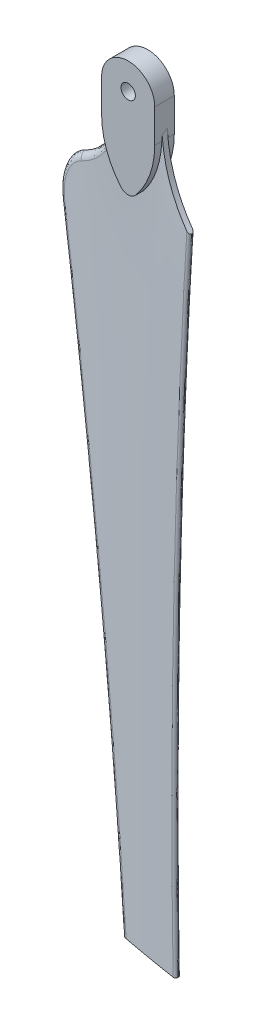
ISO-10303-21;
HEADER;
FILE_DESCRIPTION(('STEP AP214'),'2;1');
FILE_NAME('part.step','',(''),(''),'','','');
FILE_SCHEMA(('AUTOMOTIVE_DESIGN { 1 0 10303 214 1 1 1 1 }'));
ENDSEC;
DATA;
#1=APPLICATION_CONTEXT('core data for automotive mechanical design processes');
#2=APPLICATION_PROTOCOL_DEFINITION('international standard','automotive_design',2000,#1);
#3=PRODUCT_CONTEXT('',#1,'mechanical');
#4=PRODUCT('Part','Part','',(#3));
#5=PRODUCT_RELATED_PRODUCT_CATEGORY('part','',(#4));
#6=PRODUCT_DEFINITION_FORMATION('','',#4);
#7=PRODUCT_DEFINITION_CONTEXT('part definition',#1,'design');
#8=PRODUCT_DEFINITION('design','',#6,#7);
#9=PRODUCT_DEFINITION_SHAPE('','',#8);
#10=(LENGTH_UNIT() NAMED_UNIT(*) SI_UNIT(.MILLI.,.METRE.));
#11=(NAMED_UNIT(*) PLANE_ANGLE_UNIT() SI_UNIT($,.RADIAN.));
#12=(NAMED_UNIT(*) SI_UNIT($,.STERADIAN.) SOLID_ANGLE_UNIT());
#13=UNCERTAINTY_MEASURE_WITH_UNIT(LENGTH_MEASURE(1.E-05),#10,'distance_accuracy_value','');
#14=(GEOMETRIC_REPRESENTATION_CONTEXT(3) GLOBAL_UNCERTAINTY_ASSIGNED_CONTEXT((#13)) GLOBAL_UNIT_ASSIGNED_CONTEXT((#10,
#11,#12)) REPRESENTATION_CONTEXT('',''));
#15=CARTESIAN_POINT('',(0.,0.,0.));
#16=DIRECTION('',(0.,0.,1.));
#17=DIRECTION('',(1.,0.,0.));
#18=AXIS2_PLACEMENT_3D('',#15,#16,#17);
#19=CARTESIAN_POINT('',(29.26570125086,19.5050319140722,24.1919483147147));
#20=DIRECTION('',(0.,0.,-1.));
#21=DIRECTION('',(-1.,0.,0.));
#22=AXIS2_PLACEMENT_3D('',#19,#20,#21);
#23=CYLINDRICAL_SURFACE('',#22,2.625);
#24=CARTESIAN_POINT('',(29.26570125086,19.5050319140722,17.0419583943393));
#25=DIRECTION('',(0.,0.,-1.));
#26=DIRECTION('',(-1.,0.,0.));
#27=AXIS2_PLACEMENT_3D('',#24,#25,#26);
#28=CIRCLE('',#27,2.625);
#29=CARTESIAN_POINT('',(26.64070125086,19.5050319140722,17.0419583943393));
#30=VERTEX_POINT('',#29);
#31=EDGE_CURVE('E172',#30,#30,#28,.F.);
#32=ORIENTED_EDGE('',*,*,#31,.F.);
#33=EDGE_LOOP('',(#32));
#34=FACE_BOUND('',#33,.T.);
#35=CARTESIAN_POINT('',(29.26570125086,19.5050319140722,24.1919483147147));
#36=DIRECTION('',(0.,0.,-1.));
#37=DIRECTION('',(-1.,0.,0.));
#38=AXIS2_PLACEMENT_3D('',#35,#36,#37);
#39=CIRCLE('',#38,2.625);
#40=CARTESIAN_POINT('',(26.64070125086,19.5050319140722,24.1919483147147));
#41=VERTEX_POINT('',#40);
#42=EDGE_CURVE('E499',#41,#41,#39,.F.);
#43=ORIENTED_EDGE('',*,*,#42,.T.);
#44=EDGE_LOOP('',(#43));
#45=FACE_BOUND('',#44,.T.);
#46=ADVANCED_FACE('F34',(#34,#45),#23,.F.);
#47=CARTESIAN_POINT('',(8.92159818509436,7.34017432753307,24.1919483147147));
#48=DIRECTION('',(0.,0.,-1.));
#49=DIRECTION('',(-1.,0.,0.));
#50=AXIS2_PLACEMENT_3D('',#47,#48,#49);
#51=CYLINDRICAL_SURFACE('',#50,30.0493405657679);
#52=DIRECTION('',(0.,0.,-1.));
#53=VECTOR('',#52,1.);
#54=CARTESIAN_POINT('',(31.9771764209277,-11.9316491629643,24.1919483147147));
#55=LINE('',#54,#53);
#56=CARTESIAN_POINT('',(31.9771242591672,-11.9316486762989,21.1973514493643));
#57=VERTEX_POINT('',#56);
#58=CARTESIAN_POINT('',(31.9771764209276,-11.9316491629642,24.1919483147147));
#59=VERTEX_POINT('',#58);
#60=EDGE_CURVE('E193',#57,#59,#55,.F.);
#61=ORIENTED_EDGE('',*,*,#60,.F.);
#62=CARTESIAN_POINT('',(38.9709387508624,7.34017341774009,21.5933215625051));
#63=CARTESIAN_POINT('',(38.9709591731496,6.78020785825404,21.6224266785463));
#64=CARTESIAN_POINT('',(38.955287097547,6.22007536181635,21.6483022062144));
#65=CARTESIAN_POINT('',(38.8926530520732,5.10137499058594,21.6935776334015));
#66=CARTESIAN_POINT('',(38.8456952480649,4.54280691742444,21.7129783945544));
#67=CARTESIAN_POINT('',(38.72058926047,3.42902349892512,21.7452944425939));
#68=CARTESIAN_POINT('',(38.6424432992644,2.87380791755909,21.7582101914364));
#69=CARTESIAN_POINT('',(38.4579142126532,1.78453535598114,21.7773306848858));
#70=CARTESIAN_POINT('',(38.3524152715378,1.25033157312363,21.7837191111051));
#71=CARTESIAN_POINT('',(38.1125441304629,0.188401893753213,21.790487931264));
#72=CARTESIAN_POINT('',(37.9781718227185,-0.339323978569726,21.790868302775));
#73=CARTESIAN_POINT('',(37.6809640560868,-1.386686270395,21.7856744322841));
#74=CARTESIAN_POINT('',(37.518127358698,-1.90632233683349,21.7800999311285));
#75=CARTESIAN_POINT('',(37.1461178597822,-2.98941325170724,21.762131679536));
#76=CARTESIAN_POINT('',(36.9338884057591,-3.55181032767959,21.7490895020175));
#77=CARTESIAN_POINT('',(36.4761563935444,-4.66274939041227,21.7158426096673));
#78=CARTESIAN_POINT('',(36.230649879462,-5.21128972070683,21.6956370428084));
#79=CARTESIAN_POINT('',(35.7073135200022,-6.29247233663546,21.6480981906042));
#80=CARTESIAN_POINT('',(35.4294806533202,-6.82511313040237,21.6207642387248));
#81=CARTESIAN_POINT('',(34.8329234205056,-7.88975093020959,21.5578402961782));
#82=CARTESIAN_POINT('',(34.5131529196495,-8.42114779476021,21.522007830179));
#83=CARTESIAN_POINT('',(33.8416453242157,-9.46274083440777,21.4426013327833));
#84=CARTESIAN_POINT('',(33.4899080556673,-9.9729368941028,21.3990272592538));
#85=CARTESIAN_POINT('',(32.7559827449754,-10.9701708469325,21.3041616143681));
#86=CARTESIAN_POINT('',(32.3737952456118,-11.4572091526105,21.2528701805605));
#87=CARTESIAN_POINT('',(31.9771334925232,-11.931700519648,21.1977312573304));
#88=B_SPLINE_CURVE_WITH_KNOTS('',3,(#62,#63,#64,#65,#66,#67,#68,#69,#70,#71,#72,#73,#74,#75,#76,
#77,#78,#79,#80,#81,#82,#83,#84,#85,#86,#87),.UNSPECIFIED.,.F.,.F.,(4,2,2,2,2,2,2,2,2,2,2,2,4),
(0.,1.68193417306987,3.36364443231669,5.04523487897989,6.67808045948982,8.31093213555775,
9.94385487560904,11.7464628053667,13.5492852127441,15.3522762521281,17.2147080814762,
19.0771500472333,20.9395588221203),.UNSPECIFIED.);
#89=CARTESIAN_POINT('',(38.9709387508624,7.34017341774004,21.5933215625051));
#90=VERTEX_POINT('',#89);
#91=EDGE_CURVE('E511',#90,#57,#88,.T.);
#92=ORIENTED_EDGE('',*,*,#91,.F.);
#93=DIRECTION('',(0.,0.,-1.));
#94=VECTOR('',#93,1.);
#95=CARTESIAN_POINT('',(38.9709387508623,7.34017432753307,24.1919483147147));
#96=LINE('',#95,#94);
#97=CARTESIAN_POINT('',(38.9709387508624,7.34017432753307,24.1919483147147));
#98=VERTEX_POINT('',#97);
#99=EDGE_CURVE('E201',#90,#98,#96,.F.);
#100=ORIENTED_EDGE('',*,*,#99,.T.);
#101=CARTESIAN_POINT('',(8.92159818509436,7.34017432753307,24.1919483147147));
#102=DIRECTION('',(0.,0.,-1.));
#103=DIRECTION('',(-1.,0.,0.));
#104=AXIS2_PLACEMENT_3D('',#101,#102,#103);
#105=CIRCLE('',#104,30.0493405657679);
#106=EDGE_CURVE('E495',#98,#59,#105,.T.);
#107=ORIENTED_EDGE('',*,*,#106,.T.);
#108=EDGE_LOOP('',(#61,#92,#100,#107));
#109=FACE_BOUND('',#108,.T.);
#110=ADVANCED_FACE('F321',(#109),#51,.T.);
#111=CARTESIAN_POINT('',(29.26570125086,-9.66516639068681,24.1919483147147));
#112=DIRECTION('',(0.,0.,-1.));
#113=DIRECTION('',(-1.,0.,0.));
#114=AXIS2_PLACEMENT_3D('',#111,#112,#113);
#115=CYLINDRICAL_SURFACE('',#114,3.53398383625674);
#116=DIRECTION('',(0.,0.,-1.));
#117=VECTOR('',#116,1.);
#118=CARTESIAN_POINT('',(26.5542260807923,-11.9316491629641,24.1919483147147));
#119=LINE('',#118,#117);
#120=CARTESIAN_POINT('',(26.5542080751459,-11.9316508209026,20.4121769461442));
#121=VERTEX_POINT('',#120);
#122=CARTESIAN_POINT('',(26.5542260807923,-11.9316491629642,24.1919483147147));
#123=VERTEX_POINT('',#122);
#124=EDGE_CURVE('E516',#121,#123,#119,.F.);
#125=ORIENTED_EDGE('',*,*,#124,.F.);
#126=CARTESIAN_POINT('',(31.9771334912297,-11.9317005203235,21.1977312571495));
#127=CARTESIAN_POINT('',(31.9130460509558,-12.0083831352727,21.1888245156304));
#128=CARTESIAN_POINT('',(31.8457241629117,-12.08229473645,21.1794118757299));
#129=CARTESIAN_POINT('',(31.705147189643,-12.2240906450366,21.1596477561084));
#130=CARTESIAN_POINT('',(31.6318927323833,-12.2919755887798,21.1492963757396));
#131=CARTESIAN_POINT('',(31.480054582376,-12.4211795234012,21.1277374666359));
#132=CARTESIAN_POINT('',(31.401476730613,-12.4825055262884,21.1165308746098));
#133=CARTESIAN_POINT('',(31.2395256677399,-12.5982494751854,21.0933388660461));
#134=CARTESIAN_POINT('',(31.1561524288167,-12.6526673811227,21.0813534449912));
#135=CARTESIAN_POINT('',(30.8996995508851,-12.8049999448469,21.0443558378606));
#136=CARTESIAN_POINT('',(30.7201783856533,-12.8920853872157,21.018286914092));
#137=CARTESIAN_POINT('',(30.3493328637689,-13.0347745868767,20.9641594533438));
#138=CARTESIAN_POINT('',(30.1580088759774,-13.0903793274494,20.9361009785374));
#139=CARTESIAN_POINT('',(29.8656361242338,-13.1492938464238,20.8930927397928));
#140=CARTESIAN_POINT('',(29.7668581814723,-13.164862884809,20.878540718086));
#141=CARTESIAN_POINT('',(29.568363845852,-13.1875807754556,20.8492692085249));
#142=CARTESIAN_POINT('',(29.46864767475,-13.194731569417,20.8345497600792));
#143=CARTESIAN_POINT('',(29.2690070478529,-13.2005588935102,20.8050660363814));
#144=CARTESIAN_POINT('',(29.1690826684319,-13.1992381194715,20.7903017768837));
#145=CARTESIAN_POINT('',(28.9696180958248,-13.1881444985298,20.7608324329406));
#146=CARTESIAN_POINT('',(28.8700783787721,-13.1783633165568,20.7461274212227));
#147=CARTESIAN_POINT('',(28.5723197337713,-13.136260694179,20.7021694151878));
#148=CARTESIAN_POINT('',(28.3757208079,-13.0911583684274,20.6731858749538));
#149=CARTESIAN_POINT('',(27.992838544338,-12.9680878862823,20.6169745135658));
#150=CARTESIAN_POINT('',(27.8065542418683,-12.8901228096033,20.5897465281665));
#151=CARTESIAN_POINT('',(27.5391744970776,-12.7503381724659,20.5509686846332));
#152=CARTESIAN_POINT('',(27.4520844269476,-12.6999590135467,20.5383908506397));
#153=CARTESIAN_POINT('',(27.2824801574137,-12.5919330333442,20.514022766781));
#154=CARTESIAN_POINT('',(27.1999625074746,-12.5342918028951,20.5022319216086));
#155=CARTESIAN_POINT('',(27.0402098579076,-12.4122239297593,20.4795568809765));
#156=CARTESIAN_POINT('',(26.9629663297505,-12.3478086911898,20.4686712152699));
#157=CARTESIAN_POINT('',(26.8141990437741,-12.2125715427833,20.4478844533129));
#158=CARTESIAN_POINT('',(26.7426726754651,-12.1417525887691,20.437982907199));
#159=CARTESIAN_POINT('',(26.6536894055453,-12.045787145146,20.4257998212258));
#160=CARTESIAN_POINT('',(26.6333760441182,-12.0233064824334,20.4230284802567));
#161=CARTESIAN_POINT('',(26.5933485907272,-11.9778463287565,20.4175878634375));
#162=CARTESIAN_POINT('',(26.5736339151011,-11.9548673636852,20.4149184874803));
#163=CARTESIAN_POINT('',(26.554212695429,-11.9316331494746,20.4122994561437));
#164=B_SPLINE_CURVE_WITH_KNOTS('',3,(#126,#127,#128,#129,#130,#131,#132,#133,#134,#135,#136,
#137,#138,#139,#140,#141,#142,#143,#144,#145,#146,#147,#148,#149,#150,#151,#152,#153,#154,#155,
#156,#157,#158,#159,#160,#161,#162,#163),.UNSPECIFIED.,.F.,.F.,(4,2,2,2,2,2,2,2,2,2,2,2,2,2,2,2,
2,2,4),(0.,0.300897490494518,0.601763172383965,0.902303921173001,1.20284641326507,
1.80350800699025,2.40415083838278,2.70700421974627,3.00978773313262,3.3124748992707,
3.61546060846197,4.22370708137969,4.83189656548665,5.13577604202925,5.43942298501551,
5.74256667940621,6.04557115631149,6.13683990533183,6.22801661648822),.UNSPECIFIED.);
#165=EDGE_CURVE('E314',#57,#121,#164,.T.);
#166=ORIENTED_EDGE('',*,*,#165,.F.);
#167=ORIENTED_EDGE('',*,*,#60,.T.);
#168=CARTESIAN_POINT('',(29.26570125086,-9.66516639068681,24.1919483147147));
#169=DIRECTION('',(0.,0.,-1.));
#170=DIRECTION('',(-1.,0.,0.));
#171=AXIS2_PLACEMENT_3D('',#168,#169,#170);
#172=CIRCLE('',#171,3.53398383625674);
#173=EDGE_CURVE('E497',#59,#123,#172,.T.);
#174=ORIENTED_EDGE('',*,*,#173,.T.);
#175=EDGE_LOOP('',(#125,#166,#167,#174));
#176=FACE_BOUND('',#175,.T.);
#177=ADVANCED_FACE('F316',(#176),#115,.T.);
#178=CARTESIAN_POINT('',(19.5604637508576,19.5050319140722,24.1919483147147));
#179=DIRECTION('',(-1.,0.,0.));
#180=DIRECTION('',(0.,0.,1.));
#181=AXIS2_PLACEMENT_3D('',#178,#179,#180);
#182=PLANE('',#181);
#183=DIRECTION('',(0.,1.,0.));
#184=VECTOR('',#183,1.);
#185=CARTESIAN_POINT('',(19.5604637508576,7.34017432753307,24.1919483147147));
#186=LINE('',#185,#184);
#187=CARTESIAN_POINT('',(19.5604637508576,7.34017432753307,24.1919483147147));
#188=VERTEX_POINT('',#187);
#189=CARTESIAN_POINT('',(19.5604637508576,19.5050319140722,24.1919483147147));
#190=VERTEX_POINT('',#189);
#191=EDGE_CURVE('E206',#188,#190,#186,.T.);
#192=ORIENTED_EDGE('',*,*,#191,.T.);
#193=DIRECTION('',(0.,0.,-1.));
#194=VECTOR('',#193,1.);
#195=CARTESIAN_POINT('',(19.5604637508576,19.5050319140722,24.1919483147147));
#196=LINE('',#195,#194);
#197=CARTESIAN_POINT('',(19.5604637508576,19.5050319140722,17.0419583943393));
#198=VERTEX_POINT('',#197);
#199=EDGE_CURVE('E171',#198,#190,#196,.F.);
#200=ORIENTED_EDGE('',*,*,#199,.F.);
#201=DIRECTION('',(0.,1.,0.));
#202=VECTOR('',#201,1.);
#203=CARTESIAN_POINT('',(19.5604637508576,7.34017432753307,17.0419583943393));
#204=LINE('',#203,#202);
#205=CARTESIAN_POINT('',(19.5604637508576,7.34017432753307,17.0419583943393));
#206=VERTEX_POINT('',#205);
#207=EDGE_CURVE('E167',#206,#198,#204,.T.);
#208=ORIENTED_EDGE('',*,*,#207,.F.);
#209=DIRECTION('',(0.,0.,-1.));
#210=VECTOR('',#209,1.);
#211=CARTESIAN_POINT('',(19.5604637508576,7.34017432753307,24.1919483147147));
#212=LINE('',#211,#210);
#213=EDGE_CURVE('E194',#188,#206,#212,.T.);
#214=ORIENTED_EDGE('',*,*,#213,.F.);
#215=EDGE_LOOP('',(#192,#200,#208,#214));
#216=FACE_BOUND('',#215,.T.);
#217=ADVANCED_FACE('F320',(#216),#182,.T.);
#218=CARTESIAN_POINT('',(49.6098043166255,7.34017432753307,17.0419583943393));
#219=DIRECTION('',(0.,0.,-1.));
#220=DIRECTION('',(-1.,0.,0.));
#221=AXIS2_PLACEMENT_3D('',#218,#219,#220);
#222=PLANE('',#221);
#223=ORIENTED_EDGE('',*,*,#31,.T.);
#224=EDGE_LOOP('',(#223));
#225=FACE_BOUND('',#224,.T.);
#226=CARTESIAN_POINT('',(8.92159818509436,7.34017432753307,17.0419583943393));
#227=DIRECTION('',(0.,0.,-1.));
#228=DIRECTION('',(-1.,0.,0.));
#229=AXIS2_PLACEMENT_3D('',#226,#227,#228);
#230=CIRCLE('',#229,30.0493405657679);
#231=CARTESIAN_POINT('',(31.9771764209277,-11.9316491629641,17.0419583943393));
#232=VERTEX_POINT('',#231);
#233=CARTESIAN_POINT('',(38.9709387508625,7.34017432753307,17.0419583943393));
#234=VERTEX_POINT('',#233);
#235=EDGE_CURVE('E188',#232,#234,#230,.F.);
#236=ORIENTED_EDGE('',*,*,#235,.F.);
#237=CARTESIAN_POINT('',(29.26570125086,-9.66516639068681,17.0419583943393));
#238=DIRECTION('',(0.,0.,-1.));
#239=DIRECTION('',(-1.,0.,0.));
#240=AXIS2_PLACEMENT_3D('',#237,#238,#239);
#241=CIRCLE('',#240,3.53398383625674);
#242=CARTESIAN_POINT('',(26.5542260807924,-11.9316491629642,17.0419583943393));
#243=VERTEX_POINT('',#242);
#244=EDGE_CURVE('E518',#243,#232,#241,.F.);
#245=ORIENTED_EDGE('',*,*,#244,.F.);
#246=CARTESIAN_POINT('',(49.6098043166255,7.34017432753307,17.0419583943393));
#247=DIRECTION('',(0.,0.,-1.));
#248=DIRECTION('',(-1.,0.,0.));
#249=AXIS2_PLACEMENT_3D('',#246,#247,#248);
#250=CIRCLE('',#249,30.0493405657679);
#251=EDGE_CURVE('E197',#206,#243,#250,.F.);
#252=ORIENTED_EDGE('',*,*,#251,.F.);
#253=ORIENTED_EDGE('',*,*,#207,.T.);
#254=CARTESIAN_POINT('',(29.26570125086,19.5050319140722,17.0419583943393));
#255=DIRECTION('',(0.,0.,-1.));
#256=DIRECTION('',(-1.,0.,0.));
#257=AXIS2_PLACEMENT_3D('',#254,#255,#256);
#258=CIRCLE('',#257,9.70523750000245);
#259=CARTESIAN_POINT('',(38.9709387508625,19.5050319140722,17.0419583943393));
#260=VERTEX_POINT('',#259);
#261=EDGE_CURVE('E159',#260,#198,#258,.F.);
#262=ORIENTED_EDGE('',*,*,#261,.F.);
#263=DIRECTION('',(0.,1.,0.));
#264=VECTOR('',#263,1.);
#265=CARTESIAN_POINT('',(38.9709387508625,7.34017432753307,17.0419583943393));
#266=LINE('',#265,#264);
#267=EDGE_CURVE('E164',#234,#260,#266,.T.);
#268=ORIENTED_EDGE('',*,*,#267,.F.);
#269=EDGE_LOOP('',(#236,#245,#252,#253,#262,#268));
#270=FACE_BOUND('',#269,.T.);
#271=ADVANCED_FACE('F162',(#225,#270),#222,.T.);
#272=CARTESIAN_POINT('',(29.26570125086,19.5050319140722,24.1919483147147));
#273=DIRECTION('',(0.,0.,-1.));
#274=DIRECTION('',(-1.,0.,0.));
#275=AXIS2_PLACEMENT_3D('',#272,#273,#274);
#276=CYLINDRICAL_SURFACE('',#275,9.70523750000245);
#277=CARTESIAN_POINT('',(29.26570125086,19.5050319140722,24.1919483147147));
#278=DIRECTION('',(0.,0.,-1.));
#279=DIRECTION('',(-1.,0.,0.));
#280=AXIS2_PLACEMENT_3D('',#277,#278,#279);
#281=CIRCLE('',#280,9.70523750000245);
#282=CARTESIAN_POINT('',(38.9709387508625,19.5050319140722,24.1919483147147));
#283=VERTEX_POINT('',#282);
#284=EDGE_CURVE('E178',#190,#283,#281,.T.);
#285=ORIENTED_EDGE('',*,*,#284,.T.);
#286=DIRECTION('',(0.,0.,-1.));
#287=VECTOR('',#286,1.);
#288=CARTESIAN_POINT('',(38.9709387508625,19.5050319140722,24.1919483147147));
#289=LINE('',#288,#287);
#290=EDGE_CURVE('E175',#260,#283,#289,.F.);
#291=ORIENTED_EDGE('',*,*,#290,.F.);
#292=ORIENTED_EDGE('',*,*,#261,.T.);
#293=ORIENTED_EDGE('',*,*,#199,.T.);
#294=EDGE_LOOP('',(#285,#291,#292,#293));
#295=FACE_BOUND('',#294,.T.);
#296=ADVANCED_FACE('F176',(#295),#276,.T.);
#297=CARTESIAN_POINT('',(49.6098043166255,7.34017432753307,24.1919483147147));
#298=DIRECTION('',(0.,0.,-1.));
#299=DIRECTION('',(-1.,0.,0.));
#300=AXIS2_PLACEMENT_3D('',#297,#298,#299);
#301=PLANE('',#300);
#302=ORIENTED_EDGE('',*,*,#42,.F.);
#303=EDGE_LOOP('',(#302));
#304=FACE_BOUND('',#303,.T.);
#305=ORIENTED_EDGE('',*,*,#173,.F.);
#306=ORIENTED_EDGE('',*,*,#106,.F.);
#307=DIRECTION('',(0.,1.,0.));
#308=VECTOR('',#307,1.);
#309=CARTESIAN_POINT('',(38.9709387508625,7.34017432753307,24.1919483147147));
#310=LINE('',#309,#308);
#311=EDGE_CURVE('E182',#283,#98,#310,.F.);
#312=ORIENTED_EDGE('',*,*,#311,.F.);
#313=ORIENTED_EDGE('',*,*,#284,.F.);
#314=ORIENTED_EDGE('',*,*,#191,.F.);
#315=CARTESIAN_POINT('',(49.6098043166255,7.34017432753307,24.1919483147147));
#316=DIRECTION('',(0.,0.,-1.));
#317=DIRECTION('',(-1.,0.,0.));
#318=AXIS2_PLACEMENT_3D('',#315,#316,#317);
#319=CIRCLE('',#318,30.0493405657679);
#320=EDGE_CURVE('E198',#123,#188,#319,.T.);
#321=ORIENTED_EDGE('',*,*,#320,.F.);
#322=EDGE_LOOP('',(#305,#306,#312,#313,#314,#321));
#323=FACE_BOUND('',#322,.T.);
#324=ADVANCED_FACE('F254',(#304,#323),#301,.F.);
#325=CARTESIAN_POINT('',(50.7080476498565,10.6091805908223,24.1047252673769));
#326=CARTESIAN_POINT('',(50.8705564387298,5.09224871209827,24.1920009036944));
#327=CARTESIAN_POINT('',(50.9773269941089,-0.417275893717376,24.2463648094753));
#328=CARTESIAN_POINT('',(51.0553060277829,-5.92333822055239,24.2850494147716));
#329=CARTESIAN_POINT('',(51.1332850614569,-11.4294005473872,24.323734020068));
#330=CARTESIAN_POINT('',(51.1818566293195,-16.9319075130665,24.3464604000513));
#331=CARTESIAN_POINT('',(51.2160999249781,-22.432829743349,24.3623174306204));
#332=CARTESIAN_POINT('',(51.2845865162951,-33.434674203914,24.3940314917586));
#333=CARTESIAN_POINT('',(51.2995670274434,-44.4305619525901,24.4000857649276));
#334=CARTESIAN_POINT('',(51.3092931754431,-55.4259342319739,24.4043471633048));
#335=CARTESIAN_POINT('',(51.3287454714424,-77.4166787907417,24.412869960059));
#336=CARTESIAN_POINT('',(51.3217021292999,-99.4045440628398,24.4097612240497));
#337=CARTESIAN_POINT('',(51.321802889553,-121.3931774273,24.4098049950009));
#338=CARTESIAN_POINT('',(51.3220044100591,-165.37044415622,24.4098925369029));
#339=CARTESIAN_POINT('',(51.3218460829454,-209.347668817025,24.4098237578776));
#340=CARTESIAN_POINT('',(51.3218460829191,-253.324911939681,24.4098237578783));
#341=CARTESIAN_POINT('',(46.9430225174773,10.8186033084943,22.9391313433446));
#342=CARTESIAN_POINT('',(47.5198017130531,5.24310956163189,23.2691746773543));
#343=CARTESIAN_POINT('',(47.875646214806,-0.303135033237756,23.4700133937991));
#344=CARTESIAN_POINT('',(48.1292973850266,-5.83562595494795,23.6127114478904));
#345=CARTESIAN_POINT('',(48.3829485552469,-11.3681168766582,23.7554095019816));
#346=CARTESIAN_POINT('',(48.532008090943,-16.8865002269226,23.8384869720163));
#347=CARTESIAN_POINT('',(48.636238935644,-22.3985910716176,23.8965852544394));
#348=CARTESIAN_POINT('',(48.8447006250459,-33.4227727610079,24.0127818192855));
#349=CARTESIAN_POINT('',(48.8850587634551,-44.4233208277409,24.0350015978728));
#350=CARTESIAN_POINT('',(48.9132447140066,-55.4218363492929,24.0506468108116));
#351=CARTESIAN_POINT('',(48.9696166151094,-77.4188673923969,24.0819372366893));
#352=CARTESIAN_POINT('',(48.9490799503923,-99.4044937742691,24.0705335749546));
#353=CARTESIAN_POINT('',(48.9493701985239,-121.393162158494,24.070694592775));
#354=CARTESIAN_POINT('',(48.9499506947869,-165.370498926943,24.0710166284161));
#355=CARTESIAN_POINT('',(48.9494946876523,-209.347668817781,24.0707636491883));
#356=CARTESIAN_POINT('',(48.9494946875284,-253.324911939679,24.0707636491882));
#357=CARTESIAN_POINT('',(44.3155991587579,10.8542727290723,22.2765305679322));
#358=CARTESIAN_POINT('',(44.9747492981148,5.26870527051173,22.6970732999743));
#359=CARTESIAN_POINT('',(45.375704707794,-0.284271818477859,22.9522736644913));
#360=CARTESIAN_POINT('',(45.6609749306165,-5.82135644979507,23.1337987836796));
#361=CARTESIAN_POINT('',(45.9462451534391,-11.3584410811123,23.315323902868));
#362=CARTESIAN_POINT('',(46.1126678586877,-16.8794228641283,23.4210755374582));
#363=CARTESIAN_POINT('',(46.2291273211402,-22.3933039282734,23.4950511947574));
#364=CARTESIAN_POINT('',(46.462046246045,-33.4210660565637,23.6430025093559));
#365=CARTESIAN_POINT('',(46.5069599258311,-44.4222264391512,23.6713465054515));
#366=CARTESIAN_POINT('',(46.538503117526,-55.4212143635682,23.6912742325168));
#367=CARTESIAN_POINT('',(46.6015895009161,-77.4191902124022,23.7311296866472));
#368=CARTESIAN_POINT('',(46.5787730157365,-99.4044856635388,23.716594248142));
#369=CARTESIAN_POINT('',(46.5791137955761,-121.393159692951,23.7167982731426));
#370=CARTESIAN_POINT('',(46.5797953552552,-165.370507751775,23.7172063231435));
#371=CARTESIAN_POINT('',(46.5792628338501,-209.34766881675,23.7168855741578));
#372=CARTESIAN_POINT('',(46.5792628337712,-253.324911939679,23.7168855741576));
#373=CARTESIAN_POINT('',(42.0522530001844,10.8448659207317,21.8547274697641));
#374=CARTESIAN_POINT('',(42.6856833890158,5.26019508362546,22.2907949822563));
#375=CARTESIAN_POINT('',(43.0694655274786,-0.291129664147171,22.554200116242));
#376=CARTESIAN_POINT('',(43.3420850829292,-5.82690732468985,22.7416297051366));
#377=CARTESIAN_POINT('',(43.6147046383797,-11.3626849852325,22.9290592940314));
#378=CARTESIAN_POINT('',(43.7729980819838,-16.8826121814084,23.0381951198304));
#379=CARTESIAN_POINT('',(43.8834854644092,-22.3957404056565,23.1147400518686));
#380=CARTESIAN_POINT('',(44.1044602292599,-33.4219968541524,23.2678299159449));
#381=CARTESIAN_POINT('',(44.1455987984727,-44.4227142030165,23.2981095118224));
#382=CARTESIAN_POINT('',(44.1746828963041,-55.4214678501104,23.3194973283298));
#383=CARTESIAN_POINT('',(44.232851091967,-77.4189751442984,23.3622729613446));
#384=CARTESIAN_POINT('',(44.2109905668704,-99.4044776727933,23.3477447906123));
#385=CARTESIAN_POINT('',(44.2112364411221,-121.393155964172,23.3480679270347));
#386=CARTESIAN_POINT('',(44.2117281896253,-165.370512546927,23.3487141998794));
#387=CARTESIAN_POINT('',(44.2113333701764,-209.347668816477,23.3482254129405));
#388=CARTESIAN_POINT('',(44.2113333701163,-253.324911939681,23.3482254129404));
#389=CARTESIAN_POINT('',(39.7889068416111,10.8354591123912,21.4329243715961));
#390=CARTESIAN_POINT('',(40.396617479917,5.25168489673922,21.8845166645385));
#391=CARTESIAN_POINT('',(40.7632263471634,-0.297987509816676,22.1561265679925));
#392=CARTESIAN_POINT('',(41.023195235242,-5.83245819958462,22.3494606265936));
#393=CARTESIAN_POINT('',(41.2831641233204,-11.3669288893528,22.5427946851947));
#394=CARTESIAN_POINT('',(41.4333283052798,-16.8858014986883,22.6553147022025));
#395=CARTESIAN_POINT('',(41.5378436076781,-22.3981768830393,22.7344289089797));
#396=CARTESIAN_POINT('',(41.7468742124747,-33.4229276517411,22.8926573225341));
#397=CARTESIAN_POINT('',(41.7842376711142,-44.4232019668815,22.9248725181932));
#398=CARTESIAN_POINT('',(41.8108626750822,-55.4217213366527,22.9477204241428));
#399=CARTESIAN_POINT('',(41.864112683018,-77.4187600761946,22.993416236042));
#400=CARTESIAN_POINT('',(41.8432081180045,-99.4044696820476,22.9788953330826));
#401=CARTESIAN_POINT('',(41.8433590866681,-121.393152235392,22.9793375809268));
#402=CARTESIAN_POINT('',(41.8436610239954,-165.370517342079,22.9802220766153));
#403=CARTESIAN_POINT('',(41.8434039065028,-209.347668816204,22.9795652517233));
#404=CARTESIAN_POINT('',(41.8434039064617,-253.324911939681,22.9795652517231));
#405=CARTESIAN_POINT('',(37.9249209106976,10.7769245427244,21.2580766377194));
#406=CARTESIAN_POINT('',(38.3891169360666,5.20697219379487,21.6492694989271));
#407=CARTESIAN_POINT('',(38.6709960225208,-0.332057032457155,21.8813532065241));
#408=CARTESIAN_POINT('',(38.8697099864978,-5.85892482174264,22.0466791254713));
#409=CARTESIAN_POINT('',(39.068423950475,-11.3857926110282,22.2120050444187));
#410=CARTESIAN_POINT('',(39.1821497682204,-16.8998075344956,22.3080160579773));
#411=CARTESIAN_POINT('',(39.2604967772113,-22.4087589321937,22.3760095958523));
#412=CARTESIAN_POINT('',(39.4171907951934,-33.4266617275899,22.5119966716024));
#413=CARTESIAN_POINT('',(39.4414291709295,-44.4253658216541,22.5419383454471));
#414=CARTESIAN_POINT('',(39.4590806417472,-55.4229013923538,22.5634125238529));
#415=CARTESIAN_POINT('',(39.4943835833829,-77.4179725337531,22.6063608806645));
#416=CARTESIAN_POINT('',(39.4779880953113,-99.4044610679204,22.5951167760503));
#417=CARTESIAN_POINT('',(39.4778742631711,-121.393146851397,22.5957659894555));
#418=CARTESIAN_POINT('',(39.4776465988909,-165.370518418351,22.597064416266));
#419=CARTESIAN_POINT('',(39.4777768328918,-209.347668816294,22.596123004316));
#420=CARTESIAN_POINT('',(39.4777768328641,-253.324911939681,22.596123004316));
#421=CARTESIAN_POINT('',(36.1680148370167,10.7346115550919,21.1862033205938));
#422=CARTESIAN_POINT('',(36.4612652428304,5.17557050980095,21.4838302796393));
#423=CARTESIAN_POINT('',(36.6423235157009,-0.356140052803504,21.6540468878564));
#424=CARTESIAN_POINT('',(36.7675609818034,-5.87764666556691,21.7757623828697));
#425=CARTESIAN_POINT('',(36.8927984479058,-11.3991532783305,21.8974778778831));
#426=CARTESIAN_POINT('',(36.9622945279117,-16.9097722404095,21.9677827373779));
#427=CARTESIAN_POINT('',(37.0086618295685,-22.416299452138,22.0183926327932));
#428=CARTESIAN_POINT('',(37.1013964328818,-33.429353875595,22.1196124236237));
#429=CARTESIAN_POINT('',(37.1085122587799,-44.4268753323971,22.1456455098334));
#430=CARTESIAN_POINT('',(37.1145378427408,-55.4236975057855,22.1646886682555));
#431=CARTESIAN_POINT('',(37.1265890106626,-77.4173418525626,22.2027749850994));
#432=CARTESIAN_POINT('',(37.1154578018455,-99.4044387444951,22.1964679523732));
#433=CARTESIAN_POINT('',(37.1149484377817,-121.393136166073,22.1973998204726));
#434=CARTESIAN_POINT('',(37.1139297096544,-165.370531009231,22.1992635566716));
#435=CARTESIAN_POINT('',(37.1146349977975,-209.347668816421,22.1979345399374));
#436=CARTESIAN_POINT('',(37.1146349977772,-253.324911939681,22.1979345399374));
#437=CARTESIAN_POINT('',(32.6542026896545,10.649985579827,21.0424566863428));
#438=CARTESIAN_POINT('',(32.6055618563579,5.11276714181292,21.1529518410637));
#439=CARTESIAN_POINT('',(32.5849785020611,-0.404306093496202,21.1994342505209));
#440=CARTESIAN_POINT('',(32.5632629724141,-5.91509035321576,21.2339288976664));
#441=CARTESIAN_POINT('',(32.5415474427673,-11.4258746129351,21.2684235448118));
#442=CARTESIAN_POINT('',(32.5225840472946,-16.9297016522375,21.287316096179));
#443=CARTESIAN_POINT('',(32.5049919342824,-22.4313804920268,21.3031587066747));
#444=CARTESIAN_POINT('',(32.4698077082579,-33.4347381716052,21.3348439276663));
#445=CARTESIAN_POINT('',(32.4426784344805,-44.4298943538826,21.3530598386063));
#446=CARTESIAN_POINT('',(32.4254522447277,-55.425289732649,21.3672409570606));
#447=CARTESIAN_POINT('',(32.3909998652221,-77.4160804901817,21.3956031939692));
#448=CARTESIAN_POINT('',(32.3903972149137,-99.4043940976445,21.3991703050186));
#449=CARTESIAN_POINT('',(32.3890967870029,-121.393114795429,21.4006674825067));
#450=CARTESIAN_POINT('',(32.386495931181,-165.370556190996,21.4036618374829));
#451=CARTESIAN_POINT('',(32.3883513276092,-209.347668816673,21.4015576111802));
#452=CARTESIAN_POINT('',(32.3883513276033,-253.324911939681,21.4015576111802));
#453=CARTESIAN_POINT('',(29.5866687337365,10.6814019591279,21.3373923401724));
#454=CARTESIAN_POINT('',(29.0956528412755,5.1387697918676,21.112793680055));
#455=CARTESIAN_POINT('',(28.7990478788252,-0.385919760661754,20.9459163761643));
#456=CARTESIAN_POINT('',(28.5770086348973,-5.90132710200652,20.8288598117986));
#457=CARTESIAN_POINT('',(28.3549693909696,-11.4167344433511,20.7118032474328));
#458=CARTESIAN_POINT('',(28.2131311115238,-16.9232614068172,20.6416868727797));
#459=CARTESIAN_POINT('',(28.1063940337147,-22.4266516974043,20.5969117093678));
#460=CARTESIAN_POINT('',(27.8929198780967,-33.4334322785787,20.5073613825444));
#461=CARTESIAN_POINT('',(27.8156429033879,-44.4287565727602,20.5100916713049));
#462=CARTESIAN_POINT('',(27.7645950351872,-55.4244947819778,20.5143054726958));
#463=CARTESIAN_POINT('',(27.6624992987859,-77.4159712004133,20.5227330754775));
#464=CARTESIAN_POINT('',(27.6760169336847,-99.4042929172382,20.5425461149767));
#465=CARTESIAN_POINT('',(27.6734520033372,-121.393072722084,20.5448144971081));
#466=CARTESIAN_POINT('',(27.668322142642,-165.370632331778,20.5493512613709));
#467=CARTESIAN_POINT('',(27.6720086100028,-209.347668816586,20.5461958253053));
#468=CARTESIAN_POINT('',(27.6720086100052,-253.324911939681,20.5461958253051));
#469=CARTESIAN_POINT('',(25.7050194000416,10.8247435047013,21.1131205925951));
#470=CARTESIAN_POINT('',(24.988091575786,5.23780529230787,20.6851256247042));
#471=CARTESIAN_POINT('',(24.5467173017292,-0.312049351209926,20.3962655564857));
#472=CARTESIAN_POINT('',(24.2215086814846,-5.84538245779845,20.1919850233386));
#473=CARTESIAN_POINT('',(23.8963000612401,-11.3787155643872,19.9877044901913));
#474=CARTESIAN_POINT('',(23.692632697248,-16.8953833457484,19.8667649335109));
#475=CARTESIAN_POINT('',(23.5421476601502,-22.405839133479,19.7865434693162));
#476=CARTESIAN_POINT('',(23.2411775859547,-33.4267507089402,19.6261005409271));
#477=CARTESIAN_POINT('',(23.1441682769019,-44.4245573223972,19.6158399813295));
#478=CARTESIAN_POINT('',(23.0795083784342,-55.4221264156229,19.6110119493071));
#479=CARTESIAN_POINT('',(22.9501885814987,-77.4172646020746,19.601355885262));
#480=CARTESIAN_POINT('',(22.9715765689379,-99.404256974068,19.6285018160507));
#481=CARTESIAN_POINT('',(22.9686855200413,-121.393060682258,19.6307499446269));
#482=CARTESIAN_POINT('',(22.9629034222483,-165.370668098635,19.6352462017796));
#483=CARTESIAN_POINT('',(22.9670696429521,-209.347668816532,19.6321360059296));
#484=CARTESIAN_POINT('',(22.967069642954,-253.324911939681,19.6321360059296));
#485=CARTESIAN_POINT('',(23.7641947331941,10.8964142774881,21.0009847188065));
#486=CARTESIAN_POINT('',(22.9343109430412,5.28732304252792,20.471291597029));
#487=CARTESIAN_POINT('',(22.4205520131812,-0.275114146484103,20.1214401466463));
#488=CARTESIAN_POINT('',(22.0437587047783,-5.81741013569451,19.8735476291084));
#489=CARTESIAN_POINT('',(21.6669653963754,-11.3597061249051,19.6256551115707));
#490=CARTESIAN_POINT('',(21.4323834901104,-16.881444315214,19.4793039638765));
#491=CARTESIAN_POINT('',(21.2600244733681,-22.3954328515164,19.3813593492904));
#492=CARTESIAN_POINT('',(20.9153064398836,-33.4234099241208,19.1854701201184));
#493=CARTESIAN_POINT('',(20.8084309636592,-44.4224576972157,19.1687141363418));
#494=CARTESIAN_POINT('',(20.7369650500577,-55.4209422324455,19.1593651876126));
#495=CARTESIAN_POINT('',(20.5940332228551,-77.4179113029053,19.1406672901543));
#496=CARTESIAN_POINT('',(20.6193563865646,-99.4042390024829,19.1714796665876));
#497=CARTESIAN_POINT('',(20.6163022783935,-121.393054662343,19.1737176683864));
#498=CARTESIAN_POINT('',(20.6101940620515,-165.370685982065,19.1781936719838));
#499=CARTESIAN_POINT('',(20.6146001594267,-209.347668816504,19.1751060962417));
#500=CARTESIAN_POINT('',(20.6146001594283,-253.324911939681,19.1751060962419));
#501=CARTESIAN_POINT('',(21.6234834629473,10.9795433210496,20.7524426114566));
#502=CARTESIAN_POINT('',(20.7304935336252,5.34448017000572,20.157158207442));
#503=CARTESIAN_POINT('',(20.1775296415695,-0.23238343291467,19.7695814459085));
#504=CARTESIAN_POINT('',(19.7734035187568,-5.78500189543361,19.4947344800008));
#505=CARTESIAN_POINT('',(19.3692773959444,-11.3376203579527,19.2198875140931));
#506=CARTESIAN_POINT('',(19.1192697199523,-16.865205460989,19.0579510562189));
#507=CARTESIAN_POINT('',(18.9364918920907,-22.3832970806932,18.9488143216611));
#508=CARTESIAN_POINT('',(18.5709362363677,-33.4194803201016,18.7305408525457));
#509=CARTESIAN_POINT('',(18.4617698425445,-44.4200582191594,18.7081546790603));
#510=CARTESIAN_POINT('',(18.3885098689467,-55.4196242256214,18.6947008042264));
#511=CARTESIAN_POINT('',(18.2419899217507,-77.4187562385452,18.6677930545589));
#512=CARTESIAN_POINT('',(18.2696321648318,-99.4042389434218,18.7000740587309));
#513=CARTESIAN_POINT('',(18.2666426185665,-121.393056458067,18.7021219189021));
#514=CARTESIAN_POINT('',(18.2606635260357,-165.370691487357,18.7062176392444));
#515=CARTESIAN_POINT('',(18.2649816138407,-209.347668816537,18.7034016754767));
#516=CARTESIAN_POINT('',(18.2649816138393,-253.324911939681,18.7034016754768));
#517=CARTESIAN_POINT('',(19.2223824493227,11.0229859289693,20.3003334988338));
#518=CARTESIAN_POINT('',(18.3354136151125,5.37493245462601,19.6946674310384));
#519=CARTESIAN_POINT('',(17.7875820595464,-0.209450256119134,19.3040936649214));
#520=CARTESIAN_POINT('',(17.3883580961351,-5.76748188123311,19.0269817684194));
#521=CARTESIAN_POINT('',(16.9891341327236,-11.3255135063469,18.7498698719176));
#522=CARTESIAN_POINT('',(16.7436732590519,-16.8562653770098,18.5868233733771));
#523=CARTESIAN_POINT('',(16.5649224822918,-22.3766001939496,18.4763984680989));
#524=CARTESIAN_POINT('',(16.2074209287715,-33.4172698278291,18.2555486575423));
#525=CARTESIAN_POINT('',(16.1039949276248,-44.4187883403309,18.2302721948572));
#526=CARTESIAN_POINT('',(16.0343322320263,-55.4189638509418,18.2145112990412));
#527=CARTESIAN_POINT('',(15.8950068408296,-77.4193148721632,18.1829895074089));
#528=CARTESIAN_POINT('',(15.9226384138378,-99.4042595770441,18.2141967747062));
#529=CARTESIAN_POINT('',(15.9199089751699,-121.3930661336,18.2159530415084));
#530=CARTESIAN_POINT('',(15.9144500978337,-165.370679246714,18.2194655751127));
#531=CARTESIAN_POINT('',(15.9183968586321,-209.347668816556,18.2170585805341));
#532=CARTESIAN_POINT('',(15.9183968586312,-253.324911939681,18.2170585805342));
#533=CARTESIAN_POINT('',(16.8212814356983,11.0664285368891,19.8482243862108));
#534=CARTESIAN_POINT('',(15.9403336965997,5.40538473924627,19.232176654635));
#535=CARTESIAN_POINT('',(15.3976344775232,-0.186517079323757,18.8386058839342));
#536=CARTESIAN_POINT('',(15.003312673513,-5.74996186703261,18.5592290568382));
#537=CARTESIAN_POINT('',(14.6089908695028,-11.3134066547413,18.2798522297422));
#538=CARTESIAN_POINT('',(14.3680767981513,-16.8473252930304,18.1156956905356));
#539=CARTESIAN_POINT('',(14.1933530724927,-22.3699033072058,18.0039826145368));
#540=CARTESIAN_POINT('',(13.843905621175,-33.4150593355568,17.7805564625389));
#541=CARTESIAN_POINT('',(13.7462200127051,-44.4175184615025,17.7523897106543));
#542=CARTESIAN_POINT('',(13.6801545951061,-55.4183034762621,17.7343217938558));
#543=CARTESIAN_POINT('',(13.5480237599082,-77.4198735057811,17.6981859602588));
#544=CARTESIAN_POINT('',(13.5756446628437,-99.4042802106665,17.7283194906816));
#545=CARTESIAN_POINT('',(13.5731753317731,-121.393075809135,17.7297841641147));
#546=CARTESIAN_POINT('',(13.5682366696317,-165.370667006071,17.732713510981));
#547=CARTESIAN_POINT('',(13.5718121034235,-209.347668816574,17.7307154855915));
#548=CARTESIAN_POINT('',(13.5718121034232,-253.324911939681,17.7307154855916));
#549=CARTESIAN_POINT('',(14.1539440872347,11.066046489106,19.1883315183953));
#550=CARTESIAN_POINT('',(13.3509315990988,5.40616217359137,18.6181870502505));
#551=CARTESIAN_POINT('',(12.8587275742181,-0.185533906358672,18.2570226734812));
#552=CARTESIAN_POINT('',(12.502272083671,-5.74894984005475,18.0005473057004));
#553=CARTESIAN_POINT('',(12.1458165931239,-11.3123657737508,17.7440719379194));
#554=CARTESIAN_POINT('',(11.9297250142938,-16.8464771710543,17.5935647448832));
#555=CARTESIAN_POINT('',(11.773662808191,-22.3692348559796,17.4906823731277));
#556=CARTESIAN_POINT('',(11.4615383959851,-33.4147502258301,17.2849176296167));
#557=CARTESIAN_POINT('',(11.3775345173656,-44.417491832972,17.2567704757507));
#558=CARTESIAN_POINT('',(11.3204156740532,-55.4183625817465,17.2383229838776));
#559=CARTESIAN_POINT('',(11.2061779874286,-77.4201040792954,17.2014280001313));
#560=CARTESIAN_POINT('',(11.2313948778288,-99.4043212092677,17.2279526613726));
#561=CARTESIAN_POINT('',(11.2293727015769,-121.393093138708,17.2290355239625));
#562=CARTESIAN_POINT('',(11.2253283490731,-165.370636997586,17.2312012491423));
#563=CARTESIAN_POINT('',(11.2282611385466,-209.34766881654,17.2297337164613));
#564=CARTESIAN_POINT('',(11.228261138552,-253.324911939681,17.2297337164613));
#565=CARTESIAN_POINT('',(11.3369888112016,11.0115449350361,18.3855782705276));
#566=CARTESIAN_POINT('',(10.6586136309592,5.36920409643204,17.8987461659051));
#567=CARTESIAN_POINT('',(10.2444297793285,-0.212626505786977,17.5921976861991));
#568=CARTESIAN_POINT('',(9.94521719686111,-5.76921437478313,17.3744479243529));
#569=CARTESIAN_POINT('',(9.64600461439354,-11.3258022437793,17.1566981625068));
#570=CARTESIAN_POINT('',(9.46567758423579,-16.8562509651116,17.0290386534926));
#571=CARTESIAN_POINT('',(9.33583819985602,-22.3764983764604,16.9415081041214));
#572=CARTESIAN_POINT('',(9.07615943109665,-33.4169931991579,16.7664470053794));
#573=CARTESIAN_POINT('',(9.00823359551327,-44.4190470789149,16.7412292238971));
#574=CARTESIAN_POINT('',(8.96184337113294,-55.4193005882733,16.7244925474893));
#575=CARTESIAN_POINT('',(8.86906292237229,-77.4198076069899,16.6910191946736));
#576=CARTESIAN_POINT('',(8.89036178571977,-99.404367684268,16.7128790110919));
#577=CARTESIAN_POINT('',(8.88878850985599,-121.393111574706,16.713647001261));
#578=CARTESIAN_POINT('',(8.88564195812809,-165.370599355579,16.715182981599));
#579=CARTESIAN_POINT('',(8.88792681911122,-209.347668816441,16.7141490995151));
#580=CARTESIAN_POINT('',(8.88792681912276,-253.324911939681,16.7141490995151));
#581=CARTESIAN_POINT('',(8.52003353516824,10.9570433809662,17.5828250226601));
#582=CARTESIAN_POINT('',(7.96629566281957,5.33224601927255,17.1793052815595));
#583=CARTESIAN_POINT('',(7.63013198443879,-0.23971910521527,16.9273726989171));
#584=CARTESIAN_POINT('',(7.38816231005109,-5.7894789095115,16.7483485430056));
#585=CARTESIAN_POINT('',(7.14619263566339,-11.3392387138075,16.5693243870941));
#586=CARTESIAN_POINT('',(7.00163015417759,-16.8660247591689,16.4645125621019));
#587=CARTESIAN_POINT('',(6.89801359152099,-22.3837618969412,16.3923338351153));
#588=CARTESIAN_POINT('',(6.69078046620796,-33.4192361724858,16.2479763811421));
#589=CARTESIAN_POINT('',(6.63893267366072,-44.4206023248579,16.2256879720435));
#590=CARTESIAN_POINT('',(6.60327106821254,-55.4202385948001,16.2106621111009));
#591=CARTESIAN_POINT('',(6.53194785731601,-77.4195111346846,16.1806103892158));
#592=CARTESIAN_POINT('',(6.54932869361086,-99.4044141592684,16.1978053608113));
#593=CARTESIAN_POINT('',(6.54820431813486,-121.393130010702,16.1982584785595));
#594=CARTESIAN_POINT('',(6.54595556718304,-165.370561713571,16.1991647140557));
#595=CARTESIAN_POINT('',(6.54759249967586,-209.347668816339,16.198564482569));
#596=CARTESIAN_POINT('',(6.54759249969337,-253.324911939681,16.198564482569));
#597=CARTESIAN_POINT('',(5.56323487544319,10.8492046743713,16.6430562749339));
#598=CARTESIAN_POINT('',(5.17857343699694,5.257947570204,16.3586652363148));
#599=CARTESIAN_POINT('',(4.94657721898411,-0.294645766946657,16.1823720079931));
#600=CARTESIAN_POINT('',(4.78011952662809,-5.83086748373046,16.0570585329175));
#601=CARTESIAN_POINT('',(4.61366183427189,-11.3670892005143,15.931745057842));
#602=CARTESIAN_POINT('',(4.51502869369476,-16.8863802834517,15.8584695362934));
#603=CARTESIAN_POINT('',(4.44459924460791,-22.3989316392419,15.8078313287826));
#604=CARTESIAN_POINT('',(4.30374034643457,-33.4240343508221,15.7065549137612));
#605=CARTESIAN_POINT('',(4.26988039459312,-44.4237320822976,15.6900843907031));
#606=CARTESIAN_POINT('',(4.24642384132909,-55.4220487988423,15.6788582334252));
#607=CARTESIAN_POINT('',(4.19951073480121,-77.4186822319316,15.6564059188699));
#608=CARTESIAN_POINT('',(4.21153690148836,-99.4044646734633,15.668005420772));
#609=CARTESIAN_POINT('',(4.21084744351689,-121.393148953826,15.6682226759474));
#610=CARTESIAN_POINT('',(4.20946852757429,-165.370517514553,15.6686571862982));
#611=CARTESIAN_POINT('',(4.21047482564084,-209.347668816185,15.668377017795));
#612=CARTESIAN_POINT('',(4.21047482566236,-253.324911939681,15.6683770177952));
#613=CARTESIAN_POINT('',(2.74571739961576,10.748734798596,15.7632554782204));
#614=CARTESIAN_POINT('',(2.49678062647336,5.18817461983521,15.5765488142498));
#615=CARTESIAN_POINT('',(2.34729924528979,-0.346450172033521,15.4612588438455));
#616=CARTESIAN_POINT('',(2.24021394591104,-5.87004458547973,15.3792914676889));
#617=CARTESIAN_POINT('',(2.13312864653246,-11.3936389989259,15.2973240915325));
#618=CARTESIAN_POINT('',(2.06996604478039,-16.9058283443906,15.2494248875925));
#619=CARTESIAN_POINT('',(2.02495542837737,-22.4134479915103,15.2162580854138));
#620=CARTESIAN_POINT('',(1.93493419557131,-33.4286872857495,15.1499244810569));
#621=CARTESIAN_POINT('',(1.91377939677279,-44.4267019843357,15.1388282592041));
#622=CARTESIAN_POINT('',(1.89906408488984,-55.4237444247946,15.1312227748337));
#623=CARTESIAN_POINT('',(1.86963346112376,-77.4178293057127,15.1160118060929));
#624=CARTESIAN_POINT('',(1.87739398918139,-99.404500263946,15.1234384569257));
#625=CARTESIAN_POINT('',(1.87697962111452,-121.393161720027,15.1235436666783));
#626=CARTESIAN_POINT('',(1.87615088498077,-165.370484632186,15.1237540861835));
#627=CARTESIAN_POINT('',(1.87675665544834,-209.347668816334,15.1236225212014));
#628=CARTESIAN_POINT('',(1.87675665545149,-253.324911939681,15.1236225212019));
#629=CARTESIAN_POINT('',(-0.0718000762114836,10.6482649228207,14.8834546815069));
#630=CARTESIAN_POINT('',(-0.185012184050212,5.11840166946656,14.7944323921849));
#631=CARTESIAN_POINT('',(-0.251978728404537,-0.398254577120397,14.7401456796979));
#632=CARTESIAN_POINT('',(-0.299691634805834,-5.909221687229,14.7015244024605));
#633=CARTESIAN_POINT('',(-0.347404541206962,-11.4201887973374,14.6629031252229));
#634=CARTESIAN_POINT('',(-0.375096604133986,-16.9252764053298,14.6403802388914));
#635=CARTESIAN_POINT('',(-0.394688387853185,-22.4279643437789,14.624684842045));
#636=CARTESIAN_POINT('',(-0.433871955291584,-33.4333402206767,14.5932940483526));
#637=CARTESIAN_POINT('',(-0.442321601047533,-44.4296718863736,14.5875721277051));
#638=CARTESIAN_POINT('',(-0.448295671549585,-55.4254400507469,14.583587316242));
#639=CARTESIAN_POINT('',(-0.460243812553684,-77.4169763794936,14.5756176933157));
#640=CARTESIAN_POINT('',(-0.456748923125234,-99.4045358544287,14.5788714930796));
#641=CARTESIAN_POINT('',(-0.456888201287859,-121.393174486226,14.5788646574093));
#642=CARTESIAN_POINT('',(-0.457166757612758,-165.37045174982,14.5788509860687));
#643=CARTESIAN_POINT('',(-0.45696151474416,-209.347668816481,14.5788680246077));
#644=CARTESIAN_POINT('',(-0.456961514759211,-253.324911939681,14.5788680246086));
#645=CARTESIAN_POINT('',(-2.70575272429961,10.5675127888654,14.0946791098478));
#646=CARTESIAN_POINT('',(-2.72977495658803,5.06178629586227,14.0727496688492));
#647=CARTESIAN_POINT('',(-2.74391034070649,-0.44051548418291,14.0593846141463));
#648=CARTESIAN_POINT('',(-2.75399683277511,-5.9413210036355,14.0498756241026));
#649=CARTESIAN_POINT('',(-2.76408332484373,-11.4421265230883,14.0403666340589));
#650=CARTESIAN_POINT('',(-2.76993756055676,-16.9413887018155,14.0348199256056));
#651=CARTESIAN_POINT('',(-2.77408160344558,-22.4400142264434,14.030949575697));
#652=CARTESIAN_POINT('',(-2.78236968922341,-33.4372652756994,14.0232088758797));
#653=CARTESIAN_POINT('',(-2.78416390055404,-44.4321191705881,14.0217721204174));
#654=CARTESIAN_POINT('',(-2.78543240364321,-55.4268186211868,14.0207690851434));
#655=CARTESIAN_POINT('',(-2.78796940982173,-77.4162175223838,14.0187630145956));
#656=CARTESIAN_POINT('',(-2.78723387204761,-99.4045547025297,14.0195520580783));
#657=CARTESIAN_POINT('',(-2.78726416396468,-121.393180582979,14.0195474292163));
#658=CARTESIAN_POINT('',(-2.78732474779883,-165.370432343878,14.0195381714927));
#659=CARTESIAN_POINT('',(-2.78728018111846,-209.347668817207,14.0195464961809));
#660=CARTESIAN_POINT('',(-2.78728018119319,-253.324911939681,14.0195464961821));
#661=CARTESIAN_POINT('',(-5.09482000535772,10.5468602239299,13.4661370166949));
#662=CARTESIAN_POINT('',(-5.10048571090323,5.04725009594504,13.4601717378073));
#663=CARTESIAN_POINT('',(-5.1038075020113,-0.451382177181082,13.4565394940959));
#664=CARTESIAN_POINT('',(-5.10617843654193,-5.94958546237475,13.4539550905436));
#665=CARTESIAN_POINT('',(-5.10854937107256,-11.4477887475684,13.4513706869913));
#666=CARTESIAN_POINT('',(-5.10992430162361,-16.9455498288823,13.4498632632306));
#667=CARTESIAN_POINT('',(-5.11089845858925,-22.4431279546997,13.4488106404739));
#668=CARTESIAN_POINT('',(-5.11284677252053,-33.4382842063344,13.4467053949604));
#669=CARTESIAN_POINT('',(-5.11327210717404,-44.4327517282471,13.4463108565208));
#670=CARTESIAN_POINT('',(-5.11357331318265,-55.4271743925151,13.4460350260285));
#671=CARTESIAN_POINT('',(-5.11417572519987,-77.4160197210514,13.4454833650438));
#672=CARTESIAN_POINT('',(-5.11400488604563,-99.4045592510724,13.4456959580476));
#673=CARTESIAN_POINT('',(-5.11401245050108,-121.393182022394,13.4456942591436));
#674=CARTESIAN_POINT('',(-5.11402757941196,-165.370427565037,13.4456908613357));
#675=CARTESIAN_POINT('',(-5.11401648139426,-209.347668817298,13.4456937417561));
#676=CARTESIAN_POINT('',(-5.11401648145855,-253.324911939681,13.4456937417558));
#677=B_SPLINE_SURFACE_WITH_KNOTS('',3,3,((#325,#326,#327,#328,#329,#330,#331,#332,#333,#334,
#335,#336,#337,#338,#339,#340),(#341,#342,#343,#344,#345,#346,#347,#348,#349,#350,#351,#352,
#353,#354,#355,#356),(#357,#358,#359,#360,#361,#362,#363,#364,#365,#366,#367,#368,#369,#370,
#371,#372),(#373,#374,#375,#376,#377,#378,#379,#380,#381,#382,#383,#384,#385,#386,#387,#388),
(#389,#390,#391,#392,#393,#394,#395,#396,#397,#398,#399,#400,#401,#402,#403,#404),(#405,#406,
#407,#408,#409,#410,#411,#412,#413,#414,#415,#416,#417,#418,#419,#420),(#421,#422,#423,#424,
#425,#426,#427,#428,#429,#430,#431,#432,#433,#434,#435,#436),(#437,#438,#439,#440,#441,#442,
#443,#444,#445,#446,#447,#448,#449,#450,#451,#452),(#453,#454,#455,#456,#457,#458,#459,#460,
#461,#462,#463,#464,#465,#466,#467,#468),(#469,#470,#471,#472,#473,#474,#475,#476,#477,#478,
#479,#480,#481,#482,#483,#484),(#485,#486,#487,#488,#489,#490,#491,#492,#493,#494,#495,#496,
#497,#498,#499,#500),(#501,#502,#503,#504,#505,#506,#507,#508,#509,#510,#511,#512,#513,#514,
#515,#516),(#517,#518,#519,#520,#521,#522,#523,#524,#525,#526,#527,#528,#529,#530,#531,#532),
(#533,#534,#535,#536,#537,#538,#539,#540,#541,#542,#543,#544,#545,#546,#547,#548),(#549,#550,
#551,#552,#553,#554,#555,#556,#557,#558,#559,#560,#561,#562,#563,#564),(#565,#566,#567,#568,
#569,#570,#571,#572,#573,#574,#575,#576,#577,#578,#579,#580),(#581,#582,#583,#584,#585,#586,
#587,#588,#589,#590,#591,#592,#593,#594,#595,#596),(#597,#598,#599,#600,#601,#602,#603,#604,
#605,#606,#607,#608,#609,#610,#611,#612),(#613,#614,#615,#616,#617,#618,#619,#620,#621,#622,
#623,#624,#625,#626,#627,#628),(#629,#630,#631,#632,#633,#634,#635,#636,#637,#638,#639,#640,
#641,#642,#643,#644),(#645,#646,#647,#648,#649,#650,#651,#652,#653,#654,#655,#656,#657,#658,
#659,#660),(#661,#662,#663,#664,#665,#666,#667,#668,#669,#670,#671,#672,#673,#674,#675,#676)),
.UNSPECIFIED.,.F.,.F.,.F.,(4,3,3,3,3,3,3,4),(4,3,3,3,3,4),(0.,0.125000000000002,
0.249999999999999,0.500000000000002,0.624999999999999,0.750000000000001,0.875000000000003,1.),
(0.,0.0625,0.125,0.25,0.5,1.),.UNSPECIFIED.);
#678=CARTESIAN_POINT('',(20.4675560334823,0.0126758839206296,19.8323692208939));
#679=CARTESIAN_POINT('',(20.6036973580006,-0.528857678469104,19.8295279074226));
#680=CARTESIAN_POINT('',(20.75497523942,-1.06659789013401,19.8303550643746));
#681=CARTESIAN_POINT('',(21.0872765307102,-2.13294140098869,19.8390709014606));
#682=CARTESIAN_POINT('',(21.2683095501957,-2.66154168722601,19.84696186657));
#683=CARTESIAN_POINT('',(21.6595392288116,-3.70779484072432,19.8695333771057));
#684=CARTESIAN_POINT('',(21.8697410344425,-4.22544575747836,19.8842151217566));
#685=CARTESIAN_POINT('',(22.3143455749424,-5.23841608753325,19.9197703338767));
#686=CARTESIAN_POINT('',(22.5482184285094,-5.73397242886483,19.9405220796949));
#687=CARTESIAN_POINT('',(23.042506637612,-6.71120787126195,19.9880534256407));
#688=CARTESIAN_POINT('',(23.3029155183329,-7.19289032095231,20.0148315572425));
#689=CARTESIAN_POINT('',(23.8493673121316,-8.14084201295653,20.0741565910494));
#690=CARTESIAN_POINT('',(24.1353977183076,-8.60711862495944,20.1067006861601));
#691=CARTESIAN_POINT('',(24.5956955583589,-9.31351030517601,20.1612587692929));
#692=CARTESIAN_POINT('',(24.761236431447,-9.55951281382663,20.1812798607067));
#693=CARTESIAN_POINT('',(25.099429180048,-10.0463780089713,20.222952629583));
#694=CARTESIAN_POINT('',(25.272079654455,-10.287241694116,20.2446039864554));
#695=CARTESIAN_POINT('',(25.6255760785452,-10.7653124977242,20.2896624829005));
#696=CARTESIAN_POINT('',(25.8064705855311,-11.0024826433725,20.3130807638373));
#697=CARTESIAN_POINT('',(26.1751923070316,-11.4712795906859,20.3615074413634));
#698=CARTESIAN_POINT('',(26.3630208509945,-11.7029053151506,20.3865161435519));
#699=CARTESIAN_POINT('',(26.5542126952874,-11.9316331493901,20.4122994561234));
#700=B_SPLINE_CURVE_WITH_KNOTS('',3,(#678,#679,#680,#681,#682,#683,#684,#685,#686,#687,#688,
#689,#690,#691,#692,#693,#694,#695,#696,#697,#698,#699),.UNSPECIFIED.,.F.,.F.,(4,2,2,2,2,2,2,2,
2,2,4),(0.,1.67493556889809,3.35041313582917,5.0261866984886,6.67042387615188,8.31426081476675,
9.9572996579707,10.8487559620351,11.7400374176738,12.6375037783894,13.5351431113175),.UNSPECIFIED.);
#701=CARTESIAN_POINT('',(20.4676502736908,0.0126993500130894,19.8324129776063));
#702=VERTEX_POINT('',#701);
#703=EDGE_CURVE('E315',#702,#121,#700,.T.);
#704=CARTESIAN_POINT('',(3.69879241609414,-19.5004898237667,15.640375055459));
#705=CARTESIAN_POINT('',(3.93153809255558,-19.3627227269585,15.6981075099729));
#706=CARTESIAN_POINT('',(4.16302336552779,-19.2226685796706,15.7554704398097));
#707=CARTESIAN_POINT('',(4.62270885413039,-18.9383781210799,15.8692783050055));
#708=CARTESIAN_POINT('',(4.85091642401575,-18.7941545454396,15.9257253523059));
#709=CARTESIAN_POINT('',(5.30402573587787,-18.5015078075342,16.0377073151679));
#710=CARTESIAN_POINT('',(5.52893419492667,-18.3530957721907,16.0932441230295));
#711=CARTESIAN_POINT('',(5.97542446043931,-18.0520566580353,16.2034115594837));
#712=CARTESIAN_POINT('',(6.19701224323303,-17.899439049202,16.2580438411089));
#713=CARTESIAN_POINT('',(6.63684106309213,-17.5899736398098,16.3664083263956));
#714=CARTESIAN_POINT('',(6.85508722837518,-17.4331336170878,16.4201419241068));
#715=CARTESIAN_POINT('',(7.28821075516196,-17.115205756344,16.526714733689));
#716=CARTESIAN_POINT('',(7.50309229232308,-16.9541239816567,16.5795550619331));
#717=CARTESIAN_POINT('',(7.92947252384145,-16.6277052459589,16.6843487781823));
#718=CARTESIAN_POINT('',(8.14097432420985,-16.4623726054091,16.7363029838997));
#719=CARTESIAN_POINT('',(8.5605518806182,-16.127406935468,16.8393255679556));
#720=CARTESIAN_POINT('',(8.76862958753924,-15.957776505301,16.8903944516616));
#721=CARTESIAN_POINT('',(9.1809106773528,-15.6147397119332,16.9915450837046));
#722=CARTESIAN_POINT('',(9.38512297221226,-15.4413447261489,17.0416291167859));
#723=CARTESIAN_POINT('',(9.79030352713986,-15.0904834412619,17.1409713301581));
#724=CARTESIAN_POINT('',(9.99127109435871,-14.9130162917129,17.1902293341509));
#725=CARTESIAN_POINT('',(10.3898619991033,-14.5538855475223,17.2879077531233));
#726=CARTESIAN_POINT('',(10.587483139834,-14.3722193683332,17.3363276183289));
#727=CARTESIAN_POINT('',(10.979628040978,-14.004935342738,17.4323894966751));
#728=CARTESIAN_POINT('',(11.1741482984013,-13.8193135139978,17.4800306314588));
#729=CARTESIAN_POINT('',(11.4652813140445,-13.5348357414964,17.5513537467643));
#730=CARTESIAN_POINT('',(11.5634867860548,-13.4377013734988,17.5754160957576));
#731=CARTESIAN_POINT('',(11.9468340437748,-13.0546060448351,17.6693484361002));
#732=CARTESIAN_POINT('',(12.2283011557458,-12.7647240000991,17.7383265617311));
#733=CARTESIAN_POINT('',(12.7200699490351,-12.2424856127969,17.8588964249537));
#734=CARTESIAN_POINT('',(12.9321263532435,-12.0118720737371,17.9109060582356));
#735=CARTESIAN_POINT('',(13.3021657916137,-11.6002154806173,18.0017002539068));
#736=CARTESIAN_POINT('',(13.4612076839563,-11.4201783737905,18.0407358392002));
#737=CARTESIAN_POINT('',(13.7999692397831,-11.0298866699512,18.1239171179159));
#738=CARTESIAN_POINT('',(13.9791880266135,-10.8191715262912,18.1679451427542));
#739=CARTESIAN_POINT('',(14.3339412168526,-10.3931464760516,18.2551609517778));
#740=CARTESIAN_POINT('',(14.5094596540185,-10.1778225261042,18.298345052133));
#741=CARTESIAN_POINT('',(14.8567031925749,-9.74279135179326,18.383852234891));
#742=CARTESIAN_POINT('',(15.0284141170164,-9.52307215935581,18.4261720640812));
#743=CARTESIAN_POINT('',(15.3668772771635,-9.07955263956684,18.5097070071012));
#744=CARTESIAN_POINT('',(15.5336283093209,-8.85575134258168,18.5509218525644));
#745=CARTESIAN_POINT('',(15.8597038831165,-8.40803887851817,18.6316603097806));
#746=CARTESIAN_POINT('',(16.0191042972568,-8.18418585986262,18.6712003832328));
#747=CARTESIAN_POINT('',(16.3332752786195,-7.7331956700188,18.7492984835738));
#748=CARTESIAN_POINT('',(16.4880473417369,-7.50605959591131,18.7878568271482));
#749=CARTESIAN_POINT('',(16.7928835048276,-7.04862049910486,18.8640058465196));
#750=CARTESIAN_POINT('',(16.9429493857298,-6.81831872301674,18.9015968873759));
#751=CARTESIAN_POINT('',(17.2385122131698,-6.35480359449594,18.9758628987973));
#752=CARTESIAN_POINT('',(17.3840112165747,-6.12159162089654,19.0125382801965));
#753=CARTESIAN_POINT('',(17.6296938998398,-5.71806016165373,19.0747316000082));
#754=CARTESIAN_POINT('',(17.7311015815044,-5.54852152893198,19.1004834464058));
#755=CARTESIAN_POINT('',(17.956990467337,-5.16374390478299,19.1580604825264));
#756=CARTESIAN_POINT('',(18.0806671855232,-4.9480098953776,19.189736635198));
#757=CARTESIAN_POINT('',(18.3488281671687,-4.46971425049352,19.2587612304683));
#758=CARTESIAN_POINT('',(18.4923870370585,-4.20661002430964,19.2959429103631));
#759=CARTESIAN_POINT('',(18.7974066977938,-3.63228154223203,19.3754926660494));
#760=CARTESIAN_POINT('',(18.9577819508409,-3.32045389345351,19.4176726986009));
#761=CARTESIAN_POINT('',(19.2372752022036,-2.75925259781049,19.4918883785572));
#762=CARTESIAN_POINT('',(19.3579243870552,-2.51067290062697,19.5241767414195));
#763=CARTESIAN_POINT('',(19.5940020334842,-2.01135731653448,19.5879086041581));
#764=CARTESIAN_POINT('',(19.7094373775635,-1.76062482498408,19.6193531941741));
#765=CARTESIAN_POINT('',(19.9350677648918,-1.25719040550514,19.6814251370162));
#766=CARTESIAN_POINT('',(20.0452707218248,-1.00449217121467,19.712053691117));
#767=CARTESIAN_POINT('',(20.2604068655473,-0.497304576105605,19.7725199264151));
#768=CARTESIAN_POINT('',(20.3653490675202,-0.242819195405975,19.8023589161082));
#769=CARTESIAN_POINT('',(20.4677458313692,0.0127265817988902,19.8318451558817));
#770=B_SPLINE_CURVE_WITH_KNOTS('',3,(#704,#705,#706,#707,#708,#709,#710,#711,#712,#713,#714,
#715,#716,#717,#718,#719,#720,#721,#722,#723,#724,#725,#726,#727,#728,#729,#730,#731,#732,#733,
#734,#735,#736,#737,#738,#739,#740,#741,#742,#743,#744,#745,#746,#747,#748,#749,#750,#751,#752,
#753,#754,#755,#756,#757,#758,#759,#760,#761,#762,#763,#764,#765,#766,#767,#768,#769),
.UNSPECIFIED.,.F.,.F.,(4,2,2,2,2,2,2,2,2,2,2,2,2,2,2,2,2,2,2,2,2,2,2,2,2,2,2,2,2,2,2,2,4),(0.,
0.829658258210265,1.65700557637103,2.48233057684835,3.30592855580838,4.12810121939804,
4.94915639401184,5.76940771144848,6.58917427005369,7.40673693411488,8.2244719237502,
9.04272439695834,9.8618436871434,10.2824633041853,11.5119263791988,12.4645781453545,
13.1946696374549,14.0349223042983,14.8782638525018,15.7243453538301,16.5706305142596,
17.4034805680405,18.2360584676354,19.0683174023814,19.9001959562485,20.4978417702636,
21.249830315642,22.1558110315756,23.2152208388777,24.0497412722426,24.8831258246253,
25.7152069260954,26.5458096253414),.UNSPECIFIED.);
#771=CARTESIAN_POINT('',(3.69881286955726,-19.5004896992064,15.6402880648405));
#772=VERTEX_POINT('',#771);
#773=EDGE_CURVE('E419',#772,#702,#770,.T.);
#774=CARTESIAN_POINT('',(-4.47933278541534,-37.3554827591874,13.6034192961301));
#775=CARTESIAN_POINT('',(-4.51454246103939,-37.1605214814,13.5947543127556));
#776=CARTESIAN_POINT('',(-4.54625528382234,-36.964904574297,13.5869510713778));
#777=CARTESIAN_POINT('',(-4.59370287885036,-36.635527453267,13.5752790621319));
#778=CARTESIAN_POINT('',(-4.6113000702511,-36.5020505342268,13.5709510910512));
#779=CARTESIAN_POINT('',(-4.64613506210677,-36.2112581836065,13.5623859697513));
#780=CARTESIAN_POINT('',(-4.662769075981,-36.0538656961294,13.5582977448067));
#781=CARTESIAN_POINT('',(-4.69381958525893,-35.7152038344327,13.55067090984));
#782=CARTESIAN_POINT('',(-4.70753782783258,-35.5338664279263,13.5473045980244));
#783=CARTESIAN_POINT('',(-4.73061184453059,-35.1473552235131,13.5416516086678));
#784=CARTESIAN_POINT('',(-4.73917433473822,-34.9421306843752,13.5395607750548));
#785=CARTESIAN_POINT('',(-4.74810533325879,-34.5689442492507,13.5373987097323));
#786=CARTESIAN_POINT('',(-4.74968333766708,-34.4010118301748,13.5370287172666));
#787=CARTESIAN_POINT('',(-4.74804863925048,-34.0738016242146,13.5374716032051));
#788=CARTESIAN_POINT('',(-4.7450778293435,-33.9145223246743,13.5382247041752));
#789=CARTESIAN_POINT('',(-4.73047929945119,-33.4626351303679,13.5418867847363));
#790=CARTESIAN_POINT('',(-4.71368237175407,-33.1701853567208,13.5460737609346));
#791=CARTESIAN_POINT('',(-4.6683466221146,-32.6206307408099,13.5573494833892));
#792=CARTESIAN_POINT('',(-4.64140626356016,-32.3633827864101,13.5640427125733));
#793=CARTESIAN_POINT('',(-4.5758739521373,-31.8470028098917,13.580314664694));
#794=CARTESIAN_POINT('',(-4.5371325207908,-31.5878909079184,13.5899304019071));
#795=CARTESIAN_POINT('',(-4.44298866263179,-31.0418854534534,13.6132924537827));
#796=CARTESIAN_POINT('',(-4.38617690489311,-30.7552472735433,13.6273880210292));
#797=CARTESIAN_POINT('',(-4.28778211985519,-30.3167183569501,13.6517998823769));
#798=CARTESIAN_POINT('',(-4.25124662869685,-30.1636057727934,13.6608642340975));
#799=CARTESIAN_POINT('',(-4.17218427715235,-29.8510601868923,13.6804796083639));
#800=CARTESIAN_POINT('',(-4.12945241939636,-29.6916820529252,13.6910815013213));
#801=CARTESIAN_POINT('',(-4.02706744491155,-29.3305847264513,13.7164843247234));
#802=CARTESIAN_POINT('',(-3.96599492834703,-29.129290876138,13.7316376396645));
#803=CARTESIAN_POINT('',(-3.84447558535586,-28.7538419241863,13.761791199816));
#804=CARTESIAN_POINT('',(-3.78487624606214,-28.5793948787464,13.7765808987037));
#805=CARTESIAN_POINT('',(-3.66885951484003,-28.2570204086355,13.805372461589));
#806=CARTESIAN_POINT('',(-3.61317329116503,-28.1088134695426,13.8191926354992));
#807=CARTESIAN_POINT('',(-3.50717458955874,-27.8382897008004,13.8455022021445));
#808=CARTESIAN_POINT('',(-3.45747986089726,-27.715715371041,13.8578378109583));
#809=CARTESIAN_POINT('',(-3.33432089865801,-27.4220051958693,13.8884073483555));
#810=CARTESIAN_POINT('',(-3.25944298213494,-27.2514969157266,13.906991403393));
#811=CARTESIAN_POINT('',(-3.06042362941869,-26.8185245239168,13.9564170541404));
#812=CARTESIAN_POINT('',(-2.93218167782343,-26.5580518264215,13.9882935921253));
#813=CARTESIAN_POINT('',(-2.66294129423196,-26.0451751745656,14.055296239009));
#814=CARTESIAN_POINT('',(-2.52197955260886,-25.7927506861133,14.0904130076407));
#815=CARTESIAN_POINT('',(-2.2277238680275,-25.2963295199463,14.1637643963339));
#816=CARTESIAN_POINT('',(-2.07445426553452,-25.0523175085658,14.2019928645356));
#817=CARTESIAN_POINT('',(-1.75610670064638,-24.5730514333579,14.2814248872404));
#818=CARTESIAN_POINT('',(-1.59104289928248,-24.3377873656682,14.322624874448));
#819=CARTESIAN_POINT('',(-1.24959657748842,-23.8763591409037,14.4078620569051));
#820=CARTESIAN_POINT('',(-1.07322020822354,-23.6501901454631,14.451897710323));
#821=CARTESIAN_POINT('',(-0.709660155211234,-23.2072776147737,14.5426639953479));
#822=CARTESIAN_POINT('',(-0.522476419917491,-22.9905341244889,14.5893946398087));
#823=CARTESIAN_POINT('',(-0.135175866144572,-22.5640246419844,14.6860664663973));
#824=CARTESIAN_POINT('',(0.0650839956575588,-22.3543965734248,14.7360431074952));
#825=CARTESIAN_POINT('',(0.475766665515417,-21.9456258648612,14.8384993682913));
#826=CARTESIAN_POINT('',(0.686197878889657,-21.7464921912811,14.8909810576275));
#827=CARTESIAN_POINT('',(1.11668707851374,-21.3590611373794,14.9982980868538));
#828=CARTESIAN_POINT('',(1.33675588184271,-21.1707765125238,15.0531360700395));
#829=CARTESIAN_POINT('',(1.7860003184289,-20.8054100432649,15.1650202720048));
#830=CARTESIAN_POINT('',(2.01518840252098,-20.6283444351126,15.2220695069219));
#831=CARTESIAN_POINT('',(2.48214747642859,-20.2857784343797,15.3382297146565));
#832=CARTESIAN_POINT('',(2.71993195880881,-20.1202975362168,15.3973439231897));
#833=CARTESIAN_POINT('',(3.20356159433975,-19.8012593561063,15.5174879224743));
#834=CARTESIAN_POINT('',(3.44942086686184,-19.6477247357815,15.5785210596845));
#835=CARTESIAN_POINT('',(3.69879241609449,-19.500489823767,15.6403750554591));
#836=B_SPLINE_CURVE_WITH_KNOTS('',3,(#774,#775,#776,#777,#778,#779,#780,#781,#782,#783,#784,
#785,#786,#787,#788,#789,#790,#791,#792,#793,#794,#795,#796,#797,#798,#799,#800,#801,#802,#803,
#804,#805,#806,#807,#808,#809,#810,#811,#812,#813,#814,#815,#816,#817,#818,#819,#820,#821,#822,
#823,#824,#825,#826,#827,#828,#829,#830,#831,#832,#833,#834,#835),.UNSPECIFIED.,.F.,.F.,(4,2,2,
2,2,2,2,2,2,2,2,2,2,2,2,2,2,2,2,2,2,2,2,2,2,2,2,2,2,2,4),(0.,0.594851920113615,
0.998917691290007,1.47381755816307,2.01938153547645,2.6354778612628,3.13922424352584,
3.61709769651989,4.4955526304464,5.27152391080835,6.05776436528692,6.93499997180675,
7.40796483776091,7.90393755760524,8.53647943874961,9.09119754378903,9.56790721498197,
9.96638819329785,10.52773119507,11.4035129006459,12.2768445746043,13.1484897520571,
14.0191054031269,14.8892516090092,15.7594019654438,16.6415843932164,17.5245087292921,
18.4084508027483,19.2936442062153,20.1802930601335,21.0685848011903),.UNSPECIFIED.);
#837=CARTESIAN_POINT('',(-4.47932884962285,-37.3554827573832,13.603403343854));
#838=VERTEX_POINT('',#837);
#839=EDGE_CURVE('E413',#838,#772,#836,.T.);
#840=CARTESIAN_POINT('',(24.2119808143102,-253.324911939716,19.8725771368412));
#841=CARTESIAN_POINT('',(23.6482668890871,-246.742332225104,19.76439592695));
#842=CARTESIAN_POINT('',(23.0570560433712,-240.16219872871,19.650429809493));
#843=CARTESIAN_POINT('',(21.8400818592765,-227.226949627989,19.414031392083));
#844=CARTESIAN_POINT('',(21.2161310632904,-220.871655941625,19.2920087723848));
#845=CARTESIAN_POINT('',(19.938890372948,-208.386031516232,19.0399122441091));
#846=CARTESIAN_POINT('',(19.2873582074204,-202.255512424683,18.9102619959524));
#847=CARTESIAN_POINT('',(17.9600102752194,-190.219307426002,18.6434423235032));
#848=CARTESIAN_POINT('',(17.2858970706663,-184.313424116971,18.5067078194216));
#849=CARTESIAN_POINT('',(15.9182831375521,-172.726293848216,18.2263563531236));
#850=CARTESIAN_POINT('',(15.2264295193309,-167.044841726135,18.0831829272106));
#851=CARTESIAN_POINT('',(13.8280793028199,-155.906314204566,17.7906840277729));
#852=CARTESIAN_POINT('',(13.1231737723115,-150.449027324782,17.6418080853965));
#853=CARTESIAN_POINT('',(11.7680348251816,-140.24613418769,17.3525311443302));
#854=CARTESIAN_POINT('',(11.1225378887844,-135.499858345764,17.2135281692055));
#855=CARTESIAN_POINT('',(9.62931638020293,-124.769440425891,16.8889214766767));
#856=CARTESIAN_POINT('',(8.77289659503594,-118.786587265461,16.7006460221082));
#857=CARTESIAN_POINT('',(6.83075563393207,-105.587421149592,16.2684403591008));
#858=CARTESIAN_POINT('',(5.73433160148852,-98.3727938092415,16.0210687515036));
#859=CARTESIAN_POINT('',(3.44786615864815,-83.790247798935,15.4974178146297));
#860=CARTESIAN_POINT('',(2.25625794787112,-76.4225937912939,15.220607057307));
#861=CARTESIAN_POINT('',(0.0325177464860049,-63.0801446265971,14.6960467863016));
#862=CARTESIAN_POINT('',(-0.987629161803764,-57.103180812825,14.4525784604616));
#863=CARTESIAN_POINT('',(-2.83338720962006,-46.5362734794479,14.0066114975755));
#864=CARTESIAN_POINT('',(-3.64956697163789,-41.9445327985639,13.8076232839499));
#865=CARTESIAN_POINT('',(-4.47933278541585,-37.3554827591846,13.6034192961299));
#866=B_SPLINE_CURVE_WITH_KNOTS('',3,(#840,#841,#842,#843,#844,#845,#846,#847,#848,#849,#850,
#851,#852,#853,#854,#855,#856,#857,#858,#859,#860,#861,#862,#863,#864,#865),.UNSPECIFIED.,.F.,
.F.,(4,2,2,2,2,2,2,2,2,2,2,2,4),(0.,19.822620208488,38.983443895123,57.4824591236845,
75.3196844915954,92.4951546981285,109.00891092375,123.384771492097,141.52487952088,
163.429485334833,185.834667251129,204.039314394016,218.043093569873),.UNSPECIFIED.);
#867=CARTESIAN_POINT('',(24.2119814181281,-253.324911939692,19.8725739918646));
#868=VERTEX_POINT('',#867);
#869=EDGE_CURVE('E417',#868,#838,#866,.T.);
#870=CARTESIAN_POINT('',(44.9467102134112,-253.32491193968,23.4622287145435));
#871=CARTESIAN_POINT('',(41.4799947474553,-253.32491193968,22.9270718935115));
#872=CARTESIAN_POINT('',(38.0187429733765,-253.32491193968,22.3603554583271));
#873=CARTESIAN_POINT('',(31.107166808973,-253.324911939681,21.1638033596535));
#874=CARTESIAN_POINT('',(27.6568424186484,-253.324911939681,20.5339676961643));
#875=CARTESIAN_POINT('',(24.2119817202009,-253.324911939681,19.8725724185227));
#876=B_SPLINE_CURVE_WITH_KNOTS('',3,(#870,#871,#872,#873,#874,#875),.UNSPECIFIED.,.F.,.F.,(4,2,
4),(0.,10.5220189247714,21.0440378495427),.UNSPECIFIED.);
#877=CARTESIAN_POINT('',(44.9467101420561,-253.324911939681,23.4622291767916));
#878=VERTEX_POINT('',#877);
#879=EDGE_CURVE('E449',#878,#868,#876,.T.);
#880=CARTESIAN_POINT('',(50.7644643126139,-13.8947038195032,24.2533731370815));
#881=CARTESIAN_POINT('',(50.5732539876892,-16.4697166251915,24.2246183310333));
#882=CARTESIAN_POINT('',(50.3931530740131,-19.0455567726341,24.2003341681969));
#883=CARTESIAN_POINT('',(50.0615784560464,-24.0256599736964,24.1589911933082));
#884=CARTESIAN_POINT('',(49.9089949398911,-26.4298455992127,24.1415570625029));
#885=CARTESIAN_POINT('',(49.5043397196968,-33.0399170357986,24.0970423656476));
#886=CARTESIAN_POINT('',(49.2633535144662,-37.2464888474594,24.0725175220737));
#887=CARTESIAN_POINT('',(48.9862930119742,-42.2298072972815,24.0403224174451));
#888=CARTESIAN_POINT('',(48.9433692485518,-43.0062069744,24.0352161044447));
#889=CARTESIAN_POINT('',(48.8220132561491,-45.2064880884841,24.0206198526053));
#890=CARTESIAN_POINT('',(48.7438204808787,-46.6303823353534,24.0110254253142));
#891=CARTESIAN_POINT('',(48.5118538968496,-50.902213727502,23.9820915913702));
#892=CARTESIAN_POINT('',(48.3606922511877,-53.7502921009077,23.9626016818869));
#893=CARTESIAN_POINT('',(48.0653809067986,-59.4467976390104,23.92352600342));
#894=CARTESIAN_POINT('',(47.9212311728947,-62.2952248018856,23.9039402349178));
#895=CARTESIAN_POINT('',(47.6411095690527,-67.9924448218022,23.8651133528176));
#896=CARTESIAN_POINT('',(47.5051375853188,-70.8412376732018,23.8458722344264));
#897=CARTESIAN_POINT('',(47.2416456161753,-76.5393346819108,23.8081823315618));
#898=CARTESIAN_POINT('',(47.1141259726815,-79.3886388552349,23.7897335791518));
#899=CARTESIAN_POINT('',(46.8672414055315,-85.0875532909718,23.7537203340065));
#900=CARTESIAN_POINT('',(46.7478763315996,-87.937163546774,23.7361558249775));
#901=CARTESIAN_POINT('',(46.517551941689,-93.6366806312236,23.702006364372));
#902=CARTESIAN_POINT('',(46.4065924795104,-96.4865874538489,23.6854213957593));
#903=CARTESIAN_POINT('',(46.2464744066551,-100.761670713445,23.6613395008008));
#904=CARTESIAN_POINT('',(46.1941555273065,-102.186727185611,23.6534448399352));
#905=CARTESIAN_POINT('',(46.0917224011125,-105.036985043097,23.6379443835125));
#906=CARTESIAN_POINT('',(46.0416082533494,-106.46218643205,23.63033860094));
#907=CARTESIAN_POINT('',(45.8947112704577,-110.737880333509,23.6079897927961));
#908=CARTESIAN_POINT('',(45.8013726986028,-113.58849443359,23.593715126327));
#909=CARTESIAN_POINT('',(45.6240151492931,-119.28998177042,23.5665100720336));
#910=CARTESIAN_POINT('',(45.5399960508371,-122.140855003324,23.553579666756));
#911=CARTESIAN_POINT('',(45.4208642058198,-126.41734879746,23.5352329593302));
#912=CARTESIAN_POINT('',(45.3823031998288,-127.842871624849,23.5292922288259));
#913=CARTESIAN_POINT('',(45.3078257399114,-130.693981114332,23.5178240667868));
#914=CARTESIAN_POINT('',(45.2719092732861,-132.119567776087,23.5122966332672));
#915=CARTESIAN_POINT('',(45.2259218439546,-133.978778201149,23.5052262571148));
#916=CARTESIAN_POINT('',(45.21525712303,-134.412387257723,23.5035871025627));
#917=CARTESIAN_POINT('',(45.1745363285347,-136.085505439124,23.4973278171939));
#918=CARTESIAN_POINT('',(45.1452788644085,-137.325034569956,23.4928294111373));
#919=CARTESIAN_POINT('',(45.0700364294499,-140.610052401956,23.4812597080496));
#920=CARTESIAN_POINT('',(45.0255434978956,-142.65557616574,23.4744171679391));
#921=CARTESIAN_POINT('',(44.9247194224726,-147.552680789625,23.4589082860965));
#922=CARTESIAN_POINT('',(44.8706309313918,-150.404309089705,23.4505855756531));
#923=CARTESIAN_POINT('',(44.7576352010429,-156.91373471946,23.4331936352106));
#924=CARTESIAN_POINT('',(44.7016868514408,-160.571584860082,23.4245782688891));
#925=CARTESIAN_POINT('',(44.5941309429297,-168.693548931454,23.4080085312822));
#926=CARTESIAN_POINT('',(44.5461966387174,-173.157712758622,23.4006181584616));
#927=CARTESIAN_POINT('',(44.4658039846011,-182.892343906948,23.3882128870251));
#928=CARTESIAN_POINT('',(44.4377030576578,-188.162848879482,23.3838678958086));
#929=CARTESIAN_POINT('',(44.4169542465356,-196.776994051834,23.3806437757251));
#930=CARTESIAN_POINT('',(44.415100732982,-200.120614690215,23.3803470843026));
#931=CARTESIAN_POINT('',(44.423690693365,-206.644020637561,23.3816499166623));
#932=CARTESIAN_POINT('',(44.4335361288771,-209.823806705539,23.3831572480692));
#933=CARTESIAN_POINT('',(44.4636799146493,-216.019503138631,23.3877853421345));
#934=CARTESIAN_POINT('',(44.4834136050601,-219.035416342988,23.3908189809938));
#935=CARTESIAN_POINT('',(44.5316490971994,-224.903340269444,23.3982409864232));
#936=CARTESIAN_POINT('',(44.5596164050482,-227.755355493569,23.4025468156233));
#937=CARTESIAN_POINT('',(44.6227262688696,-233.295466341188,23.4122681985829));
#938=CARTESIAN_POINT('',(44.6573644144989,-235.983567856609,23.4176058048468));
#939=CARTESIAN_POINT('',(44.7323269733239,-241.195843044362,23.4291613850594));
#940=CARTESIAN_POINT('',(44.772176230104,-243.720023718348,23.4353058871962));
#941=CARTESIAN_POINT('',(44.8561770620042,-248.604456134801,23.4482617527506));
#942=CARTESIAN_POINT('',(44.8998816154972,-250.9647157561,23.4550039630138));
#943=CARTESIAN_POINT('',(44.9467100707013,-253.324911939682,23.4622296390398));
#944=B_SPLINE_CURVE_WITH_KNOTS('',3,(#880,#881,#882,#883,#884,#885,#886,#887,#888,#889,#890,
#891,#892,#893,#894,#895,#896,#897,#898,#899,#900,#901,#902,#903,#904,#905,#906,#907,#908,#909,
#910,#911,#912,#913,#914,#915,#916,#917,#918,#919,#920,#921,#922,#923,#924,#925,#926,#927,#928,
#929,#930,#931,#932,#933,#934,#935,#936,#937,#938,#939,#940,#941,#942,#943),.UNSPECIFIED.,.F.,
.F.,(4,2,2,2,2,2,2,2,2,2,2,2,2,2,2,2,2,2,2,2,2,2,2,2,2,2,2,2,2,2,2,4),(0.,7.74669241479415,
14.9739039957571,27.6144452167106,29.9472520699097,34.2254668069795,42.7819185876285,
51.338327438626,59.8946171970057,68.4512528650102,77.0077308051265,85.5640598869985,
89.8421736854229,94.1204795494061,102.676995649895,111.233400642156,115.51156855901,
119.789715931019,121.090945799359,124.810592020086,130.948643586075,139.505088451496,
150.479920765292,163.873147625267,179.6847922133,189.715634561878,199.255018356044,
208.302939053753,216.859391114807,224.924368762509,232.497866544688,239.579879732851),.UNSPECIFIED.);
#945=CARTESIAN_POINT('',(50.7644527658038,-13.8946926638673,24.2534803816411));
#946=VERTEX_POINT('',#945);
#947=EDGE_CURVE('E611',#946,#878,#944,.T.);
#948=CARTESIAN_POINT('',(38.9710571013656,9.20441047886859,21.4912032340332));
#949=CARTESIAN_POINT('',(39.0180922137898,8.90510754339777,21.5137888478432));
#950=CARTESIAN_POINT('',(39.0676812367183,8.60620035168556,21.5363371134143));
#951=CARTESIAN_POINT('',(39.1721112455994,8.00937049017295,21.5814557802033));
#952=CARTESIAN_POINT('',(39.226951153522,7.7114476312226,21.6040261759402));
#953=CARTESIAN_POINT('',(39.3422323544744,7.11569481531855,21.6493683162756));
#954=CARTESIAN_POINT('',(39.4026911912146,6.81786827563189,21.6721404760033));
#955=CARTESIAN_POINT('',(39.5292243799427,6.22336041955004,21.717916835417));
#956=CARTESIAN_POINT('',(39.5953000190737,5.92667938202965,21.7409210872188));
#957=CARTESIAN_POINT('',(39.7979992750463,5.05653819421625,21.8090209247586));
#958=CARTESIAN_POINT('',(39.9425755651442,4.48493781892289,21.8545644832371));
#959=CARTESIAN_POINT('',(40.2544672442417,3.34787161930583,21.9475328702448));
#960=CARTESIAN_POINT('',(40.4217922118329,2.78240848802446,21.994958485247));
#961=CARTESIAN_POINT('',(40.7800919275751,1.65911331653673,22.0922589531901));
#962=CARTESIAN_POINT('',(40.9710695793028,1.10128222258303,22.1421341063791));
#963=CARTESIAN_POINT('',(41.2758191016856,0.271457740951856,22.2191461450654));
#964=CARTESIAN_POINT('',(41.3804590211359,-0.00401960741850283,22.2451856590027));
#965=CARTESIAN_POINT('',(41.5959155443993,-0.552475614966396,22.2980515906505));
#966=CARTESIAN_POINT('',(41.7067321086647,-0.825454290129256,22.3248780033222));
#967=CARTESIAN_POINT('',(41.9344663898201,-1.36841275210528,22.3793335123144));
#968=CARTESIAN_POINT('',(42.0513770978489,-1.63839556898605,22.4069616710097));
#969=CARTESIAN_POINT('',(42.2314734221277,-2.0411799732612,22.4490634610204));
#970=CARTESIAN_POINT('',(42.2922944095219,-2.17507752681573,22.4632074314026));
#971=CARTESIAN_POINT('',(42.415443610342,-2.44215735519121,22.4917088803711));
#972=CARTESIAN_POINT('',(42.4777718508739,-2.57533961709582,22.5060663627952));
#973=CARTESIAN_POINT('',(42.6670214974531,-2.9737860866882,22.5494652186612));
#974=CARTESIAN_POINT('',(42.7962059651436,-3.23794581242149,22.5788325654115));
#975=CARTESIAN_POINT('',(43.0606756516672,-3.76308815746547,22.6384704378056));
#976=CARTESIAN_POINT('',(43.1959610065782,-4.02407070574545,22.6687409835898));
#977=CARTESIAN_POINT('',(43.6109586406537,-4.80182230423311,22.760940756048));
#978=CARTESIAN_POINT('',(43.8998871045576,-5.31355276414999,22.8242752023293));
#979=CARTESIAN_POINT('',(44.5019493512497,-6.3218125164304,22.9548014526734));
#980=CARTESIAN_POINT('',(44.815075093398,-6.81834678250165,23.0219919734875));
#981=CARTESIAN_POINT('',(45.407450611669,-7.70900758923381,23.1480092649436));
#982=CARTESIAN_POINT('',(45.6829217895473,-8.10573795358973,23.2062184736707));
#983=CARTESIAN_POINT('',(46.1074466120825,-8.69226286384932,23.2954200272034));
#984=CARTESIAN_POINT('',(46.2508294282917,-8.88632770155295,23.3254660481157));
#985=CARTESIAN_POINT('',(46.5414235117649,-9.27146679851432,23.3862034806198));
#986=CARTESIAN_POINT('',(46.6886347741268,-9.46254106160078,23.4168948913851));
#987=CARTESIAN_POINT('',(47.1358704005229,-10.0311297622,23.5099222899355));
#988=CARTESIAN_POINT('',(47.4415408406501,-10.4040712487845,23.5732207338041));
#989=CARTESIAN_POINT('',(48.0679088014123,-11.1377647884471,23.7024518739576));
#990=CARTESIAN_POINT('',(48.3886315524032,-11.4984944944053,23.7683889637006));
#991=CARTESIAN_POINT('',(49.0440868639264,-12.2065862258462,23.9027648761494));
#992=CARTESIAN_POINT('',(49.3788209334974,-12.5539468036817,23.9712039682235));
#993=CARTESIAN_POINT('',(50.0617309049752,-13.2348260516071,24.1105557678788));
#994=CARTESIAN_POINT('',(50.4099096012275,-13.5683418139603,24.1814689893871));
#995=CARTESIAN_POINT('',(50.7644726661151,-13.894645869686,24.2535942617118));
#996=B_SPLINE_CURVE_WITH_KNOTS('',3,(#948,#949,#950,#951,#952,#953,#954,#955,#956,#957,#958,
#959,#960,#961,#962,#963,#964,#965,#966,#967,#968,#969,#970,#971,#972,#973,#974,#975,#976,#977,
#978,#979,#980,#981,#982,#983,#984,#985,#986,#987,#988,#989,#990,#991,#992,#993,#994,#995),
.UNSPECIFIED.,.F.,.F.,(4,2,2,2,2,2,2,2,2,2,2,2,2,2,2,2,2,2,2,2,2,2,2,4),(0.,0.911443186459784,
1.82269964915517,2.73690353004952,3.65131747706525,5.42490539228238,7.19924242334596,
8.97379748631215,9.86122432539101,10.7486454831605,11.6350676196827,12.0782857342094,
12.5215118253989,13.4079777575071,14.2944634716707,16.0669102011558,17.8387704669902,
19.2978249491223,20.0272366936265,20.7566475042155,22.2152411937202,23.6763737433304,
25.1376640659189,26.5992597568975),.UNSPECIFIED.);
#997=CARTESIAN_POINT('',(38.9702307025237,9.20430915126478,21.4915814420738));
#998=VERTEX_POINT('',#997);
#999=EDGE_CURVE('E378',#998,#946,#996,.T.);
#1000=CARTESIAN_POINT('',(38.9709387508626,7.34017341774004,21.5933215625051));
#1001=CARTESIAN_POINT('',(38.9709387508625,7.65090775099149,21.577190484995));
#1002=CARTESIAN_POINT('',(38.9709387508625,7.96161771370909,21.5606145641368));
#1003=CARTESIAN_POINT('',(38.9709387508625,8.58298889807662,21.5265730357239));
#1004=CARTESIAN_POINT('',(38.9709387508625,8.89365011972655,21.5091074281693));
#1005=CARTESIAN_POINT('',(38.9709387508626,9.20428697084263,21.4911969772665));
#1006=B_SPLINE_CURVE_WITH_KNOTS('',3,(#1000,#1001,#1002,#1003,#1004,#1005),.UNSPECIFIED.,.F.,
.F.,(4,2,4),(0.,0.93345539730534,1.86691079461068),.UNSPECIFIED.);
#1007=EDGE_CURVE('E243',#90,#998,#1006,.T.);
#1008=ORIENTED_EDGE('',*,*,#703,.F.);
#1009=ORIENTED_EDGE('',*,*,#773,.F.);
#1010=ORIENTED_EDGE('',*,*,#839,.F.);
#1011=ORIENTED_EDGE('',*,*,#869,.F.);
#1012=ORIENTED_EDGE('',*,*,#879,.F.);
#1013=ORIENTED_EDGE('',*,*,#947,.F.);
#1014=ORIENTED_EDGE('',*,*,#999,.F.);
#1015=ORIENTED_EDGE('',*,*,#1007,.F.);
#1016=ORIENTED_EDGE('',*,*,#91,.T.);
#1017=ORIENTED_EDGE('',*,*,#165,.T.);
#1018=EDGE_LOOP('',(#1008,#1009,#1010,#1011,#1012,#1013,#1014,#1015,#1016,#1017));
#1019=FACE_BOUND('',#1018,.T.);
#1020=ADVANCED_FACE('F246',(#1019),#677,.T.);
#1021=CARTESIAN_POINT('',(45.9952260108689,-254.762223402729,22.7182967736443));
#1022=CARTESIAN_POINT('',(45.8600846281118,-254.762195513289,23.6031753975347));
#1023=CARTESIAN_POINT('',(44.975594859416,-254.780141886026,23.4666867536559));
#1024=CARTESIAN_POINT('',(45.1945500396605,-214.370693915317,22.5960156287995));
#1025=CARTESIAN_POINT('',(45.0581621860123,-214.370680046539,23.4807038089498));
#1026=CARTESIAN_POINT('',(44.1736092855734,-214.375753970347,23.3429296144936));
#1027=CARTESIAN_POINT('',(45.2598427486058,-173.962057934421,22.6064853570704));
#1028=CARTESIAN_POINT('',(45.1235721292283,-173.961731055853,23.491178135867));
#1029=CARTESIAN_POINT('',(44.2390176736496,-173.953557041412,23.3535272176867));
#1030=CARTESIAN_POINT('',(46.7535346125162,-113.382777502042,22.8337256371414));
#1031=CARTESIAN_POINT('',(46.6195623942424,-113.382727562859,23.7187917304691));
#1032=CARTESIAN_POINT('',(45.735150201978,-113.353597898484,23.5835013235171));
#1033=CARTESIAN_POINT('',(47.482575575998,-93.1957889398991,22.9457718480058));
#1034=CARTESIAN_POINT('',(47.3500385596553,-93.1967878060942,23.8310561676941));
#1035=CARTESIAN_POINT('',(46.4656972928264,-93.1598095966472,23.6972914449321));
#1036=CARTESIAN_POINT('',(48.8928625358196,-62.9288291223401,23.1466837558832));
#1037=CARTESIAN_POINT('',(48.7610473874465,-62.9285800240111,24.03196162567));
#1038=CARTESIAN_POINT('',(47.8770894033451,-62.8833154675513,23.8990263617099));
#1039=CARTESIAN_POINT('',(49.4162890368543,-52.8433426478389,23.2180063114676));
#1040=CARTESIAN_POINT('',(49.2844627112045,-52.8466371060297,24.1030582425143));
#1041=CARTESIAN_POINT('',(48.4011035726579,-52.7934878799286,23.9706047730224));
#1042=CARTESIAN_POINT('',(50.5407910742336,-32.6723142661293,23.3619592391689));
#1043=CARTESIAN_POINT('',(50.3997338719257,-32.6739305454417,24.244089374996));
#1044=CARTESIAN_POINT('',(49.5192171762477,-32.6184336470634,24.1038041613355));
#1045=CARTESIAN_POINT('',(51.1528704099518,-22.5984627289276,23.4260334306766));
#1046=CARTESIAN_POINT('',(50.999443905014,-22.5993265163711,24.3021097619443));
#1047=CARTESIAN_POINT('',(50.1248832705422,-22.533597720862,24.1538933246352));
#1048=CARTESIAN_POINT('',(51.9223090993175,-12.5341356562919,23.5766810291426));
#1049=CARTESIAN_POINT('',(51.7401403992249,-12.5306473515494,24.4480660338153));
#1050=CARTESIAN_POINT('',(50.8707241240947,-12.4614973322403,24.2696198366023));
#1051=(BOUNDED_SURFACE() B_SPLINE_SURFACE(3,2,((#1021,#1022,#1023),(#1024,#1025,#1026),(#1027,
#1028,#1029),(#1030,#1031,#1032),(#1033,#1034,#1035),(#1036,#1037,#1038),(#1039,#1040,#1041),
(#1042,#1043,#1044),(#1045,#1046,#1047),(#1048,#1049,#1050)),.UNSPECIFIED.,.F.,.F.,
.F.) B_SPLINE_SURFACE_WITH_KNOTS((4,2,2,2,4),(3,3),(0.,0.5,0.75,0.875,1.),(0.,1.),
.UNSPECIFIED.) GEOMETRIC_REPRESENTATION_ITEM() RATIONAL_B_SPLINE_SURFACE(((1.,0.706557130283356,
1.),(1.,0.706557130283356,1.),(1.,0.706562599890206,1.),(1.,0.706553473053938,1.),(1.,
0.706552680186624,1.),(1.,0.706597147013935,1.),(1.,0.706691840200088,1.),(1.,0.707276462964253,
1.),(1.,0.708128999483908,1.),(1.,0.708500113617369,1.))) REPRESENTATION_ITEM('') SURFACE());
#1052=CARTESIAN_POINT('',(45.9671002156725,-253.324911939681,22.7140009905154));
#1053=CARTESIAN_POINT('',(45.9595500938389,-253.324911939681,22.7637047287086));
#1054=CARTESIAN_POINT('',(45.9477258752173,-253.324911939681,22.8127425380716));
#1055=CARTESIAN_POINT('',(45.9160578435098,-253.324911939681,22.9081153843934));
#1056=CARTESIAN_POINT('',(45.896220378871,-253.324911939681,22.9544525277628));
#1057=CARTESIAN_POINT('',(45.8490295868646,-253.324911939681,23.0431571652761));
#1058=CARTESIAN_POINT('',(45.8216726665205,-253.324911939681,23.0855227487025));
#1059=CARTESIAN_POINT('',(45.7602424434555,-253.324911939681,23.1650540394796));
#1060=CARTESIAN_POINT('',(45.7261703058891,-253.32491193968,23.2022206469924));
#1061=CARTESIAN_POINT('',(45.6522643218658,-253.32491193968,23.2703136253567));
#1062=CARTESIAN_POINT('',(45.6124294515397,-253.32491193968,23.3012388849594));
#1063=CARTESIAN_POINT('',(45.5281335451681,-253.324911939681,23.3559637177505));
#1064=CARTESIAN_POINT('',(45.4836725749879,-253.324911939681,23.3797633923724));
#1065=CARTESIAN_POINT('',(45.3913695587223,-253.324911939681,23.4195725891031));
#1066=CARTESIAN_POINT('',(45.3435259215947,-253.324911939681,23.4355784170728));
#1067=CARTESIAN_POINT('',(45.2458409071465,-253.32491193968,23.4593219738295));
#1068=CARTESIAN_POINT('',(45.1960006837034,-253.32491193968,23.46706440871));
#1069=CARTESIAN_POINT('',(45.1126493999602,-253.32491193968,23.4728999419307));
#1070=CARTESIAN_POINT('',(45.0792858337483,-253.324911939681,23.4733630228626));
#1071=CARTESIAN_POINT('',(45.0127613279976,-253.324911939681,23.470573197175));
#1072=CARTESIAN_POINT('',(44.9796001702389,-253.324911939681,23.4673254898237));
#1073=CARTESIAN_POINT('',(44.9467100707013,-253.32491193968,23.4622296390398));
#1074=B_SPLINE_CURVE_WITH_KNOTS('',3,(#1052,#1053,#1054,#1055,#1056,#1057,#1058,#1059,#1060,
#1061,#1062,#1063,#1064,#1065,#1066,#1067,#1068,#1069,#1070,#1071,#1072,#1073),.UNSPECIFIED.,
.F.,.F.,(4,2,2,2,2,2,2,2,2,2,4),(0.,0.150621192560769,0.301123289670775,0.451697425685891,
0.602245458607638,0.752820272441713,0.90339294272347,1.05403691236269,1.20459504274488,
1.3045014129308,1.40426797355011),.UNSPECIFIED.);
#1075=CARTESIAN_POINT('',(45.9671002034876,-253.324911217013,22.7140009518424));
#1076=VERTEX_POINT('',#1075);
#1077=EDGE_CURVE('E451',#1076,#878,#1074,.T.);
#1078=CARTESIAN_POINT('',(51.7644158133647,-14.6287195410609,23.5465700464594));
#1079=CARTESIAN_POINT('',(51.5801084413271,-17.108333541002,23.5123295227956));
#1080=CARTESIAN_POINT('',(51.4049068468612,-19.5886595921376,23.4829077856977));
#1081=CARTESIAN_POINT('',(51.0694818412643,-24.5505496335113,23.4309515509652));
#1082=CARTESIAN_POINT('',(50.9092593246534,-27.0321136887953,23.408417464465));
#1083=CARTESIAN_POINT('',(50.600547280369,-31.9965290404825,23.3674852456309));
#1084=CARTESIAN_POINT('',(50.4520602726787,-34.4793804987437,23.3490880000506));
#1085=CARTESIAN_POINT('',(50.1637548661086,-39.4464143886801,23.3132353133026));
#1086=CARTESIAN_POINT('',(50.0239393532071,-41.9305969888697,23.2957801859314));
#1087=CARTESIAN_POINT('',(49.7490712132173,-46.8993696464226,23.2605828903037));
#1088=CARTESIAN_POINT('',(49.6140188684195,-49.3839597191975,23.2428407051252));
#1089=CARTESIAN_POINT('',(49.34915629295,-54.3532664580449,23.2076794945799));
#1090=CARTESIAN_POINT('',(49.2193457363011,-56.8379831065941,23.1902604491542));
#1091=CARTESIAN_POINT('',(48.8384689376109,-64.2924855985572,23.1384216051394));
#1092=CARTESIAN_POINT('',(48.5959524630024,-69.2627156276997,23.1044194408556));
#1093=CARTESIAN_POINT('',(48.1367929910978,-79.2044227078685,23.0389517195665));
#1094=CARTESIAN_POINT('',(47.9201501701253,-84.1758997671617,23.0074861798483));
#1095=CARTESIAN_POINT('',(47.5130836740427,-94.1198529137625,22.9477217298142));
#1096=CARTESIAN_POINT('',(47.3226595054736,-99.0923289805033,22.9194227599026));
#1097=CARTESIAN_POINT('',(46.9687070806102,-109.038198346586,22.8663610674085));
#1098=CARTESIAN_POINT('',(46.8051784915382,-114.011591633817,22.8415983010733));
#1099=CARTESIAN_POINT('',(46.5055591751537,-123.95919952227,22.7960858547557));
#1100=CARTESIAN_POINT('',(46.3694683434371,-128.933414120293,22.7753361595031));
#1101=CARTESIAN_POINT('',(46.0034683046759,-143.857069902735,22.7195676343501));
#1102=CARTESIAN_POINT('',(45.8158285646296,-153.80760642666,22.6910289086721));
#1103=CARTESIAN_POINT('',(45.5515919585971,-173.710153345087,22.6507739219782));
#1104=CARTESIAN_POINT('',(45.4749950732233,-183.66216373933,22.6390576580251));
#1105=CARTESIAN_POINT('',(45.4308480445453,-203.566536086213,22.6322556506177));
#1106=CARTESIAN_POINT('',(45.4632990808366,-213.51889804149,22.6371700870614));
#1107=CARTESIAN_POINT('',(45.6353306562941,-233.422830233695,22.6633708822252));
#1108=CARTESIAN_POINT('',(45.7749128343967,-243.37440045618,22.6846574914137));
#1109=CARTESIAN_POINT('',(45.9671001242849,-253.324904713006,22.714000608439));
#1110=B_SPLINE_CURVE_WITH_KNOTS('',3,(#1078,#1079,#1080,#1081,#1082,#1083,#1084,#1085,#1086,
#1087,#1088,#1089,#1090,#1091,#1092,#1093,#1094,#1095,#1096,#1097,#1098,#1099,#1100,#1101,#1102,
#1103,#1104,#1105,#1106,#1107,#1108,#1109),.UNSPECIFIED.,.F.,.F.,(4,2,2,2,2,2,2,2,2,2,2,2,2,2,2,
4),(0.,7.46000411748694,14.9204534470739,22.3825004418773,29.8470177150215,37.3119766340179,
44.7764706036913,59.7051831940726,74.6339975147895,89.562530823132,104.490879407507,
119.41917118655,149.275504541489,179.131832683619,208.988483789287,238.845591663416),.UNSPECIFIED.);
#1111=CARTESIAN_POINT('',(51.7642847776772,-14.6304817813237,23.5465459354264));
#1112=VERTEX_POINT('',#1111);
#1113=EDGE_CURVE('E472',#1112,#1076,#1110,.T.);
#1114=CARTESIAN_POINT('',(50.7645148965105,-13.8946466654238,24.2533830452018));
#1115=CARTESIAN_POINT('',(50.8193695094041,-13.9451530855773,24.2645875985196));
#1116=CARTESIAN_POINT('',(50.8756742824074,-13.9956043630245,24.2700240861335));
#1117=CARTESIAN_POINT('',(50.9899008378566,-14.0951871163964,24.2686121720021));
#1118=CARTESIAN_POINT('',(51.047830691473,-14.1443080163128,24.2616845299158));
#1119=CARTESIAN_POINT('',(51.1534792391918,-14.231267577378,24.2369274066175));
#1120=CARTESIAN_POINT('',(51.2012623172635,-14.269606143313,24.2211477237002));
#1121=CARTESIAN_POINT('',(51.2951654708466,-14.342860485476,24.1799966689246));
#1122=CARTESIAN_POINT('',(51.3412898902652,-14.3777856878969,24.1546527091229));
#1123=CARTESIAN_POINT('',(51.4219511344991,-14.4367949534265,24.099686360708));
#1124=CARTESIAN_POINT('',(51.4570428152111,-14.4616853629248,24.0717481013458));
#1125=CARTESIAN_POINT('',(51.5239245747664,-14.5074208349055,24.0092672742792));
#1126=CARTESIAN_POINT('',(51.5557140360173,-14.5282651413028,23.9747234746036));
#1127=CARTESIAN_POINT('',(51.6148443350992,-14.5650302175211,23.8990872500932));
#1128=CARTESIAN_POINT('',(51.6421431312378,-14.5809055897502,23.8579393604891));
#1129=CARTESIAN_POINT('',(51.6903711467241,-14.6064181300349,23.7703554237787));
#1130=CARTESIAN_POINT('',(51.7113160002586,-14.6160706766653,23.7239327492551));
#1131=CARTESIAN_POINT('',(51.7359035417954,-14.6249576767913,23.6547925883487));
#1132=CARTESIAN_POINT('',(51.7426424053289,-14.626997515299,23.6334712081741));
#1133=CARTESIAN_POINT('',(51.754608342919,-14.6297428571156,23.5903400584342));
#1134=CARTESIAN_POINT('',(51.7598364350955,-14.6304492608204,23.5685306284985));
#1135=CARTESIAN_POINT('',(51.7642847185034,-14.6304817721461,23.5465461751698));
#1136=B_SPLINE_CURVE_WITH_KNOTS('',3,(#1114,#1115,#1116,#1117,#1118,#1119,#1120,#1121,#1122,
#1123,#1124,#1125,#1126,#1127,#1128,#1129,#1130,#1131,#1132,#1133,#1134,#1135),.UNSPECIFIED.,
.F.,.F.,(4,2,2,2,2,2,2,2,2,2,4),(0.,0.226241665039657,0.453938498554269,0.642990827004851,
0.831505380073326,0.98479772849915,1.13811869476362,1.29280210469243,1.44710176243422,
1.51438198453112,1.58161675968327),.UNSPECIFIED.);
#1137=EDGE_CURVE('E376',#946,#1112,#1136,.T.);
#1138=ORIENTED_EDGE('',*,*,#947,.T.);
#1139=ORIENTED_EDGE('',*,*,#1077,.F.);
#1140=ORIENTED_EDGE('',*,*,#1113,.F.);
#1141=ORIENTED_EDGE('',*,*,#1137,.F.);
#1142=EDGE_LOOP('',(#1138,#1139,#1140,#1141));
#1143=FACE_BOUND('',#1142,.T.);
#1144=ADVANCED_FACE('F253',(#1143),#1051,.T.);
#1145=CARTESIAN_POINT('',(21.8400738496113,-253.324911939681,19.4120215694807));
#1146=DIRECTION('',(0.,-1.,0.));
#1147=DIRECTION('',(0.192666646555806,0.,-0.981264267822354));
#1148=AXIS2_PLACEMENT_3D('',#1145,#1146,#1147);
#1149=PLANE('',#1148);
#1150=ORIENTED_EDGE('',*,*,#879,.T.);
#1151=CARTESIAN_POINT('',(22.1839964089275,-253.32491193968,17.6580606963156));
#1152=CARTESIAN_POINT('',(22.1909458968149,-253.324911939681,17.7280605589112));
#1153=CARTESIAN_POINT('',(22.2008687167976,-253.324911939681,17.797761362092));
#1154=CARTESIAN_POINT('',(22.2265553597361,-253.324911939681,17.9360739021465));
#1155=CARTESIAN_POINT('',(22.2423188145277,-253.324911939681,18.0046857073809));
#1156=CARTESIAN_POINT('',(22.2795693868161,-253.324911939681,18.1402924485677));
#1157=CARTESIAN_POINT('',(22.3010526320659,-253.324911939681,18.207288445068));
#1158=CARTESIAN_POINT('',(22.3495733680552,-253.324911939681,18.3392168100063));
#1159=CARTESIAN_POINT('',(22.3766108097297,-253.324911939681,18.404149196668));
#1160=CARTESIAN_POINT('',(22.4658088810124,-253.324911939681,18.5952045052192));
#1161=CARTESIAN_POINT('',(22.5360760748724,-253.324911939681,18.7176610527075));
#1162=CARTESIAN_POINT('',(22.6960711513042,-253.324911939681,18.9489834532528));
#1163=CARTESIAN_POINT('',(22.7857948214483,-253.324911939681,19.0578522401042));
#1164=CARTESIAN_POINT('',(22.9824374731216,-253.324911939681,19.2593500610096));
#1165=CARTESIAN_POINT('',(23.0894018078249,-253.324911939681,19.35193487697));
#1166=CARTESIAN_POINT('',(23.3173338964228,-253.324911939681,19.5179158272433));
#1167=CARTESIAN_POINT('',(23.4383020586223,-253.324911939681,19.5913114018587));
#1168=CARTESIAN_POINT('',(23.6668708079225,-253.324911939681,19.7049694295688));
#1169=CARTESIAN_POINT('',(23.7726812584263,-253.324911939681,19.7488715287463));
#1170=CARTESIAN_POINT('',(23.9891524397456,-253.324911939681,19.8219285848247));
#1171=CARTESIAN_POINT('',(24.0998080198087,-253.324911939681,19.8510988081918));
#1172=CARTESIAN_POINT('',(24.2119808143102,-253.324911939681,19.8725771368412));
#1173=B_SPLINE_CURVE_WITH_KNOTS('',3,(#1151,#1152,#1153,#1154,#1155,#1156,#1157,#1158,#1159,
#1160,#1161,#1162,#1163,#1164,#1165,#1166,#1167,#1168,#1169,#1170,#1171,#1172),.UNSPECIFIED.,
.F.,.F.,(4,2,2,2,2,2,2,2,2,2,4),(0.,0.210962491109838,0.421911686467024,0.632718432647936,
0.843523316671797,1.26490115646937,1.68618785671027,2.10860144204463,2.53102734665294,
2.8736734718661,3.21596378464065),.UNSPECIFIED.);
#1174=CARTESIAN_POINT('',(22.1842322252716,-253.324930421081,17.6580372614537));
#1175=VERTEX_POINT('',#1174);
#1176=EDGE_CURVE('E433',#1175,#868,#1173,.T.);
#1177=ORIENTED_EDGE('',*,*,#1176,.F.);
#1178=CARTESIAN_POINT('',(45.2194080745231,-253.32491193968,21.6956548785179));
#1179=CARTESIAN_POINT('',(41.366512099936,-253.324911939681,21.1008790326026));
#1180=CARTESIAN_POINT('',(37.5204672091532,-253.324911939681,20.4670174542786));
#1181=CARTESIAN_POINT('',(29.8420795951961,-253.324911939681,19.1211228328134));
#1182=CARTESIAN_POINT('',(26.0097368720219,-253.324911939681,18.4090897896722));
#1183=CARTESIAN_POINT('',(22.1842452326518,-253.324911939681,17.6579710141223));
#1184=B_SPLINE_CURVE_WITH_KNOTS('',3,(#1178,#1179,#1180,#1181,#1182,#1183),.UNSPECIFIED.,.F.,
.F.,(4,2,4),(0.,11.6937836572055,23.387567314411),.UNSPECIFIED.);
#1185=CARTESIAN_POINT('',(45.2194080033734,-253.324911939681,21.6956553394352));
#1186=VERTEX_POINT('',#1185);
#1187=EDGE_CURVE('E465',#1186,#1175,#1184,.T.);
#1188=ORIENTED_EDGE('',*,*,#1187,.F.);
#1189=CARTESIAN_POINT('',(45.9671002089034,-253.324911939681,22.7140009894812));
#1190=CARTESIAN_POINT('',(45.974734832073,-253.324911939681,22.664310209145));
#1191=CARTESIAN_POINT('',(45.9780914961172,-253.324911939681,22.6139788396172));
#1192=CARTESIAN_POINT('',(45.9763440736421,-253.324911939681,22.5135010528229));
#1193=CARTESIAN_POINT('',(45.9712466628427,-253.324911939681,22.4633545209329));
#1194=CARTESIAN_POINT('',(45.9526935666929,-253.324911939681,22.3646059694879));
#1195=CARTESIAN_POINT('',(45.9392338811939,-253.324911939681,22.3160047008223));
#1196=CARTESIAN_POINT('',(45.9043519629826,-253.324911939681,22.221759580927));
#1197=CARTESIAN_POINT('',(45.8829311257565,-253.324911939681,22.1761152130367));
#1198=CARTESIAN_POINT('',(45.8327273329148,-253.324911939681,22.0890616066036));
#1199=CARTESIAN_POINT('',(45.8039430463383,-253.324911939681,22.0476531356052));
#1200=CARTESIAN_POINT('',(45.7398317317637,-253.324911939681,21.9702555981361));
#1201=CARTESIAN_POINT('',(45.7045048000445,-253.324911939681,21.9342664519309));
#1202=CARTESIAN_POINT('',(45.6282978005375,-253.324911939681,21.8687131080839));
#1203=CARTESIAN_POINT('',(45.5874150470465,-253.324911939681,21.8391520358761));
#1204=CARTESIAN_POINT('',(45.5012746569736,-253.324911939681,21.7873250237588));
#1205=CARTESIAN_POINT('',(45.4560196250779,-253.324911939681,21.7650547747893));
#1206=CARTESIAN_POINT('',(45.3786452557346,-253.324911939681,21.7347678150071));
#1207=CARTESIAN_POINT('',(45.3473921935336,-253.324911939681,21.7244850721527));
#1208=CARTESIAN_POINT('',(45.283991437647,-253.324911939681,21.7074260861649));
#1209=CARTESIAN_POINT('',(45.2518450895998,-253.324911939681,21.7006448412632));
#1210=CARTESIAN_POINT('',(45.2194079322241,-253.32491193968,21.6956558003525));
#1211=B_SPLINE_CURVE_WITH_KNOTS('',3,(#1189,#1190,#1191,#1192,#1193,#1194,#1195,#1196,#1197,
#1198,#1199,#1200,#1201,#1202,#1203,#1204,#1205,#1206,#1207,#1208,#1209,#1210),.UNSPECIFIED.,
.F.,.F.,(4,2,2,2,2,2,2,2,2,2,4),(0.,0.150621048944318,0.301123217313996,0.451697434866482,
0.602245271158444,0.752820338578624,0.903393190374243,1.0540390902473,1.20459579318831,
1.30311396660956,1.40149101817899),.UNSPECIFIED.);
#1212=EDGE_CURVE('E478',#1076,#1186,#1211,.T.);
#1213=ORIENTED_EDGE('',*,*,#1212,.F.);
#1214=ORIENTED_EDGE('',*,*,#1077,.T.);
#1215=EDGE_LOOP('',(#1150,#1177,#1188,#1213,#1214));
#1216=FACE_BOUND('',#1215,.T.);
#1217=ADVANCED_FACE('F256',(#1216),#1149,.T.);
#1218=CARTESIAN_POINT('',(-6.34067513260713,-37.7926658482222,11.2995359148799));
#1219=CARTESIAN_POINT('',(-6.26259327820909,-37.6960267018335,13.1634390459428));
#1220=CARTESIAN_POINT('',(-4.47933278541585,-37.3554827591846,13.6034192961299));
#1221=CARTESIAN_POINT('',(6.59086482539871,-109.606146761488,14.5313829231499));
#1222=CARTESIAN_POINT('',(6.71057211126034,-109.528881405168,16.3983054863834));
#1223=CARTESIAN_POINT('',(8.51810715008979,-109.24806956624,16.8020507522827));
#1224=CARTESIAN_POINT('',(16.1061786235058,-182.070739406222,16.4660295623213));
#1225=CARTESIAN_POINT('',(16.2655036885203,-182.007419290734,18.3276459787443));
#1226=CARTESIAN_POINT('',(18.0857466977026,-181.789169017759,18.6976341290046));
#1227=CARTESIAN_POINT('',(22.3133488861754,-254.835818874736,17.6833046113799));
#1228=CARTESIAN_POINT('',(22.4946461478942,-254.789944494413,19.5432162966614));
#1229=CARTESIAN_POINT('',(24.3235966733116,-254.628259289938,19.8939904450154));
#1230=(BOUNDED_SURFACE() B_SPLINE_SURFACE(3,2,((#1218,#1219,#1220),(#1221,#1222,#1223),(#1224,
#1225,#1226),(#1227,#1228,#1229)),.UNSPECIFIED.,.F.,.F.,.F.) B_SPLINE_SURFACE_WITH_KNOTS((4,4),
(3,3),(0.,1.),(0.,1.),
.UNSPECIFIED.) GEOMETRIC_REPRESENTATION_ITEM() RATIONAL_B_SPLINE_SURFACE(((1.,0.801355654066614,
1.),(1.,0.801355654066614,1.),(1.,0.801163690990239,1.),(1.,0.801163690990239,1.))) REPRESENTATION_ITEM('') SURFACE());
#1231=CARTESIAN_POINT('',(-3.87992154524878,-37.3552148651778,11.1737702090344));
#1232=DIRECTION('',(-0.177018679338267,0.983242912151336,-0.0435633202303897));
#1233=DIRECTION('',(-0.984177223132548,-0.177186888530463,0.));
#1234=AXIS2_PLACEMENT_3D('',#1231,#1232,#1233);
#1235=CIRCLE('',#1234,2.50249647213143);
#1236=CARTESIAN_POINT('',(-6.34067249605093,-37.7926625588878,11.2995989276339));
#1237=VERTEX_POINT('',#1236);
#1238=EDGE_CURVE('E424',#1237,#838,#1235,.T.);
#1239=CARTESIAN_POINT('',(22.1839859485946,-253.324953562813,17.6579201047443));
#1240=CARTESIAN_POINT('',(22.0411985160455,-251.663462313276,17.6298840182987));
#1241=CARTESIAN_POINT('',(21.8966840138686,-250.002124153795,17.6014587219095));
#1242=CARTESIAN_POINT('',(21.165465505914,-241.696164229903,17.4573574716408));
#1243=CARTESIAN_POINT('',(20.552838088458,-235.053906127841,17.3357600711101));
#1244=CARTESIAN_POINT('',(19.2720210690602,-221.773815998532,17.0791999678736));
#1245=CARTESIAN_POINT('',(18.6038215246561,-215.1359849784,16.9442348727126));
#1246=CARTESIAN_POINT('',(17.2117953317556,-201.866428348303,16.6601874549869));
#1247=CARTESIAN_POINT('',(16.4879684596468,-195.234702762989,16.5111050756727));
#1248=CARTESIAN_POINT('',(14.9845225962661,-181.977838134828,16.1980346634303));
#1249=CARTESIAN_POINT('',(14.2049028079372,-175.35269918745,16.034046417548));
#1250=CARTESIAN_POINT('',(12.5897246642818,-162.109657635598,15.6904023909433));
#1251=CARTESIAN_POINT('',(11.7541664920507,-155.491755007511,15.5107466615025));
#1252=CARTESIAN_POINT('',(10.5873329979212,-146.555440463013,15.2569262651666));
#1253=CARTESIAN_POINT('',(10.2806438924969,-144.233592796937,15.1899531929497));
#1254=CARTESIAN_POINT('',(9.66034332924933,-139.59088178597,15.0539538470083));
#1255=CARTESIAN_POINT('',(9.34673187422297,-137.270018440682,14.9849275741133));
#1256=CARTESIAN_POINT('',(8.712580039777,-132.629305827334,14.8447827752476));
#1257=CARTESIAN_POINT('',(8.3920396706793,-130.309456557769,14.7736642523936));
#1258=CARTESIAN_POINT('',(7.74402415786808,-125.670791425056,14.6293252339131));
#1259=CARTESIAN_POINT('',(7.41654901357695,-123.351975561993,14.5561047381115));
#1260=CARTESIAN_POINT('',(6.92012826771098,-119.874568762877,14.4446023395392));
#1261=CARTESIAN_POINT('',(6.75378801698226,-118.715578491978,14.4071565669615));
#1262=CARTESIAN_POINT('',(6.41936687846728,-116.397868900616,14.3316573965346));
#1263=CARTESIAN_POINT('',(6.25128599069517,-115.239149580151,14.2936039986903));
#1264=CARTESIAN_POINT('',(5.74443519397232,-111.763400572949,14.1785849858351));
#1265=CARTESIAN_POINT('',(5.40305704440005,-109.446779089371,14.1007605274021));
#1266=CARTESIAN_POINT('',(4.71334685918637,-104.814644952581,13.9429134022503));
#1267=CARTESIAN_POINT('',(4.36501481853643,-102.49913230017,13.8628907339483));
#1268=CARTESIAN_POINT('',(3.66139473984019,-97.8692403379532,13.7006894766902));
#1269=CARTESIAN_POINT('',(3.30610670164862,-95.5548610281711,13.618510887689));
#1270=CARTESIAN_POINT('',(2.22934009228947,-88.6104958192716,13.3686261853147));
#1271=CARTESIAN_POINT('',(1.49739995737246,-83.9822441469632,13.1976720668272));
#1272=CARTESIAN_POINT('',(0.00554334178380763,-74.730617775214,12.8461933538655));
#1273=CARTESIAN_POINT('',(-0.754373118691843,-70.1072430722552,12.6656687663));
#1274=CARTESIAN_POINT('',(-1.9153017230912,-63.1759853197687,12.3869286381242));
#1275=CARTESIAN_POINT('',(-2.30579122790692,-60.8661752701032,12.2926886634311));
#1276=CARTESIAN_POINT('',(-3.0937935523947,-56.2478657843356,12.1014765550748));
#1277=CARTESIAN_POINT('',(-3.49130637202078,-53.939366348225,12.0045044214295));
#1278=CARTESIAN_POINT('',(-4.29336042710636,-49.3237022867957,11.8077996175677));
#1279=CARTESIAN_POINT('',(-4.69790167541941,-47.0165376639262,11.7080669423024));
#1280=CARTESIAN_POINT('',(-5.51401410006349,-42.4035715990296,11.5058722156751));
#1281=CARTESIAN_POINT('',(-5.92558527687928,-40.0977701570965,11.4034101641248));
#1282=CARTESIAN_POINT('',(-6.3406725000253,-37.7926625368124,11.2995989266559));
#1283=B_SPLINE_CURVE_WITH_KNOTS('',3,(#1239,#1240,#1241,#1242,#1243,#1244,#1245,#1246,#1247,
#1248,#1249,#1250,#1251,#1252,#1253,#1254,#1255,#1256,#1257,#1258,#1259,#1260,#1261,#1262,#1263,
#1264,#1265,#1266,#1267,#1268,#1269,#1270,#1271,#1272,#1273,#1274,#1275,#1276,#1277,#1278,#1279,
#1280,#1281,#1282),.UNSPECIFIED.,.F.,.F.,(4,2,2,2,2,2,2,2,2,2,2,2,2,2,2,2,2,2,2,2,2,4),(0.,
5.00355768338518,25.0179601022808,45.0359510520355,65.0540224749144,85.0723799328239,
105.090671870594,112.119581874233,119.14848903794,126.177385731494,133.206283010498,
136.72067606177,140.235069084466,147.263852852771,154.292641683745,161.321430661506,
175.387996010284,189.454551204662,196.487980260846,203.521409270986,210.554851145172,
217.588293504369),.UNSPECIFIED.);
#1284=EDGE_CURVE('E447',#1175,#1237,#1283,.T.);
#1285=ORIENTED_EDGE('',*,*,#1238,.F.);
#1286=ORIENTED_EDGE('',*,*,#1284,.F.);
#1287=ORIENTED_EDGE('',*,*,#1176,.T.);
#1288=ORIENTED_EDGE('',*,*,#869,.T.);
#1289=EDGE_LOOP('',(#1285,#1286,#1287,#1288));
#1290=FACE_BOUND('',#1289,.T.);
#1291=ADVANCED_FACE('F386',(#1290),#1230,.T.);
#1292=CARTESIAN_POINT('',(2.95195829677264,-17.4134701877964,13.6281631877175));
#1293=CARTESIAN_POINT('',(2.78660291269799,-17.8844176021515,15.4280834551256));
#1294=CARTESIAN_POINT('',(3.69879241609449,-19.500489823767,15.6403750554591));
#1295=CARTESIAN_POINT('',(-0.389774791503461,-19.4058535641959,12.7855086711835));
#1296=CARTESIAN_POINT('',(-0.479406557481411,-19.8198540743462,14.6078452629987));
#1297=CARTESIAN_POINT('',(0.725468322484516,-21.2604799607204,14.9028441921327));
#1298=CARTESIAN_POINT('',(-3.17456062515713,-22.3961872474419,12.0883495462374));
#1299=CARTESIAN_POINT('',(-3.18414042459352,-22.7289031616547,13.9284533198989));
#1300=CARTESIAN_POINT('',(-1.71238912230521,-23.8888155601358,14.2910877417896));
#1301=CARTESIAN_POINT('',(-6.5375671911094,-29.709223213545,11.2511834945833));
#1302=CARTESIAN_POINT('',(-6.45343469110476,-29.8342383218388,13.1156549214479));
#1303=CARTESIAN_POINT('',(-4.64943404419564,-30.2724862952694,13.5619008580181));
#1304=CARTESIAN_POINT('',(-7.05614145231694,-33.8194246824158,11.1207267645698));
#1305=CARTESIAN_POINT('',(-6.96012583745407,-33.8340342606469,12.9897424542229));
#1306=CARTESIAN_POINT('',(-5.10651098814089,-33.8863793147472,13.4490725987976));
#1307=CARTESIAN_POINT('',(-6.3406751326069,-37.7926658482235,11.2995359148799));
#1308=CARTESIAN_POINT('',(-6.26259327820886,-37.6960267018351,13.1634390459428));
#1309=CARTESIAN_POINT('',(-4.47933278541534,-37.3554827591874,13.6034192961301));
#1310=(BOUNDED_SURFACE() B_SPLINE_SURFACE(3,2,((#1292,#1293,#1294),(#1295,#1296,#1297),(#1298,
#1299,#1300),(#1301,#1302,#1303),(#1304,#1305,#1306),(#1307,#1308,#1309)),.UNSPECIFIED.,.F.,.F.,
.F.) B_SPLINE_SURFACE_WITH_KNOTS((4,2,4),(3,3),(0.,0.5,1.),(0.,1.),
.UNSPECIFIED.) GEOMETRIC_REPRESENTATION_ITEM() RATIONAL_B_SPLINE_SURFACE(((1.,0.801385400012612,
1.),(1.,0.801322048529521,1.),(1.,0.801601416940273,1.),(1.,0.801507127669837,1.),(1.,
0.801301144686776,1.),(1.,0.801355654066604,1.))) REPRESENTATION_ITEM('') SURFACE());
#1311=CARTESIAN_POINT('',(4.29247320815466,-19.4847309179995,13.2093704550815));
#1312=DIRECTION('',(0.839773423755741,0.501376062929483,0.208333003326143));
#1313=DIRECTION('',(-0.512624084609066,0.858613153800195,0.));
#1314=AXIS2_PLACEMENT_3D('',#1311,#1312,#1313);
#1315=CIRCLE('',#1314,2.50249647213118);
#1316=CARTESIAN_POINT('',(2.95198192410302,-17.4134696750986,13.6280678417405));
#1317=VERTEX_POINT('',#1316);
#1318=EDGE_CURVE('E423',#1317,#772,#1315,.T.);
#1319=CARTESIAN_POINT('',(-6.34067250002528,-37.7926625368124,11.2995989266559));
#1320=CARTESIAN_POINT('',(-6.41528754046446,-37.3784290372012,11.280938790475));
#1321=CARTESIAN_POINT('',(-6.47663272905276,-36.9616624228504,11.2655871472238));
#1322=CARTESIAN_POINT('',(-6.57260858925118,-36.1249421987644,11.2415603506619));
#1323=CARTESIAN_POINT('',(-6.60724362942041,-35.7049891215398,11.2328841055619));
#1324=CARTESIAN_POINT('',(-6.64968528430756,-34.8629166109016,11.2222523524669));
#1325=CARTESIAN_POINT('',(-6.65744575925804,-34.4407946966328,11.2203084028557));
#1326=CARTESIAN_POINT('',(-6.64600155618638,-33.5968974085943,11.2231787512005));
#1327=CARTESIAN_POINT('',(-6.6267928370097,-33.175122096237,11.2279940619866));
#1328=CARTESIAN_POINT('',(-6.55230298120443,-32.2155102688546,11.2466611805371));
#1329=CARTESIAN_POINT('',(-6.48840317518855,-31.6783598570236,11.2626717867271));
#1330=CARTESIAN_POINT('',(-6.31692777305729,-30.6114755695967,11.3056089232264));
#1331=CARTESIAN_POINT('',(-6.20934457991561,-30.0817430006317,11.3325373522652));
#1332=CARTESIAN_POINT('',(-5.95127526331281,-29.0336614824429,11.3970833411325));
#1333=CARTESIAN_POINT('',(-5.80080810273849,-28.5153076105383,11.4346961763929));
#1334=CARTESIAN_POINT('',(-5.54378880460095,-27.7490981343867,11.49889494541));
#1335=CARTESIAN_POINT('',(-5.45288523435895,-27.4955569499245,11.5215937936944));
#1336=CARTESIAN_POINT('',(-5.26077902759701,-26.9926597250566,11.5695471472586));
#1337=CARTESIAN_POINT('',(-5.15957731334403,-26.7433033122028,11.5948014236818));
#1338=CARTESIAN_POINT('',(-4.94709947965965,-26.24920024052,11.6478083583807));
#1339=CARTESIAN_POINT('',(-4.83582360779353,-26.0044534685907,11.6755609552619));
#1340=CARTESIAN_POINT('',(-4.60311078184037,-25.5201451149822,11.7335865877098));
#1341=CARTESIAN_POINT('',(-4.48167394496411,-25.2805834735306,11.7638595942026));
#1342=CARTESIAN_POINT('',(-4.22895585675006,-24.8070351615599,11.8268498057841));
#1343=CARTESIAN_POINT('',(-4.09767453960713,-24.5730485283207,11.8595670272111));
#1344=CARTESIAN_POINT('',(-3.82560157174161,-24.1110411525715,11.9273680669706));
#1345=CARTESIAN_POINT('',(-3.68480984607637,-23.8830204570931,11.9624519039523));
#1346=CARTESIAN_POINT('',(-3.24844622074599,-23.2080907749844,12.0711963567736));
#1347=CARTESIAN_POINT('',(-2.93902895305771,-22.7705817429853,12.1483142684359));
#1348=CARTESIAN_POINT('',(-2.28625857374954,-21.9234321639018,12.3111316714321));
#1349=CARTESIAN_POINT('',(-1.94290601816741,-21.5137911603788,12.3968310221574));
#1350=CARTESIAN_POINT('',(-1.36309564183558,-20.8762479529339,12.5417811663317));
#1351=CARTESIAN_POINT('',(-1.13623357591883,-20.6389738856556,12.5985478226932));
#1352=CARTESIAN_POINT('',(-0.671417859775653,-20.1763153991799,12.7150002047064));
#1353=CARTESIAN_POINT('',(-0.433465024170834,-19.9509301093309,12.7746857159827));
#1354=CARTESIAN_POINT('',(0.0528586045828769,-19.5125171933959,12.8969002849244));
#1355=CARTESIAN_POINT('',(0.301229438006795,-19.2994896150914,12.9594293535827));
#1356=CARTESIAN_POINT('',(0.807256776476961,-18.8865823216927,13.0869411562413));
#1357=CARTESIAN_POINT('',(1.06489495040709,-18.6866786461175,13.1519190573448));
#1358=CARTESIAN_POINT('',(1.58924751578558,-18.299977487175,13.2842034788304));
#1359=CARTESIAN_POINT('',(1.85596191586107,-18.1131800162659,13.3515100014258));
#1360=CARTESIAN_POINT('',(2.39781140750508,-17.7530832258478,13.4882207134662));
#1361=CARTESIAN_POINT('',(2.67294606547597,-17.5797832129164,13.557624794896));
#1362=CARTESIAN_POINT('',(2.95197696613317,-17.4134181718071,13.6279656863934));
#1363=B_SPLINE_CURVE_WITH_KNOTS('',3,(#1319,#1320,#1321,#1322,#1323,#1324,#1325,#1326,#1327,
#1328,#1329,#1330,#1331,#1332,#1333,#1334,#1335,#1336,#1337,#1338,#1339,#1340,#1341,#1342,#1343,
#1344,#1345,#1346,#1347,#1348,#1349,#1350,#1351,#1352,#1353,#1354,#1355,#1356,#1357,#1358,#1359,
#1360,#1361,#1362),.UNSPECIFIED.,.F.,.F.,(4,2,2,2,2,2,2,2,2,2,2,2,2,2,2,2,2,2,2,2,2,4),(0.,
1.26370220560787,2.52719768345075,3.79286132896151,5.05871464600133,6.68022566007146,
8.30201879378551,9.92309589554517,10.7337974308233,11.544426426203,12.355035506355,
13.165635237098,13.9762403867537,14.7868519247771,16.408988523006,18.0310985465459,
19.0301741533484,20.0291764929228,21.0281826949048,22.0253111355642,23.0224405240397,
24.0195186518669),.UNSPECIFIED.);
#1364=EDGE_CURVE('E428',#1237,#1317,#1363,.T.);
#1365=ORIENTED_EDGE('',*,*,#1318,.F.);
#1366=ORIENTED_EDGE('',*,*,#1364,.F.);
#1367=ORIENTED_EDGE('',*,*,#1238,.T.);
#1368=ORIENTED_EDGE('',*,*,#839,.T.);
#1369=EDGE_LOOP('',(#1365,#1366,#1367,#1368));
#1370=FACE_BOUND('',#1369,.T.);
#1371=ADVANCED_FACE('F426',(#1370),#1310,.T.);
#1372=CARTESIAN_POINT('',(3.69879241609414,-19.5004898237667,15.640375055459));
#1373=CARTESIAN_POINT('',(2.78660284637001,-17.8844176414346,15.4280834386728));
#1374=CARTESIAN_POINT('',(2.95195821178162,-17.4134702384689,13.6281631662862));
#1375=CARTESIAN_POINT('',(7.99589658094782,-16.9569180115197,16.7062686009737));
#1376=CARTESIAN_POINT('',(6.88737870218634,-15.4540901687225,16.4598690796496));
#1377=CARTESIAN_POINT('',(6.98580421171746,-15.0084401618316,14.645341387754));
#1378=CARTESIAN_POINT('',(11.7432175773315,-13.7132884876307,17.6163908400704));
#1379=CARTESIAN_POINT('',(10.4588304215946,-12.3549338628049,17.3513707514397));
#1380=CARTESIAN_POINT('',(10.4900016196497,-11.9394883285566,15.5253203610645));
#1381=CARTESIAN_POINT('',(18.0156379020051,-5.70820475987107,19.1626290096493));
#1382=CARTESIAN_POINT('',(16.4161990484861,-4.73417887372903,18.8845681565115));
#1383=CARTESIAN_POINT('',(16.3116499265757,-4.40088434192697,17.0382806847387));
#1384=CARTESIAN_POINT('',(20.3396180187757,-1.03903039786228,19.7514639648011));
#1385=CARTESIAN_POINT('',(18.6182740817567,-0.293341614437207,19.4846785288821));
#1386=CARTESIAN_POINT('',(18.4473546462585,-0.0201537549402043,17.6301026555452));
#1387=CARTESIAN_POINT('',(21.7754011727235,3.76228028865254,20.23551140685));
#1388=CARTESIAN_POINT('',(19.97634894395,4.29748531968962,19.9972920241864));
#1389=CARTESIAN_POINT('',(19.7540872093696,4.54442829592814,18.1346592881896));
#1390=(BOUNDED_SURFACE() B_SPLINE_SURFACE(3,2,((#1372,#1373,#1374),(#1375,#1376,#1377),(#1378,
#1379,#1380),(#1381,#1382,#1383),(#1384,#1385,#1386),(#1387,#1388,#1389)),.UNSPECIFIED.,.F.,.F.,
.F.) B_SPLINE_SURFACE_WITH_KNOTS((4,2,4),(3,3),(0.,0.5,1.),(0.,1.),
.UNSPECIFIED.) GEOMETRIC_REPRESENTATION_ITEM() RATIONAL_B_SPLINE_SURFACE(((1.,0.801385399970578,
1.),(1.,0.801086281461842,1.),(1.,0.800847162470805,1.),(1.,0.799948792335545,1.),(1.,
0.799293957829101,1.),(1.,0.797674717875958,1.))) REPRESENTATION_ITEM('') SURFACE());
#1391=CARTESIAN_POINT('',(19.7066232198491,4.38000056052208,18.1163700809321));
#1392=CARTESIAN_POINT('',(19.7082411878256,4.36365583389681,18.1557539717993));
#1393=CARTESIAN_POINT('',(19.7101064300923,4.34495053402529,18.1940500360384));
#1394=CARTESIAN_POINT('',(19.7142722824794,4.30365272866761,18.2682925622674));
#1395=CARTESIAN_POINT('',(19.7165712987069,4.28107448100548,18.3042469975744));
#1396=CARTESIAN_POINT('',(19.7239656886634,4.20939600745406,18.4075563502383));
#1397=CARTESIAN_POINT('',(19.7296175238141,4.15573916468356,18.4717050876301));
#1398=CARTESIAN_POINT('',(19.7409285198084,4.0515034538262,18.5807563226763));
#1399=CARTESIAN_POINT('',(19.746385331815,4.00225210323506,18.6270070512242));
#1400=CARTESIAN_POINT('',(19.7579900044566,3.90001525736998,18.7151121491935));
#1401=CARTESIAN_POINT('',(19.7641381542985,3.84702820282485,18.7569646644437));
#1402=CARTESIAN_POINT('',(19.7771269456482,3.73777344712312,18.837276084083));
#1403=CARTESIAN_POINT('',(19.7839742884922,3.68147672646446,18.8756939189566));
#1404=CARTESIAN_POINT('',(19.7982667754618,3.5667885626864,18.9491697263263));
#1405=CARTESIAN_POINT('',(19.8057121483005,3.50839632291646,18.9842264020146));
#1406=CARTESIAN_POINT('',(19.8218207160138,3.38503995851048,19.054198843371));
#1407=CARTESIAN_POINT('',(19.8305336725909,3.31993588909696,19.0888552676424));
#1408=CARTESIAN_POINT('',(19.8486059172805,3.18826373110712,19.1550940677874));
#1409=CARTESIAN_POINT('',(19.8579653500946,3.12169531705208,19.1866757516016));
#1410=CARTESIAN_POINT('',(19.8870044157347,2.92017045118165,19.2773275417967));
#1411=CARTESIAN_POINT('',(19.9076339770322,2.78347792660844,19.3322583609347));
#1412=CARTESIAN_POINT('',(19.9513035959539,2.50739763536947,19.4325937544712));
#1413=CARTESIAN_POINT('',(19.97433875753,2.36801579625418,19.4780171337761));
#1414=CARTESIAN_POINT('',(20.0228285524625,2.08717185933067,19.5603689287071));
#1415=CARTESIAN_POINT('',(20.0482833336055,1.94570963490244,19.5972968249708));
#1416=CARTESIAN_POINT('',(20.093441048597,1.70481542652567,19.653035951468));
#1417=CARTESIAN_POINT('',(20.1125261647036,1.60574276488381,19.6739356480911));
#1418=CARTESIAN_POINT('',(20.1518427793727,1.40707886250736,19.7119008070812));
#1419=CARTESIAN_POINT('',(20.1720743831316,1.30748757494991,19.7289659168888));
#1420=CARTESIAN_POINT('',(20.213669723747,1.10795754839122,19.7592628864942));
#1421=CARTESIAN_POINT('',(20.2350334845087,1.00801880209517,19.7724946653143));
#1422=CARTESIAN_POINT('',(20.2787414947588,0.808560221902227,19.7950105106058));
#1423=CARTESIAN_POINT('',(20.3010789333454,0.709041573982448,19.8043182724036));
#1424=CARTESIAN_POINT('',(20.3468316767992,0.509967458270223,19.8190198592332));
#1425=CARTESIAN_POINT('',(20.3702469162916,0.410411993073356,19.8244139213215));
#1426=CARTESIAN_POINT('',(20.4181240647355,0.211418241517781,19.8311680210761));
#1427=CARTESIAN_POINT('',(20.4425859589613,0.111979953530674,19.832528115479));
#1428=CARTESIAN_POINT('',(20.4675552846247,0.0126788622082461,19.8318108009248));
#1429=B_SPLINE_CURVE_WITH_KNOTS('',3,(#1391,#1392,#1393,#1394,#1395,#1396,#1397,#1398,#1399,
#1400,#1401,#1402,#1403,#1404,#1405,#1406,#1407,#1408,#1409,#1410,#1411,#1412,#1413,#1414,#1415,
#1416,#1417,#1418,#1419,#1420,#1421,#1422,#1423,#1424,#1425,#1426,#1427,#1428),.UNSPECIFIED.,
.F.,.F.,(4,2,2,2,2,2,2,2,2,2,2,2,2,2,2,2,2,2,4),(0.,0.127797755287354,0.255134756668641,
0.505438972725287,0.708543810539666,0.911733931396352,1.11709658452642,1.32253815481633,
1.54524175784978,1.76799537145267,2.21378965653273,2.65869368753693,3.10362491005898,
3.41266115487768,3.72172580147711,4.03079697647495,4.33797411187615,4.64513263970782,
4.95228684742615),.UNSPECIFIED.);
#1430=CARTESIAN_POINT('',(19.7074664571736,4.37931828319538,18.1160520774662));
#1431=VERTEX_POINT('',#1430);
#1432=EDGE_CURVE('E577',#1431,#702,#1429,.T.);
#1433=CARTESIAN_POINT('',(2.95197696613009,-17.4134181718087,13.6279656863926));
#1434=CARTESIAN_POINT('',(3.18553882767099,-17.2741626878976,13.6868390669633));
#1435=CARTESIAN_POINT('',(3.41772039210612,-17.1324484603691,13.7453807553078));
#1436=CARTESIAN_POINT('',(3.87915581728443,-16.8441151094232,13.8617549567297));
#1437=CARTESIAN_POINT('',(4.10841003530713,-16.6974965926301,13.9195875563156));
#1438=CARTESIAN_POINT('',(4.56386463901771,-16.3993438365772,14.0345081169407));
#1439=CARTESIAN_POINT('',(4.79006524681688,-16.2478099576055,14.0915961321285));
#1440=CARTESIAN_POINT('',(5.23967565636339,-15.9395600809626,14.205091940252));
#1441=CARTESIAN_POINT('',(5.46308001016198,-15.7828356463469,14.2614983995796));
#1442=CARTESIAN_POINT('',(5.90658304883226,-15.4644539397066,14.3735002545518));
#1443=CARTESIAN_POINT('',(6.12668147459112,-15.3027962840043,14.4290955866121));
#1444=CARTESIAN_POINT('',(6.56345023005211,-14.9745653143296,14.5394444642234));
#1445=CARTESIAN_POINT('',(6.7801199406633,-14.8079911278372,14.594197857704));
#1446=CARTESIAN_POINT('',(7.53612467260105,-14.2133623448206,14.7852881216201));
#1447=CARTESIAN_POINT('',(8.0659126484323,-13.772276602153,14.919280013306));
#1448=CARTESIAN_POINT('',(9.10083370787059,-12.8599867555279,15.1812114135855));
#1449=CARTESIAN_POINT('',(9.60595542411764,-12.3887689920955,15.3091481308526));
#1450=CARTESIAN_POINT('',(10.5896758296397,-11.4176014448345,15.5589477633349));
#1451=CARTESIAN_POINT('',(11.0682686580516,-10.9176453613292,15.6808093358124));
#1452=CARTESIAN_POINT('',(11.7652585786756,-10.1473244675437,15.8590680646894));
#1453=CARTESIAN_POINT('',(11.9942424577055,-9.88698324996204,15.9177674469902));
#1454=CARTESIAN_POINT('',(12.4450227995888,-9.35981392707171,16.0336425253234));
#1455=CARTESIAN_POINT('',(12.6668194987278,-9.09298603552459,16.0908182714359));
#1456=CARTESIAN_POINT('',(12.9939860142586,-8.68808967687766,16.1754353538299));
#1457=CARTESIAN_POINT('',(13.1021135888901,-8.55235699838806,16.2034482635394));
#1458=CARTESIAN_POINT('',(13.3165507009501,-8.27939061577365,16.2591013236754));
#1459=CARTESIAN_POINT('',(13.4228602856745,-8.14215695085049,16.2867414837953));
#1460=CARTESIAN_POINT('',(13.6334376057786,-7.8660499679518,16.3416086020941));
#1461=CARTESIAN_POINT('',(13.7377053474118,-7.72717665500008,16.3688355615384));
#1462=CARTESIAN_POINT('',(13.9441940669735,-7.44783838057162,16.4228803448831));
#1463=CARTESIAN_POINT('',(14.0464150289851,-7.30737340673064,16.4496981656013));
#1464=CARTESIAN_POINT('',(14.3499457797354,-6.88371949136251,16.5295299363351));
#1465=CARTESIAN_POINT('',(14.5481776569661,-6.59820042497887,16.5819363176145));
#1466=CARTESIAN_POINT('',(14.9363502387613,-6.02131548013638,16.6851503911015));
#1467=CARTESIAN_POINT('',(15.126291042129,-5.72994967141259,16.7359581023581));
#1468=CARTESIAN_POINT('',(15.5515831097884,-5.05659002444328,16.8504802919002));
#1469=CARTESIAN_POINT('',(15.7841761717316,-4.67276133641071,16.9136767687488));
#1470=CARTESIAN_POINT('',(16.2354075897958,-3.89658194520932,17.0375365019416));
#1471=CARTESIAN_POINT('',(16.4540455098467,-3.50423097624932,17.0981996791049));
#1472=CARTESIAN_POINT('',(16.8772976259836,-2.71163641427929,17.2171390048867));
#1473=CARTESIAN_POINT('',(17.0819105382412,-2.31139210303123,17.2754149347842));
#1474=CARTESIAN_POINT('',(17.4770288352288,-1.50364372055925,17.3897291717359));
#1475=CARTESIAN_POINT('',(17.6675329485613,-1.09613899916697,17.4457672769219));
#1476=CARTESIAN_POINT('',(18.0341997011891,-0.274813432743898,17.5557137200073));
#1477=CARTESIAN_POINT('',(18.2103728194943,0.139002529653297,17.6096235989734));
#1478=CARTESIAN_POINT('',(18.5484365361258,0.972629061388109,17.7155168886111));
#1479=CARTESIAN_POINT('',(18.7103283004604,1.39243913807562,17.7675004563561));
#1480=CARTESIAN_POINT('',(19.0197167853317,2.2374245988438,17.8697068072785));
#1481=CARTESIAN_POINT('',(19.1672169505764,2.66259867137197,17.9199300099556));
#1482=CARTESIAN_POINT('',(19.4476970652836,3.51768791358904,18.0187947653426));
#1483=CARTESIAN_POINT('',(19.5806832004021,3.94760097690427,18.0674369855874));
#1484=CARTESIAN_POINT('',(19.7063909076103,4.37970431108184,18.1153930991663));
#1485=B_SPLINE_CURVE_WITH_KNOTS('',3,(#1433,#1434,#1435,#1436,#1437,#1438,#1439,#1440,#1441,
#1442,#1443,#1444,#1445,#1446,#1447,#1448,#1449,#1450,#1451,#1452,#1453,#1454,#1455,#1456,#1457,
#1458,#1459,#1460,#1461,#1462,#1463,#1464,#1465,#1466,#1467,#1468,#1469,#1470,#1471,#1472,#1473,
#1474,#1475,#1476,#1477,#1478,#1479,#1480,#1481,#1482,#1483,#1484),.UNSPECIFIED.,.F.,.F.,(4,2,2,
2,2,2,2,2,2,2,2,2,2,2,2,2,2,2,2,2,2,2,2,2,2,4),(0.,0.834663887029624,1.66922491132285,
2.50372490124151,3.33965521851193,4.17565071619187,5.01179547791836,7.11739700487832,
9.22395990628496,11.3309863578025,12.3858243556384,13.4406276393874,13.9679641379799,
14.4952868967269,15.0226080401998,15.5499332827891,16.6043122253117,17.6586785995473,
19.0180478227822,20.3774595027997,21.7369954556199,23.096653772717,24.4553087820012,
25.8138527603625,27.1720707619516,28.5297076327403),.UNSPECIFIED.);
#1486=EDGE_CURVE('E579',#1317,#1431,#1485,.T.);
#1487=ORIENTED_EDGE('',*,*,#1318,.T.);
#1488=ORIENTED_EDGE('',*,*,#773,.T.);
#1489=ORIENTED_EDGE('',*,*,#1432,.F.);
#1490=ORIENTED_EDGE('',*,*,#1486,.F.);
#1491=EDGE_LOOP('',(#1487,#1488,#1489,#1490));
#1492=FACE_BOUND('',#1491,.T.);
#1493=ADVANCED_FACE('F543',(#1492),#1390,.T.);
#1494=CARTESIAN_POINT('',(49.6098043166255,7.34017432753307,24.1919483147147));
#1495=DIRECTION('',(0.,0.,-1.));
#1496=DIRECTION('',(-1.,0.,0.));
#1497=AXIS2_PLACEMENT_3D('',#1494,#1495,#1496);
#1498=CYLINDRICAL_SURFACE('',#1497,30.0493405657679);
#1499=ORIENTED_EDGE('',*,*,#251,.T.);
#1500=DIRECTION('',(0.,0.,-1.));
#1501=VECTOR('',#1500,1.);
#1502=CARTESIAN_POINT('',(26.5542260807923,-11.9316491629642,24.1919483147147));
#1503=LINE('',#1502,#1501);
#1504=CARTESIAN_POINT('',(26.5542043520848,-11.9316512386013,18.6040351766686));
#1505=VERTEX_POINT('',#1504);
#1506=EDGE_CURVE('E517',#1505,#243,#1503,.T.);
#1507=ORIENTED_EDGE('',*,*,#1506,.F.);
#1508=CARTESIAN_POINT('',(19.7066957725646,4.37926773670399,18.1154222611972));
#1509=CARTESIAN_POINT('',(19.7616139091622,3.82441283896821,18.0927177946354));
#1510=CARTESIAN_POINT('',(19.8320328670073,3.27093415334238,18.0740249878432));
#1511=CARTESIAN_POINT('',(20.0035884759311,2.1685526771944,18.0444037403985));
#1512=CARTESIAN_POINT('',(20.1047248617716,1.6196498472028,18.0334752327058));
#1513=CARTESIAN_POINT('',(20.337433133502,0.528230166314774,18.0191231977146));
#1514=CARTESIAN_POINT('',(20.469005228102,-0.0142866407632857,18.0156997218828));
#1515=CARTESIAN_POINT('',(20.7584946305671,-1.07771354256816,18.0160626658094));
#1516=CARTESIAN_POINT('',(20.915673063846,-1.59882506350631,18.0196714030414));
#1517=CARTESIAN_POINT('',(21.2580506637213,-2.63162978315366,18.0334731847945));
#1518=CARTESIAN_POINT('',(21.4432475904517,-3.14332373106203,18.0436657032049));
#1519=CARTESIAN_POINT('',(21.841042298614,-4.15567225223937,18.0703614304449));
#1520=CARTESIAN_POINT('',(22.0536359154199,-4.6563284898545,18.0868636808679));
#1521=CARTESIAN_POINT('',(22.5556243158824,-5.75467128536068,18.1302249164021));
#1522=CARTESIAN_POINT('',(22.8516026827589,-6.34930431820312,18.1585678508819));
#1523=CARTESIAN_POINT('',(23.4820226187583,-7.51722497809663,18.2238326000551));
#1524=CARTESIAN_POINT('',(23.8164603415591,-8.09051473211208,18.2607535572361));
#1525=CARTESIAN_POINT('',(24.5296106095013,-9.22499291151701,18.3438025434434));
#1526=CARTESIAN_POINT('',(24.9091009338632,-9.78567975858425,18.3901064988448));
#1527=CARTESIAN_POINT('',(25.7046862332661,-10.8797718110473,18.4910179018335));
#1528=CARTESIAN_POINT('',(26.1207855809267,-11.4131737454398,18.5456263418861));
#1529=CARTESIAN_POINT('',(26.5542099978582,-11.9316299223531,18.6041821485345));
#1530=B_SPLINE_CURVE_WITH_KNOTS('',3,(#1508,#1509,#1510,#1511,#1512,#1513,#1514,#1515,#1516,
#1517,#1518,#1519,#1520,#1521,#1522,#1523,#1524,#1525,#1526,#1527,#1528,#1529),.UNSPECIFIED.,
.F.,.F.,(4,2,2,2,2,2,2,2,2,2,4),(0.,1.67384523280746,3.34767601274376,5.02151827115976,
6.65361558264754,8.28558248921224,9.91730160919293,11.9102164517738,13.9029321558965,
15.9371983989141,17.9717079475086),.UNSPECIFIED.);
#1531=EDGE_CURVE('E581',#1431,#1505,#1530,.T.);
#1532=ORIENTED_EDGE('',*,*,#1531,.F.);
#1533=ORIENTED_EDGE('',*,*,#1432,.T.);
#1534=ORIENTED_EDGE('',*,*,#703,.T.);
#1535=ORIENTED_EDGE('',*,*,#124,.T.);
#1536=ORIENTED_EDGE('',*,*,#320,.T.);
#1537=ORIENTED_EDGE('',*,*,#213,.T.);
#1538=EDGE_LOOP('',(#1499,#1507,#1532,#1533,#1534,#1535,#1536,#1537));
#1539=FACE_BOUND('',#1538,.T.);
#1540=ADVANCED_FACE('F553',(#1539),#1498,.T.);
#1541=CARTESIAN_POINT('',(29.26570125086,-9.66516639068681,24.1919483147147));
#1542=DIRECTION('',(0.,0.,-1.));
#1543=DIRECTION('',(-1.,0.,0.));
#1544=AXIS2_PLACEMENT_3D('',#1541,#1542,#1543);
#1545=CYLINDRICAL_SURFACE('',#1544,3.53398383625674);
#1546=ORIENTED_EDGE('',*,*,#244,.T.);
#1547=DIRECTION('',(0.,0.,-1.));
#1548=VECTOR('',#1547,1.);
#1549=CARTESIAN_POINT('',(31.9771764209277,-11.931649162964,24.1919483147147));
#1550=LINE('',#1549,#1548);
#1551=CARTESIAN_POINT('',(31.9771241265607,-11.9316489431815,19.3922476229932));
#1552=VERTEX_POINT('',#1551);
#1553=EDGE_CURVE('E519',#1552,#232,#1550,.T.);
#1554=ORIENTED_EDGE('',*,*,#1553,.F.);
#1555=CARTESIAN_POINT('',(26.5542099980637,-11.9316299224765,18.6041821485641));
#1556=CARTESIAN_POINT('',(26.6182658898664,-12.0082785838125,18.6128353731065));
#1557=CARTESIAN_POINT('',(26.6855506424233,-12.0821561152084,18.6220459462));
#1558=CARTESIAN_POINT('',(26.8260420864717,-12.2238853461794,18.6414914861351));
#1559=CARTESIAN_POINT('',(26.8992481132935,-12.2917377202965,18.6517263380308));
#1560=CARTESIAN_POINT('',(27.0509763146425,-12.4208784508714,18.6731201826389));
#1561=CARTESIAN_POINT('',(27.1294924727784,-12.4821740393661,18.6842781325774));
#1562=CARTESIAN_POINT('',(27.2913071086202,-12.5978640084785,18.7074239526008));
#1563=CARTESIAN_POINT('',(27.3746056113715,-12.652258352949,18.7194118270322));
#1564=CARTESIAN_POINT('',(27.6308280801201,-12.8045321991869,18.7564715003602));
#1565=CARTESIAN_POINT('',(27.8101930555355,-12.8915993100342,18.7826554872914));
#1566=CARTESIAN_POINT('',(28.1806062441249,-13.0343003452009,18.8370358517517));
#1567=CARTESIAN_POINT('',(28.3716542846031,-13.089934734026,18.8652321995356));
#1568=CARTESIAN_POINT('',(28.7618432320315,-13.1687478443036,18.9229565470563));
#1569=CARTESIAN_POINT('',(28.9610379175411,-13.1916549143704,18.9524936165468));
#1570=CARTESIAN_POINT('',(29.3604172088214,-13.2035267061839,19.0117074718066));
#1571=CARTESIAN_POINT('',(29.5606018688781,-13.192489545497,19.0413842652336));
#1572=CARTESIAN_POINT('',(29.9573424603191,-13.136621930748,19.1000719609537));
#1573=CARTESIAN_POINT('',(30.1538754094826,-13.0916237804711,19.1290788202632));
#1574=CARTESIAN_POINT('',(30.5367713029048,-12.9687782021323,19.1853652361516));
#1575=CARTESIAN_POINT('',(30.7231297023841,-12.8909162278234,19.2126440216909));
#1576=CARTESIAN_POINT('',(31.0797217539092,-12.7047009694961,19.2645423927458));
#1577=CARTESIAN_POINT('',(31.2499923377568,-12.5964199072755,19.2891680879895));
#1578=CARTESIAN_POINT('',(31.5696878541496,-12.3523505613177,19.3350564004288));
#1579=CARTESIAN_POINT('',(31.7191589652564,-12.2166249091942,19.3563264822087));
#1580=CARTESIAN_POINT('',(31.8767100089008,-12.0468921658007,19.3785306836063));
#1581=CARTESIAN_POINT('',(31.8972197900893,-12.0242109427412,19.3814164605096));
#1582=CARTESIAN_POINT('',(31.9376286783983,-11.9783405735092,19.3870927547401));
#1583=CARTESIAN_POINT('',(31.9575283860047,-11.9551519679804,19.3898833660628));
#1584=CARTESIAN_POINT('',(31.9771331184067,-11.9317009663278,19.3926279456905));
#1585=B_SPLINE_CURVE_WITH_KNOTS('',3,(#1555,#1556,#1557,#1558,#1559,#1560,#1561,#1562,#1563,
#1564,#1565,#1566,#1567,#1568,#1569,#1570,#1571,#1572,#1573,#1574,#1575,#1576,#1577,#1578,#1579,
#1580,#1581,#1582,#1583,#1584),.UNSPECIFIED.,.F.,.F.,(4,2,2,2,2,2,2,2,2,2,2,2,2,2,4),(0.,
0.300691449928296,0.601349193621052,0.901671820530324,1.20199602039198,1.80219871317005,
2.40239253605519,3.00753985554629,3.61272073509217,4.22090965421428,4.82936805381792,
5.43639387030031,6.04204971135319,6.13419262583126,6.2262417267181),.UNSPECIFIED.);
#1586=EDGE_CURVE('E584',#1505,#1552,#1585,.T.);
#1587=ORIENTED_EDGE('',*,*,#1586,.F.);
#1588=ORIENTED_EDGE('',*,*,#1506,.T.);
#1589=EDGE_LOOP('',(#1546,#1554,#1587,#1588));
#1590=FACE_BOUND('',#1589,.T.);
#1591=ADVANCED_FACE('F634',(#1590),#1545,.T.);
#1592=CARTESIAN_POINT('',(8.92159818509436,7.34017432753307,24.1919483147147));
#1593=DIRECTION('',(0.,0.,-1.));
#1594=DIRECTION('',(-1.,0.,0.));
#1595=AXIS2_PLACEMENT_3D('',#1592,#1593,#1594);
#1596=CYLINDRICAL_SURFACE('',#1595,30.0493405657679);
#1597=ORIENTED_EDGE('',*,*,#235,.T.);
#1598=DIRECTION('',(0.,0.,-1.));
#1599=VECTOR('',#1598,1.);
#1600=CARTESIAN_POINT('',(38.9709387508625,7.34017432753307,24.1919483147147));
#1601=LINE('',#1600,#1599);
#1602=CARTESIAN_POINT('',(38.9709387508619,7.3401801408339,19.7921816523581));
#1603=VERTEX_POINT('',#1602);
#1604=EDGE_CURVE('E186',#1603,#234,#1601,.T.);
#1605=ORIENTED_EDGE('',*,*,#1604,.F.);
#1606=CARTESIAN_POINT('',(31.9771331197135,-11.9317009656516,19.3926279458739));
#1607=CARTESIAN_POINT('',(32.3358197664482,-11.502624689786,19.442846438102));
#1608=CARTESIAN_POINT('',(32.6826796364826,-11.0632916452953,19.4899057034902));
#1609=CARTESIAN_POINT('',(33.3515839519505,-10.1655857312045,19.5776693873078));
#1610=CARTESIAN_POINT('',(33.6736309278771,-9.70721481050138,19.6183744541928));
#1611=CARTESIAN_POINT('',(34.2918018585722,-8.77284802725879,19.6934012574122));
#1612=CARTESIAN_POINT('',(34.5879274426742,-8.29685327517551,19.7277233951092));
#1613=CARTESIAN_POINT('',(35.1450498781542,-7.34279761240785,19.7890910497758));
#1614=CARTESIAN_POINT('',(35.4068170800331,-6.86519802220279,19.816318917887));
#1615=CARTESIAN_POINT('',(35.9041262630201,-5.89623729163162,19.8647965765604));
#1616=CARTESIAN_POINT('',(36.1396683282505,-5.40487619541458,19.8860463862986));
#1617=CARTESIAN_POINT('',(36.5837749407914,-4.40987617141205,19.9225994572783));
#1618=CARTESIAN_POINT('',(36.7923383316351,-3.9062367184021,19.9379024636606));
#1619=CARTESIAN_POINT('',(37.2014964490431,-2.83677352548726,19.9638085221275));
#1620=CARTESIAN_POINT('',(37.3991562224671,-2.269808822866,19.9737803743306));
#1621=CARTESIAN_POINT('',(37.7602056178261,-1.12492618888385,19.9865061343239));
#1622=CARTESIAN_POINT('',(37.9235912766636,-0.547006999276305,19.9892592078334));
#1623=CARTESIAN_POINT('',(38.2154629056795,0.617617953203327,19.9874902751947));
#1624=CARTESIAN_POINT('',(38.343945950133,1.20432444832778,19.982967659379));
#1625=CARTESIAN_POINT('',(38.5691734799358,2.40371390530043,19.9663076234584));
#1626=CARTESIAN_POINT('',(38.6647338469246,3.01661616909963,19.9539244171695));
#1627=CARTESIAN_POINT('',(38.8177359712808,4.24695850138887,19.9212480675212));
#1628=CARTESIAN_POINT('',(38.8751770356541,4.86439865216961,19.9009547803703));
#1629=CARTESIAN_POINT('',(38.9517943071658,6.10135529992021,19.8524794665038));
#1630=CARTESIAN_POINT('',(38.970969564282,6.72087184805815,19.8242972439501));
#1631=CARTESIAN_POINT('',(38.97093875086,7.34018595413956,19.7921816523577));
#1632=B_SPLINE_CURVE_WITH_KNOTS('',3,(#1606,#1607,#1608,#1609,#1610,#1611,#1612,#1613,#1614,
#1615,#1616,#1617,#1618,#1619,#1620,#1621,#1622,#1623,#1624,#1625,#1626,#1627,#1628,#1629,#1630,
#1631),.UNSPECIFIED.,.F.,.F.,(4,2,2,2,2,2,2,2,2,2,2,2,4),(0.,1.68428017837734,3.36838836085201,
5.05239060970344,6.68749495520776,8.3225940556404,9.95776322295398,11.7581681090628,
13.558781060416,15.3595449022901,17.2195918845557,19.079672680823,20.9397996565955),.UNSPECIFIED.);
#1633=EDGE_CURVE('E214',#1552,#1603,#1632,.T.);
#1634=ORIENTED_EDGE('',*,*,#1633,.F.);
#1635=ORIENTED_EDGE('',*,*,#1553,.T.);
#1636=EDGE_LOOP('',(#1597,#1605,#1634,#1635));
#1637=FACE_BOUND('',#1636,.T.);
#1638=ADVANCED_FACE('F221',(#1637),#1596,.T.);
#1639=CARTESIAN_POINT('',(38.9709387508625,7.34017432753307,24.1919483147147));
#1640=DIRECTION('',(1.,0.,0.));
#1641=DIRECTION('',(0.,0.,-1.));
#1642=AXIS2_PLACEMENT_3D('',#1639,#1640,#1641);
#1643=PLANE('',#1642);
#1644=ORIENTED_EDGE('',*,*,#1007,.T.);
#1645=CARTESIAN_POINT('',(38.9709387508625,10.4052618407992,19.6155603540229));
#1646=CARTESIAN_POINT('',(38.9709387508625,10.2383235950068,19.8696560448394));
#1647=CARTESIAN_POINT('',(38.9709387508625,10.0727351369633,20.1246342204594));
#1648=CARTESIAN_POINT('',(38.9709387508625,9.78987617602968,20.564857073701));
#1649=CARTESIAN_POINT('',(38.9709387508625,9.67200916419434,20.749718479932));
#1650=CARTESIAN_POINT('',(38.9709387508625,9.43748226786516,21.1202168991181));
#1651=CARTESIAN_POINT('',(38.9709387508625,9.32082243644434,21.3058539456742));
#1652=CARTESIAN_POINT('',(38.9709387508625,9.20472865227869,21.4918432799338));
#1653=B_SPLINE_CURVE_WITH_KNOTS('',3,(#1645,#1646,#1647,#1648,#1649,#1650,#1651,#1652),
.UNSPECIFIED.,.F.,.F.,(4,2,2,4),(0.,0.91207375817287,1.56979011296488,2.22753526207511),.UNSPECIFIED.);
#1654=CARTESIAN_POINT('',(38.9709387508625,10.40335228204,19.6184667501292));
#1655=VERTEX_POINT('',#1654);
#1656=EDGE_CURVE('E245',#1655,#998,#1653,.T.);
#1657=ORIENTED_EDGE('',*,*,#1656,.F.);
#1658=CARTESIAN_POINT('',(38.9709387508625,7.3401859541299,19.7921816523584));
#1659=CARTESIAN_POINT('',(38.9709387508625,7.59602366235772,19.7789245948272));
#1660=CARTESIAN_POINT('',(38.9709387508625,7.85184593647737,19.7653686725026));
#1661=CARTESIAN_POINT('',(38.9709387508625,8.36345535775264,19.7376384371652));
#1662=CARTESIAN_POINT('',(38.9709387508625,8.61924250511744,19.7234641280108));
#1663=CARTESIAN_POINT('',(38.9709387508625,9.13078063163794,19.6944762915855));
#1664=CARTESIAN_POINT('',(38.9709387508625,9.38653161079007,19.6796627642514));
#1665=CARTESIAN_POINT('',(38.9709387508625,9.89799614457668,19.649376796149));
#1666=CARTESIAN_POINT('',(38.9709387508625,10.1537096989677,19.6339043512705));
#1667=CARTESIAN_POINT('',(38.9709387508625,10.409402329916,19.6180926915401));
#1668=B_SPLINE_CURVE_WITH_KNOTS('',3,(#1658,#1659,#1660,#1661,#1662,#1663,#1664,#1665,#1666,
#1667),.UNSPECIFIED.,.F.,.F.,(4,2,2,2,4),(0.,0.768542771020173,1.53708074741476,
2.30561879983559,3.07416164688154),.UNSPECIFIED.);
#1669=EDGE_CURVE('E207',#1603,#1655,#1668,.T.);
#1670=ORIENTED_EDGE('',*,*,#1669,.F.);
#1671=ORIENTED_EDGE('',*,*,#1604,.T.);
#1672=ORIENTED_EDGE('',*,*,#267,.T.);
#1673=ORIENTED_EDGE('',*,*,#290,.T.);
#1674=ORIENTED_EDGE('',*,*,#311,.T.);
#1675=ORIENTED_EDGE('',*,*,#99,.F.);
#1676=EDGE_LOOP('',(#1644,#1657,#1670,#1671,#1672,#1673,#1674,#1675));
#1677=FACE_BOUND('',#1676,.T.);
#1678=ADVANCED_FACE('F184',(#1677),#1643,.T.);
#1679=CARTESIAN_POINT('',(51.8326158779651,-14.8446282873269,24.4890880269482));
#1680=CARTESIAN_POINT('',(51.7489912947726,-14.7722147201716,24.4720940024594));
#1681=CARTESIAN_POINT('',(51.6653667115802,-14.6998011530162,24.4550999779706));
#1682=CARTESIAN_POINT('',(51.5817421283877,-14.6273875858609,24.4381059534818));
#1683=CARTESIAN_POINT('',(49.5118267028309,-12.8349725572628,24.0174617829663));
#1684=CARTESIAN_POINT('',(47.7102358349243,-10.8655463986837,23.6495632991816));
#1685=CARTESIAN_POINT('',(44.6352567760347,-6.70195244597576,23.0054003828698));
#1686=CARTESIAN_POINT('',(43.3661892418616,-4.5278185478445,22.7307937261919));
#1687=CARTESIAN_POINT('',(40.1748007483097,2.44899345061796,21.9894138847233));
#1688=CARTESIAN_POINT('',(39.0438565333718,7.44465404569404,21.6542275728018));
#1689=CARTESIAN_POINT('',(38.550717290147,12.5137231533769,21.2569046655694));
#1690=CARTESIAN_POINT('',(38.5408545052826,12.6151045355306,21.2489582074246));
#1691=CARTESIAN_POINT('',(38.530991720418,12.7164859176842,21.24101174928));
#1692=CARTESIAN_POINT('',(38.5211289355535,12.8178672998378,21.2330652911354));
#1693=CARTESIAN_POINT('',(51.8362030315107,-14.8446373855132,24.4713942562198));
#1694=CARTESIAN_POINT('',(51.7525748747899,-14.7722283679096,24.4543995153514));
#1695=CARTESIAN_POINT('',(51.6689467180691,-14.6998193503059,24.4374047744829));
#1696=CARTESIAN_POINT('',(51.5853185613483,-14.6274103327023,24.4204100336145));
#1697=CARTESIAN_POINT('',(49.5153146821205,-12.835107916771,23.99974813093));
#1698=CARTESIAN_POINT('',(47.7136279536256,-10.8657795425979,23.6318321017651));
#1699=CARTESIAN_POINT('',(44.6384353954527,-6.70235868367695,22.9876327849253));
#1700=CARTESIAN_POINT('',(43.3692494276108,-4.52830010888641,22.7130069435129));
#1701=CARTESIAN_POINT('',(40.1774111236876,2.44827299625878,21.9715611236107));
#1702=CARTESIAN_POINT('',(39.0459799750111,7.4437647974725,21.6363142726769));
#1703=CARTESIAN_POINT('',(38.552479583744,12.5124895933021,21.2389795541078));
#1704=CARTESIAN_POINT('',(38.5426095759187,12.6138640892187,21.2310328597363));
#1705=CARTESIAN_POINT('',(38.5327395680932,12.7152385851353,21.223086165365));
#1706=CARTESIAN_POINT('',(38.5228695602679,12.8166130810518,21.2151394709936));
#1707=CARTESIAN_POINT('',(52.1913667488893,-14.845538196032,22.7195357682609));
#1708=CARTESIAN_POINT('',(52.1073847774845,-14.7735796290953,22.7024700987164));
#1709=CARTESIAN_POINT('',(52.0234028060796,-14.7016210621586,22.6854044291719));
#1710=CARTESIAN_POINT('',(51.9394208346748,-14.6296624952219,22.6683387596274));
#1711=CARTESIAN_POINT('',(49.8606591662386,-12.8485098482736,22.2459211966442));
#1712=CARTESIAN_POINT('',(48.0494812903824,-10.8888630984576,21.8762680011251));
#1713=CARTESIAN_POINT('',(44.9531501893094,-6.7425802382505,21.2284646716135));
#1714=CARTESIAN_POINT('',(43.6722381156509,-4.57597941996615,20.9519393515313));
#1715=CARTESIAN_POINT('',(40.4358641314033,2.37694088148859,20.2039610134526));
#1716=CARTESIAN_POINT('',(39.2562217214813,7.35572041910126,19.8627202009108));
#1717=CARTESIAN_POINT('',(38.7269640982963,12.3903549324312,19.4642160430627));
#1718=CARTESIAN_POINT('',(38.7163789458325,12.4910476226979,19.4562459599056));
#1719=CARTESIAN_POINT('',(38.7057937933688,12.5917403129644,19.4482758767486));
#1720=CARTESIAN_POINT('',(38.6952086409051,12.6924330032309,19.4403057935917));
#1721=CARTESIAN_POINT('',(52.1949183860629,-14.8455472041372,22.7020171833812));
#1722=CARTESIAN_POINT('',(52.1109328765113,-14.7735931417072,22.68495080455));
#1723=CARTESIAN_POINT('',(52.0269473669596,-14.7016390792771,22.6678844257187));
#1724=CARTESIAN_POINT('',(51.942961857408,-14.6296850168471,22.6508180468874));
#1725=CARTESIAN_POINT('',(49.8641126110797,-12.8486438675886,22.2283829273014));
#1726=CARTESIAN_POINT('',(48.05283982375,-10.8890939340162,21.8587123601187));
#1727=CARTESIAN_POINT('',(44.956297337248,-6.74298245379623,21.2108729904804));
#1728=CARTESIAN_POINT('',(43.6752680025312,-4.57645621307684,20.9343286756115));
#1729=CARTESIAN_POINT('',(40.4384486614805,2.3762275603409,20.1862850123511));
#1730=CARTESIAN_POINT('',(39.258324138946,7.35483997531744,19.8449842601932));
#1731=CARTESIAN_POINT('',(38.7287089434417,12.3891335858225,19.4464684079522));
#1732=CARTESIAN_POINT('',(38.7181166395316,12.4898194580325,19.4384980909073));
#1733=CARTESIAN_POINT('',(38.7075243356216,12.5905053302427,19.4305277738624));
#1734=CARTESIAN_POINT('',(38.6969320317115,12.6911912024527,19.4225574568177));
#1735=B_SPLINE_SURFACE_WITH_KNOTS('',1,3,((#1679,#1680,#1681,#1682,#1683,#1684,#1685,#1686,
#1687,#1688,#1689,#1690,#1691,#1692),(#1693,#1694,#1695,#1696,#1697,#1698,#1699,#1700,#1701,
#1702,#1703,#1704,#1705,#1706),(#1707,#1708,#1709,#1710,#1711,#1712,#1713,#1714,#1715,#1716,
#1717,#1718,#1719,#1720),(#1721,#1722,#1723,#1724,#1725,#1726,#1727,#1728,#1729,#1730,#1731,
#1732,#1733,#1734)),.UNSPECIFIED.,.F.,.F.,.F.,(2,1,1,2),(4,3,2,2,3,4),(-0.01,0.,
0.99009900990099,1.),(-0.01,0.,0.247524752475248,0.495049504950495,0.99009900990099,1.),.UNSPECIFIED.);
#1736=CARTESIAN_POINT('',(51.1150559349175,-13.901330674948,22.5005980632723));
#1737=CARTESIAN_POINT('',(51.1702387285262,-13.9515981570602,22.5117644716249));
#1738=CARTESIAN_POINT('',(51.224526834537,-14.0017627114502,22.5288775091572));
#1739=CARTESIAN_POINT('',(51.3297811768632,-14.1006858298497,22.575137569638));
#1740=CARTESIAN_POINT('',(51.3807248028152,-14.1494337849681,22.6043583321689));
#1741=CARTESIAN_POINT('',(51.4688901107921,-14.2357008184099,22.6688805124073));
#1742=CARTESIAN_POINT('',(51.5069757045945,-14.2737251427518,22.7023192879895));
#1743=CARTESIAN_POINT('',(51.5778193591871,-14.3463383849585,22.7773869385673));
#1744=CARTESIAN_POINT('',(51.6105920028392,-14.380936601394,22.8189926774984));
#1745=CARTESIAN_POINT('',(51.6638035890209,-14.4394615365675,22.9016791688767));
#1746=CARTESIAN_POINT('',(51.6854023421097,-14.4641807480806,22.9414500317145));
#1747=CARTESIAN_POINT('',(51.7229149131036,-14.5095676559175,23.0257841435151));
#1748=CARTESIAN_POINT('',(51.7388274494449,-14.5302344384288,23.0703484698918));
#1749=CARTESIAN_POINT('',(51.7639343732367,-14.5666379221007,23.1637578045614));
#1750=CARTESIAN_POINT('',(51.7730678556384,-14.5823292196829,23.2126373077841));
#1751=CARTESIAN_POINT('',(51.783337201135,-14.6074579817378,23.3127517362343));
#1752=CARTESIAN_POINT('',(51.784493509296,-14.6169113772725,23.3639803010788));
#1753=CARTESIAN_POINT('',(51.7801074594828,-14.6254363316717,23.4372428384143));
#1754=CARTESIAN_POINT('',(51.7780182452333,-14.6273533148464,23.4592158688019));
#1755=CARTESIAN_POINT('',(51.7723017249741,-14.6298919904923,23.5030211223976));
#1756=CARTESIAN_POINT('',(51.768675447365,-14.6305145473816,23.5248534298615));
#1757=CARTESIAN_POINT('',(51.7642847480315,-14.6304817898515,23.546546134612));
#1758=B_SPLINE_CURVE_WITH_KNOTS('',3,(#1736,#1737,#1738,#1739,#1740,#1741,#1742,#1743,#1744,
#1745,#1746,#1747,#1748,#1749,#1750,#1751,#1752,#1753,#1754,#1755,#1756,#1757),.UNSPECIFIED.,
.F.,.F.,(4,2,2,2,2,2,2,2,2,2,4),(0.,0.226453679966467,0.454307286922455,0.643647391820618,
0.832458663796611,0.986555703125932,1.14068745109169,1.29618773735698,1.45128933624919,
1.51767766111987,1.58402163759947),.UNSPECIFIED.);
#1759=CARTESIAN_POINT('',(51.1149924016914,-13.9013792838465,22.5006927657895));
#1760=VERTEX_POINT('',#1759);
#1761=EDGE_CURVE('E60',#1760,#1112,#1758,.T.);
#1762=CARTESIAN_POINT('',(38.970091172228,10.4093706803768,19.6180039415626));
#1763=CARTESIAN_POINT('',(39.0123149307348,10.1094345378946,19.6410692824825));
#1764=CARTESIAN_POINT('',(39.0570184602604,9.80984309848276,19.6640201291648));
#1765=CARTESIAN_POINT('',(39.1515169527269,9.21151875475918,19.7097959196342));
#1766=CARTESIAN_POINT('',(39.2013108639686,8.91278568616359,19.7326208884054));
#1767=CARTESIAN_POINT('',(39.3589235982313,8.01583630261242,19.8012368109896));
#1768=CARTESIAN_POINT('',(39.47467748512,7.4189886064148,19.8470074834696));
#1769=CARTESIAN_POINT('',(39.7303498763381,6.22087551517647,19.940028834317));
#1770=CARTESIAN_POINT('',(39.8706149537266,5.619684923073,19.9872914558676));
#1771=CARTESIAN_POINT('',(40.1752015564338,4.42325464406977,20.0834191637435));
#1772=CARTESIAN_POINT('',(40.3395334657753,3.82801764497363,20.1322849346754));
#1773=CARTESIAN_POINT('',(40.6932342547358,2.64512293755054,20.2323117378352));
#1774=CARTESIAN_POINT('',(40.8826065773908,2.0574662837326,20.2834730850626));
#1775=CARTESIAN_POINT('',(41.2872829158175,0.891277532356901,20.388707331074));
#1776=CARTESIAN_POINT('',(41.5025902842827,0.312746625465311,20.4427806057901));
#1777=CARTESIAN_POINT('',(41.8453106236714,-0.546387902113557,20.5264036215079));
#1778=CARTESIAN_POINT('',(41.9627553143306,-0.831127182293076,20.5546762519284));
#1779=CARTESIAN_POINT('',(42.20432978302,-1.3976755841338,20.6121233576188));
#1780=CARTESIAN_POINT('',(42.3284595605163,-1.67948470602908,20.6412978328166));
#1781=CARTESIAN_POINT('',(42.5197325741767,-2.09980719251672,20.6857746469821));
#1782=CARTESIAN_POINT('',(42.5843380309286,-2.2395190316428,20.7007197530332));
#1783=CARTESIAN_POINT('',(42.7151744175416,-2.51815434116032,20.7308427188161));
#1784=CARTESIAN_POINT('',(42.7814053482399,-2.65707781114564,20.7460205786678));
#1785=CARTESIAN_POINT('',(42.9825451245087,-3.07262421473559,20.7919102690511));
#1786=CARTESIAN_POINT('',(43.1199029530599,-3.34802753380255,20.8229786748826));
#1787=CARTESIAN_POINT('',(43.4011949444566,-3.8952541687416,20.8860998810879));
#1788=CARTESIAN_POINT('',(43.5451274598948,-4.16707835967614,20.9181524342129));
#1789=CARTESIAN_POINT('',(43.8396232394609,-4.70697727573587,20.9832830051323));
#1790=CARTESIAN_POINT('',(43.9901865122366,-4.97505199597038,21.0163610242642));
#1791=CARTESIAN_POINT('',(44.4517240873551,-5.77313910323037,21.1171314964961));
#1792=CARTESIAN_POINT('',(44.7726691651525,-6.29725418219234,21.1863879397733));
#1793=CARTESIAN_POINT('',(45.3178134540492,-7.1388085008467,21.3028879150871));
#1794=CARTESIAN_POINT('',(45.5342718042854,-7.46148109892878,21.3488781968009));
#1795=CARTESIAN_POINT('',(45.9772110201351,-8.09957624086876,21.4425098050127));
#1796=CARTESIAN_POINT('',(46.2036903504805,-8.41499988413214,21.4901508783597));
#1797=CARTESIAN_POINT('',(46.5506646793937,-8.8825130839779,21.562827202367));
#1798=CARTESIAN_POINT('',(46.6675272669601,-9.03740778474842,21.5872541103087));
#1799=CARTESIAN_POINT('',(46.9037192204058,-9.34523767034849,21.6365249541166));
#1800=CARTESIAN_POINT('',(47.0230485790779,-9.49817286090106,21.6613688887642));
#1801=CARTESIAN_POINT('',(47.3846487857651,-9.95398183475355,21.7365162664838));
#1802=CARTESIAN_POINT('',(47.630551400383,-10.2538854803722,21.7874393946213));
#1803=CARTESIAN_POINT('',(48.1324817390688,-10.8462875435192,21.8910682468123));
#1804=CARTESIAN_POINT('',(48.3885366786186,-11.1387620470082,21.9437786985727));
#1805=CARTESIAN_POINT('',(48.9098278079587,-11.7151368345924,22.0508276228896));
#1806=CARTESIAN_POINT('',(49.175064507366,-11.9990366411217,22.1051661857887));
#1807=CARTESIAN_POINT('',(49.7144344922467,-12.5579959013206,22.2154568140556));
#1808=CARTESIAN_POINT('',(49.9885688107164,-12.8330543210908,22.2714090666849));
#1809=CARTESIAN_POINT('',(50.5454337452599,-13.3740849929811,22.3849136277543));
#1810=CARTESIAN_POINT('',(50.8281658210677,-13.640055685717,22.4424662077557));
#1811=CARTESIAN_POINT('',(51.1150144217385,-13.9013298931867,22.5008056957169));
#1812=B_SPLINE_CURVE_WITH_KNOTS('',3,(#1762,#1763,#1764,#1765,#1766,#1767,#1768,#1769,#1770,
#1771,#1772,#1773,#1774,#1775,#1776,#1777,#1778,#1779,#1780,#1781,#1782,#1783,#1784,#1785,#1786,
#1787,#1788,#1789,#1790,#1791,#1792,#1793,#1794,#1795,#1796,#1797,#1798,#1799,#1800,#1801,#1802,
#1803,#1804,#1805,#1806,#1807,#1808,#1809,#1810,#1811),.UNSPECIFIED.,.F.,.F.,(4,2,2,2,2,2,2,2,2,
2,2,2,2,2,2,2,2,2,2,2,2,2,2,2,4),(0.,0.911291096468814,1.82239429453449,3.65103352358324,
5.50800167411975,7.36577341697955,9.22380086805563,11.0820687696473,12.0099115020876,
12.9377541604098,13.4016947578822,13.865635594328,14.7935027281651,15.7211386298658,
16.6487757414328,18.5032382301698,19.6768616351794,20.8503058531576,21.4369817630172,
22.0236559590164,23.1969047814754,24.3735453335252,25.55025129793,26.7270943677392,
27.9041383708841),.UNSPECIFIED.);
#1813=EDGE_CURVE('E52',#1655,#1760,#1812,.T.);
#1814=ORIENTED_EDGE('',*,*,#1137,.T.);
#1815=ORIENTED_EDGE('',*,*,#1761,.F.);
#1816=ORIENTED_EDGE('',*,*,#1813,.F.);
#1817=ORIENTED_EDGE('',*,*,#1656,.T.);
#1818=ORIENTED_EDGE('',*,*,#999,.T.);
#1819=EDGE_LOOP('',(#1814,#1815,#1816,#1817,#1818));
#1820=FACE_BOUND('',#1819,.T.);
#1821=ADVANCED_FACE('F220',(#1820),#1735,.T.);
#1822=CARTESIAN_POINT('',(45.2482030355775,-254.780141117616,21.7000990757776));
#1823=CARTESIAN_POINT('',(46.1299479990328,-254.762250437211,21.836164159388));
#1824=CARTESIAN_POINT('',(45.9952259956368,-254.762222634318,22.7182967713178));
#1825=CARTESIAN_POINT('',(44.4487023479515,-214.375510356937,21.5767253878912));
#1826=CARTESIAN_POINT('',(45.3305095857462,-214.370450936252,21.7140719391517));
#1827=CARTESIAN_POINT('',(45.1945449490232,-214.370437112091,22.5960148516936));
#1828=CARTESIAN_POINT('',(44.5138732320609,-173.953675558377,21.5872851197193));
#1829=CARTESIAN_POINT('',(45.3956928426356,-173.962518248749,21.7245104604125));
#1830=CARTESIAN_POINT('',(45.2598409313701,-173.962192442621,22.6064850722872));
#1831=CARTESIAN_POINT('',(46.0054404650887,-113.35369526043,21.816556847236));
#1832=CARTESIAN_POINT('',(46.8870855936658,-113.382907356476,21.951423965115));
#1833=CARTESIAN_POINT('',(46.7535318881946,-113.382857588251,22.833725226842));
#1834=CARTESIAN_POINT('',(46.7330419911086,-93.1596814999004,21.9298990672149));
#1835=CARTESIAN_POINT('',(47.6146954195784,-93.1948550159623,22.0632566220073));
#1836=CARTESIAN_POINT('',(47.4825729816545,-93.1958508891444,22.9457714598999));
#1837=CARTESIAN_POINT('',(48.142862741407,-62.8844002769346,22.131397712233));
#1838=CARTESIAN_POINT('',(49.0242965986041,-62.9291122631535,22.263953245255));
#1839=CARTESIAN_POINT('',(48.892860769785,-62.9288638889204,23.1466835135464));
#1840=CARTESIAN_POINT('',(48.6660473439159,-52.7953821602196,22.2028331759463));
#1841=CARTESIAN_POINT('',(49.5478012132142,-52.840077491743,22.3350283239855));
#1842=CARTESIAN_POINT('',(49.4162876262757,-52.8433683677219,23.2180061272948));
#1843=CARTESIAN_POINT('',(49.8001508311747,-32.6234997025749,22.3385093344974));
#1844=CARTESIAN_POINT('',(50.6819791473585,-32.6707067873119,22.4789814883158));
#1845=CARTESIAN_POINT('',(50.5407906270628,-32.6723218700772,23.3619591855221));
#1846=CARTESIAN_POINT('',(50.42318158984,-22.5417972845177,22.3903947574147));
#1847=CARTESIAN_POINT('',(51.3080762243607,-22.597594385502,22.5404787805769));
#1848=CARTESIAN_POINT('',(51.1528705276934,-22.5984613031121,23.4260334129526));
#1849=CARTESIAN_POINT('',(51.2296187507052,-12.4679433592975,22.5185343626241));
#1850=CARTESIAN_POINT('',(52.1059215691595,-12.5376411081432,22.6983940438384));
#1851=CARTESIAN_POINT('',(51.9223099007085,-12.5341251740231,23.5766811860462));
#1852=(BOUNDED_SURFACE() B_SPLINE_SURFACE(3,2,((#1822,#1823,#1824),(#1825,#1826,#1827),(#1828,
#1829,#1830),(#1831,#1832,#1833),(#1834,#1835,#1836),(#1837,#1838,#1839),(#1840,#1841,#1842),
(#1843,#1844,#1845),(#1846,#1847,#1848),(#1849,#1850,#1851)),.UNSPECIFIED.,.F.,.F.,
.F.) B_SPLINE_SURFACE_WITH_KNOTS((4,2,2,2,4),(3,3),(0.,0.5,0.75,0.875,1.),(0.,1.),
.UNSPECIFIED.) GEOMETRIC_REPRESENTATION_ITEM() RATIONAL_B_SPLINE_SURFACE(((1.,0.707656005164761,
1.),(1.,0.707656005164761,1.),(1.,0.707650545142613,1.),(1.,0.707659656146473,1.),(1.,
0.70766045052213,1.),(1.,0.707616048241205,1.),(1.,0.707521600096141,1.),(1.,0.706937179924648,
1.),(1.,0.70608374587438,1.),(1.,0.705710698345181,1.))) REPRESENTATION_ITEM('') SURFACE());
#1853=CARTESIAN_POINT('',(51.1149604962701,-13.9013914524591,22.5007951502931));
#1854=CARTESIAN_POINT('',(50.9734224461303,-15.6760188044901,22.4793943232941));
#1855=CARTESIAN_POINT('',(50.8382807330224,-17.45117026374,22.4606045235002));
#1856=CARTESIAN_POINT('',(50.5873366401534,-20.8860229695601,22.427820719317));
#1857=CARTESIAN_POINT('',(50.4708473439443,-22.5456716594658,22.4135932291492));
#1858=CARTESIAN_POINT('',(50.2536383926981,-25.7491566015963,22.3880320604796));
#1859=CARTESIAN_POINT('',(50.1523857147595,-27.2929559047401,22.3765654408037));
#1860=CARTESIAN_POINT('',(49.9573094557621,-30.3653973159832,22.35474006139));
#1861=CARTESIAN_POINT('',(49.863421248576,-31.8940352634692,22.3443712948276));
#1862=CARTESIAN_POINT('',(49.6717343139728,-35.0834457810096,22.3229747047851));
#1863=CARTESIAN_POINT('',(49.5742970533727,-36.7442400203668,22.3119671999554));
#1864=CARTESIAN_POINT('',(49.3748723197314,-40.1978923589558,22.2888678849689));
#1865=CARTESIAN_POINT('',(49.2731379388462,-41.9907648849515,22.2767593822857));
#1866=CARTESIAN_POINT('',(48.9873902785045,-47.0885870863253,22.2417465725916));
#1867=CARTESIAN_POINT('',(48.806337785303,-50.393700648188,22.2183489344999));
#1868=CARTESIAN_POINT('',(48.4550944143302,-57.0218321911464,22.1724830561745));
#1869=CARTESIAN_POINT('',(48.2849652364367,-60.344853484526,22.1500203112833));
#1870=CARTESIAN_POINT('',(47.9544340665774,-67.0087629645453,22.1054770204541));
#1871=CARTESIAN_POINT('',(47.794087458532,-70.3496539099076,22.0833990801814));
#1872=CARTESIAN_POINT('',(47.487136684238,-76.9797245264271,22.0402396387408));
#1873=CARTESIAN_POINT('',(47.340356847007,-80.2688959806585,22.0191479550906));
#1874=CARTESIAN_POINT('',(47.0568553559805,-86.882669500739,21.9776390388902));
#1875=CARTESIAN_POINT('',(46.9202570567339,-90.207276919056,21.9572313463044));
#1876=CARTESIAN_POINT('',(46.6575933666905,-96.8919815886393,21.9174473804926));
#1877=CARTESIAN_POINT('',(46.5316540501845,-100.25208386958,21.8980842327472));
#1878=CARTESIAN_POINT('',(46.2922301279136,-106.959410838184,21.8610067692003));
#1879=CARTESIAN_POINT('',(46.1786981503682,-110.306633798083,21.8432862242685));
#1880=CARTESIAN_POINT('',(45.965006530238,-116.979804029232,21.8101988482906));
#1881=CARTESIAN_POINT('',(45.8647649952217,-120.305748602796,21.7948175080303));
#1882=CARTESIAN_POINT('',(45.6771957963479,-126.936325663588,21.7660645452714));
#1883=CARTESIAN_POINT('',(45.5897882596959,-130.240955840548,21.7526804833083));
#1884=CARTESIAN_POINT('',(45.4265738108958,-136.87171045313,21.7276338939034));
#1885=CARTESIAN_POINT('',(45.350844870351,-140.197836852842,21.7159829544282));
#1886=CARTESIAN_POINT('',(45.2117016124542,-146.850285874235,21.6945541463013));
#1887=CARTESIAN_POINT('',(45.1482870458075,-150.176608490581,21.6847762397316));
#1888=CARTESIAN_POINT('',(45.0337633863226,-156.829449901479,21.6670973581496));
#1889=CARTESIAN_POINT('',(44.982654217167,-160.155968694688,21.6591963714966));
#1890=CARTESIAN_POINT('',(44.8927436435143,-166.809202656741,21.645284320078));
#1891=CARTESIAN_POINT('',(44.8539423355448,-170.135917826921,21.6392732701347));
#1892=CARTESIAN_POINT('',(44.7886468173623,-176.78954464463,21.629148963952));
#1893=CARTESIAN_POINT('',(44.7621528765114,-180.116456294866,21.625035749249));
#1894=CARTESIAN_POINT('',(44.7214723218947,-186.770476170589,21.6187136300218));
#1895=CARTESIAN_POINT('',(44.7072861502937,-190.097584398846,21.6165047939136));
#1896=CARTESIAN_POINT('',(44.6912212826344,-196.751997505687,21.6139955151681));
#1897=CARTESIAN_POINT('',(44.6893432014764,-200.079302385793,21.6136951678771));
#1898=CARTESIAN_POINT('',(44.6978949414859,-206.734108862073,21.6150047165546));
#1899=CARTESIAN_POINT('',(44.7083255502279,-210.061610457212,21.6166147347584));
#1900=CARTESIAN_POINT('',(44.7414954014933,-216.716810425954,21.6217444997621));
#1901=CARTESIAN_POINT('',(44.7642356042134,-220.044508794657,21.6252643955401));
#1902=CARTESIAN_POINT('',(44.8220257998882,-226.700102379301,21.6342109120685));
#1903=CARTESIAN_POINT('',(44.8570769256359,-230.02799758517,21.639637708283));
#1904=CARTESIAN_POINT('',(44.9394906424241,-236.683984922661,21.652392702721));
#1905=CARTESIAN_POINT('',(44.9868545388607,-240.012077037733,21.6597211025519));
#1906=CARTESIAN_POINT('',(45.0938960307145,-246.668458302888,21.6762706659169));
#1907=CARTESIAN_POINT('',(45.1535751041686,-249.996747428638,21.6854920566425));
#1908=CARTESIAN_POINT('',(45.2194080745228,-253.324911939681,21.6956548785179));
#1909=B_SPLINE_CURVE_WITH_KNOTS('',3,(#1853,#1854,#1855,#1856,#1857,#1858,#1859,#1860,#1861,
#1862,#1863,#1864,#1865,#1866,#1867,#1868,#1869,#1870,#1871,#1872,#1873,#1874,#1875,#1876,#1877,
#1878,#1879,#1880,#1881,#1882,#1883,#1884,#1885,#1886,#1887,#1888,#1889,#1890,#1891,#1892,#1893,
#1894,#1895,#1896,#1897,#1898,#1899,#1900,#1901,#1902,#1903,#1904,#1905,#1906,#1907,#1908),
.UNSPECIFIED.,.F.,.F.,(4,2,2,2,2,2,2,2,2,2,2,2,2,2,2,2,2,2,2,2,2,2,2,2,2,2,2,4),(0.,
5.3411352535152,10.3324853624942,14.9739473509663,19.5685986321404,24.5596541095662,
29.9470448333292,39.8774821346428,49.8598099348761,59.8942214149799,69.7717389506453,
79.7541423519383,89.841672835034,99.889233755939,109.871680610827,119.789097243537,
129.770100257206,139.750901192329,149.731640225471,159.712457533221,169.693493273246,
179.674887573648,189.656780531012,199.639312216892,209.622622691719,219.606852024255,
229.592140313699,239.578627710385),.UNSPECIFIED.);
#1910=EDGE_CURVE('E11',#1760,#1186,#1909,.T.);
#1911=ORIENTED_EDGE('',*,*,#1761,.T.);
#1912=ORIENTED_EDGE('',*,*,#1113,.T.);
#1913=ORIENTED_EDGE('',*,*,#1212,.T.);
#1914=ORIENTED_EDGE('',*,*,#1910,.F.);
#1915=EDGE_LOOP('',(#1911,#1912,#1913,#1914));
#1916=FACE_BOUND('',#1915,.T.);
#1917=ADVANCED_FACE('F222',(#1916),#1852,.T.);
#1918=CARTESIAN_POINT('',(-7.01033881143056,11.8450759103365,11.1318052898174));
#1919=CARTESIAN_POINT('',(-7.01040390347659,6.32069790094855,11.1317833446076));
#1920=CARTESIAN_POINT('',(-7.01044349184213,0.796321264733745,11.1317700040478));
#1921=CARTESIAN_POINT('',(-7.01047165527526,-4.72805475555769,11.1317605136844));
#1922=CARTESIAN_POINT('',(-7.01049981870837,-10.2524307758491,11.1317510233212));
#1923=CARTESIAN_POINT('',(-7.01051624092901,-15.7768061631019,11.1317454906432));
#1924=CARTESIAN_POINT('',(-7.01052772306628,-21.3011812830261,11.1317416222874));
#1925=CARTESIAN_POINT('',(-7.01055068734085,-32.349931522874,11.1317338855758));
#1926=CARTESIAN_POINT('',(-7.01055506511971,-43.3986807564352,11.13173241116));
#1927=CARTESIAN_POINT('',(-7.01055813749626,-54.4474299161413,11.1317313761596));
#1928=CARTESIAN_POINT('',(-7.01056428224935,-76.5449282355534,11.131729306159));
#1929=CARTESIAN_POINT('',(-7.01056201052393,-98.6424260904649,11.1317300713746));
#1930=CARTESIAN_POINT('',(-7.01056203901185,-120.739924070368,11.1317300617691));
#1931=CARTESIAN_POINT('',(-7.01056209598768,-164.934920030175,11.1317300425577));
#1932=CARTESIAN_POINT('',(-7.01056205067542,-209.129915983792,11.131730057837));
#1933=CARTESIAN_POINT('',(-7.01056205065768,-253.324911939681,11.1317300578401));
#1934=CARTESIAN_POINT('',(-7.01056205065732,-254.208811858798,11.1317300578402));
#1935=CARTESIAN_POINT('',(-7.01056205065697,-255.092711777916,11.1317300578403));
#1936=CARTESIAN_POINT('',(-7.01056205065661,-255.976611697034,11.1317300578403));
#1937=CARTESIAN_POINT('',(-4.59126173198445,11.8454210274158,11.7397041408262));
#1938=CARTESIAN_POINT('',(-4.59266504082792,6.32094287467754,11.7391866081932));
#1939=CARTESIAN_POINT('',(-4.59351912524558,0.796505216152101,11.7388719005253));
#1940=CARTESIAN_POINT('',(-4.59412672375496,-4.72791427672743,11.7386480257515));
#1941=CARTESIAN_POINT('',(-4.59473432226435,-10.2523337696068,11.7384241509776));
#1942=CARTESIAN_POINT('',(-4.59508869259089,-15.7767345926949,11.738293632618));
#1943=CARTESIAN_POINT('',(-4.59533641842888,-21.3011275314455,11.7382023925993));
#1944=CARTESIAN_POINT('',(-4.59583187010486,-32.3499134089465,11.7380199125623));
#1945=CARTESIAN_POINT('',(-4.59592614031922,-43.3986696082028,11.7379852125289));
#1946=CARTESIAN_POINT('',(-4.59599226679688,-54.4474236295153,11.7379608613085));
#1947=CARTESIAN_POINT('',(-4.59612451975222,-76.5449316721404,11.7379121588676));
#1948=CARTESIAN_POINT('',(-4.59607539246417,-98.642426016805,11.7379302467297));
#1949=CARTESIAN_POINT('',(-4.5960759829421,-120.739924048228,11.7379300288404));
#1950=CARTESIAN_POINT('',(-4.59607716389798,-164.934920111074,11.7379295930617));
#1951=CARTESIAN_POINT('',(-4.59607621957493,-209.129915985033,11.7379299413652));
#1952=CARTESIAN_POINT('',(-4.59607621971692,-253.324911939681,11.737929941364));
#1953=CARTESIAN_POINT('',(-4.59607621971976,-254.208811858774,11.737929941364));
#1954=CARTESIAN_POINT('',(-4.5960762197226,-255.092711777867,11.7379299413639));
#1955=CARTESIAN_POINT('',(-4.59607621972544,-255.97661169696,11.7379299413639));
#1956=CARTESIAN_POINT('',(-1.99812296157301,11.8898435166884,12.4430585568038));
#1957=CARTESIAN_POINT('',(-2.04954548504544,6.3525006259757,12.4096711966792));
#1958=CARTESIAN_POINT('',(-2.08176998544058,0.820199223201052,12.3894076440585));
#1959=CARTESIAN_POINT('',(-2.10468288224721,-4.70981617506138,12.3749961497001));
#1960=CARTESIAN_POINT('',(-2.12759577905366,-10.2398315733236,12.3605846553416));
#1961=CARTESIAN_POINT('',(-2.14107151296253,-15.7675053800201,12.3521850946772));
#1962=CARTESIAN_POINT('',(-2.15043856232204,-21.294191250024,12.3462988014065));
#1963=CARTESIAN_POINT('',(-2.16917266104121,-32.3475629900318,12.3345262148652));
#1964=CARTESIAN_POINT('',(-2.17255055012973,-43.397218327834,12.3322155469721));
#1965=CARTESIAN_POINT('',(-2.17489729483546,-54.4466016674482,12.3305848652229));
#1966=CARTESIAN_POINT('',(-2.17959078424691,-76.5453683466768,12.3273235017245));
#1967=CARTESIAN_POINT('',(-2.17764434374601,-98.642415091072,12.328448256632));
#1968=CARTESIAN_POINT('',(-2.17764675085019,-120.739920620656,12.3284251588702));
#1969=CARTESIAN_POINT('',(-2.17765156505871,-164.934931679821,12.3283789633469));
#1970=CARTESIAN_POINT('',(-2.17764394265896,-209.129915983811,12.3284140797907));
#1971=CARTESIAN_POINT('',(-2.17764394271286,-253.324911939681,12.32841407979));
#1972=CARTESIAN_POINT('',(-2.17764394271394,-254.208811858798,12.32841407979));
#1973=CARTESIAN_POINT('',(-2.17764394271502,-255.092711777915,12.32841407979));
#1974=CARTESIAN_POINT('',(-2.17764394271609,-255.976611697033,12.3284140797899));
#1975=CARTESIAN_POINT('',(0.879505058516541,12.0025853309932,13.3315997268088));
#1976=CARTESIAN_POINT('',(0.700651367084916,6.43287354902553,13.2071576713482));
#1977=CARTESIAN_POINT('',(0.589387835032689,0.880597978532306,13.130053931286));
#1978=CARTESIAN_POINT('',(0.509616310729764,-4.66368151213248,13.0752334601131));
#1979=CARTESIAN_POINT('',(0.429844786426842,-10.2079610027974,13.0204129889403));
#1980=CARTESIAN_POINT('',(0.382291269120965,-15.7440454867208,12.9883207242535));
#1981=CARTESIAN_POINT('',(0.348776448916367,-21.2766160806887,12.9660645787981));
#1982=CARTESIAN_POINT('',(0.281746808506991,-32.3417572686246,12.9215522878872));
#1983=CARTESIAN_POINT('',(0.267494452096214,-43.3936945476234,12.9139052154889));
#1984=CARTESIAN_POINT('',(0.257750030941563,-54.4446492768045,12.9086541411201));
#1985=CARTESIAN_POINT('',(0.238261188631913,-76.5465587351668,12.8981519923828));
#1986=CARTESIAN_POINT('',(0.244749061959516,-98.6424049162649,12.9030502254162));
#1987=CARTESIAN_POINT('',(0.244599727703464,-120.739918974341,12.9031008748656));
#1988=CARTESIAN_POINT('',(0.244301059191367,-164.934947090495,12.9032021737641));
#1989=CARTESIAN_POINT('',(0.244527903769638,-209.129915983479,12.9031418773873));
#1990=CARTESIAN_POINT('',(0.244527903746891,-253.324911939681,12.9031418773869));
#1991=CARTESIAN_POINT('',(0.244527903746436,-254.208811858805,12.9031418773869));
#1992=CARTESIAN_POINT('',(0.24452790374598,-255.092711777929,12.9031418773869));
#1993=CARTESIAN_POINT('',(0.244527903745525,-255.976611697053,12.9031418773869));
#1994=CARTESIAN_POINT('',(3.75713307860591,12.1153271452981,14.2201408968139));
#1995=CARTESIAN_POINT('',(3.45084821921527,6.51324647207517,14.0046441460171));
#1996=CARTESIAN_POINT('',(3.26054565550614,0.94099673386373,13.8707002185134));
#1997=CARTESIAN_POINT('',(3.12391550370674,-4.61754684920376,13.7754707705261));
#1998=CARTESIAN_POINT('',(2.98728535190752,-10.1760904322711,13.6802413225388));
#1999=CARTESIAN_POINT('',(2.90565405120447,-15.7205855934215,13.62445635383));
#2000=CARTESIAN_POINT('',(2.84799146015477,-21.2590409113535,13.5858303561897));
#2001=CARTESIAN_POINT('',(2.73266627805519,-32.3359515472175,13.5085783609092));
#2002=CARTESIAN_POINT('',(2.70753945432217,-43.3901707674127,13.4955948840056));
#2003=CARTESIAN_POINT('',(2.69039735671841,-54.4426968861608,13.4867234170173));
#2004=CARTESIAN_POINT('',(2.65611316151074,-76.5477491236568,13.4689804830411));
#2005=CARTESIAN_POINT('',(2.66714246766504,-98.6423947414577,13.4776521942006));
#2006=CARTESIAN_POINT('',(2.66684620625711,-120.739917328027,13.4777765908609));
#2007=CARTESIAN_POINT('',(2.66625368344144,-164.934962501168,13.4780253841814));
#2008=CARTESIAN_POINT('',(2.66669975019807,-209.129915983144,13.4778696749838));
#2009=CARTESIAN_POINT('',(2.66669975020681,-253.324911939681,13.4778696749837));
#2010=CARTESIAN_POINT('',(2.66669975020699,-254.208811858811,13.4778696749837));
#2011=CARTESIAN_POINT('',(2.66669975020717,-255.092711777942,13.4778696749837));
#2012=CARTESIAN_POINT('',(2.66669975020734,-255.976611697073,13.4778696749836));
#2013=CARTESIAN_POINT('',(6.86191345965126,12.2716614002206,15.2427698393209));
#2014=CARTESIAN_POINT('',(6.36686221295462,6.62475654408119,14.8927497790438));
#2015=CARTESIAN_POINT('',(6.06027881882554,1.02480453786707,14.6739928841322));
#2016=CARTESIAN_POINT('',(5.83973407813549,-4.5535506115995,14.5184802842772));
#2017=CARTESIAN_POINT('',(5.61918933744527,-10.1319057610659,14.362967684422));
#2018=CARTESIAN_POINT('',(5.48702987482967,-15.6881113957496,14.2717746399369));
#2019=CARTESIAN_POINT('',(5.39328093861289,-21.234755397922,14.2088244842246));
#2020=CARTESIAN_POINT('',(5.20578306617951,-32.3280434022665,14.0829241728));
#2021=CARTESIAN_POINT('',(5.16313108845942,-43.3854130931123,14.0626874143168));
#2022=CARTESIAN_POINT('',(5.13410032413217,-54.4400932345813,14.0490002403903));
#2023=CARTESIAN_POINT('',(5.07603879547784,-76.549453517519,14.0216258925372));
#2024=CARTESIAN_POINT('',(5.09352785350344,-98.6423931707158,14.036300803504));
#2025=CARTESIAN_POINT('',(5.09292176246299,-120.739920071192,14.036619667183));
#2026=CARTESIAN_POINT('',(5.09170958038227,-164.934973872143,14.0372573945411));
#2027=CARTESIAN_POINT('',(5.09261116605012,-209.129915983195,14.0368411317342));
#2028=CARTESIAN_POINT('',(5.09261116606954,-253.324911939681,14.0368411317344));
#2029=CARTESIAN_POINT('',(5.09261116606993,-254.20881185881,14.0368411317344));
#2030=CARTESIAN_POINT('',(5.09261116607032,-255.09271177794,14.0368411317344));
#2031=CARTESIAN_POINT('',(5.0926111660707,-255.97661169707,14.0368411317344));
#2032=CARTESIAN_POINT('',(9.86034967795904,12.3788308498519,16.1543888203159));
#2033=CARTESIAN_POINT('',(9.21095803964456,6.70077405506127,15.6976742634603));
#2034=CARTESIAN_POINT('',(8.80943210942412,1.0816835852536,15.4099572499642));
#2035=CARTESIAN_POINT('',(8.51987862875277,-4.51031101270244,15.2054648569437));
#2036=CARTESIAN_POINT('',(8.23032514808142,-10.1023056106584,15.0009724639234));
#2037=CARTESIAN_POINT('',(8.05599052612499,-15.6665049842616,14.8808799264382));
#2038=CARTESIAN_POINT('',(7.93163323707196,-21.2187142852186,14.7983306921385));
#2039=CARTESIAN_POINT('',(7.68291865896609,-32.3231328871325,14.6332322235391));
#2040=CARTESIAN_POINT('',(7.62309157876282,-43.3825131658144,14.6083756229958));
#2041=CARTESIAN_POINT('',(7.58247814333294,-54.4385721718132,14.5918307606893));
#2042=CARTESIAN_POINT('',(7.50125127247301,-76.5506901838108,14.5587410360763));
#2043=CARTESIAN_POINT('',(7.52363165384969,-98.6424167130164,14.5789692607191));
#2044=CARTESIAN_POINT('',(7.52260002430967,-120.739931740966,14.5795984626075));
#2045=CARTESIAN_POINT('',(7.52053676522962,-164.934961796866,14.5808568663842));
#2046=CARTESIAN_POINT('',(7.52205526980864,-209.129915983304,14.5800156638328));
#2047=CARTESIAN_POINT('',(7.52205526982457,-253.324911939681,14.580015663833));
#2048=CARTESIAN_POINT('',(7.52205526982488,-254.208811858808,14.580015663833));
#2049=CARTESIAN_POINT('',(7.5220552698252,-255.092711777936,14.580015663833));
#2050=CARTESIAN_POINT('',(7.52205526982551,-255.976611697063,14.580015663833));
#2051=CARTESIAN_POINT('',(12.8587858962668,12.4860002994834,17.0660078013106));
#2052=CARTESIAN_POINT('',(12.0550538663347,6.77679156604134,16.5025987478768));
#2053=CARTESIAN_POINT('',(11.5585854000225,1.13856263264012,16.145921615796));
#2054=CARTESIAN_POINT('',(11.20002317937,-4.46707141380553,15.8924494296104));
#2055=CARTESIAN_POINT('',(10.8414609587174,-10.0727054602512,15.6389772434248));
#2056=CARTESIAN_POINT('',(10.6249511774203,-15.6448985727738,15.4899852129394));
#2057=CARTESIAN_POINT('',(10.469985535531,-21.2026731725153,15.3878369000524));
#2058=CARTESIAN_POINT('',(10.1600542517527,-32.3182223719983,15.1835402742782));
#2059=CARTESIAN_POINT('',(10.0830520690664,-43.3796132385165,15.1540638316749));
#2060=CARTESIAN_POINT('',(10.0308559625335,-54.4370511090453,15.1346612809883));
#2061=CARTESIAN_POINT('',(9.92646374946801,-76.5519268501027,15.0958561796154));
#2062=CARTESIAN_POINT('',(9.95373545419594,-98.6424402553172,15.1216377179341));
#2063=CARTESIAN_POINT('',(9.95227828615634,-120.739943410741,15.1225772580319));
#2064=CARTESIAN_POINT('',(9.94936395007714,-164.934949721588,15.1244563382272));
#2065=CARTESIAN_POINT('',(9.95149937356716,-209.12991598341,15.1231901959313));
#2066=CARTESIAN_POINT('',(9.95149937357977,-253.324911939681,15.1231901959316));
#2067=CARTESIAN_POINT('',(9.95149937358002,-254.208811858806,15.1231901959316));
#2068=CARTESIAN_POINT('',(9.95149937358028,-255.092711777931,15.1231901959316));
#2069=CARTESIAN_POINT('',(9.95149937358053,-255.976611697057,15.1231901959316));
#2070=CARTESIAN_POINT('',(15.7296471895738,12.5404938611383,17.8529477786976));
#2071=CARTESIAN_POINT('',(14.8118529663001,6.81474615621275,17.214754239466));
#2072=CARTESIAN_POINT('',(14.2454393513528,1.16652803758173,16.8075270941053));
#2073=CARTESIAN_POINT('',(13.8353693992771,-4.44612804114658,16.5181889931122));
#2074=CARTESIAN_POINT('',(13.4252994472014,-10.0587841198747,16.2288508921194));
#2075=CARTESIAN_POINT('',(13.1765049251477,-15.6349683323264,16.0585202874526));
#2076=CARTESIAN_POINT('',(12.9975159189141,-21.1954826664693,15.942211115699));
#2077=CARTESIAN_POINT('',(12.639537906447,-32.3165113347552,15.7095927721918));
#2078=CARTESIAN_POINT('',(12.5462977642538,-43.3786838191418,15.6782865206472));
#2079=CARTESIAN_POINT('',(12.4832353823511,-54.4366716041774,15.6580805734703));
#2080=CARTESIAN_POINT('',(12.3571106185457,-76.5526471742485,15.617668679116));
#2081=CARTESIAN_POINT('',(12.3875340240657,-98.6424879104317,15.648346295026));
#2082=CARTESIAN_POINT('',(12.3855508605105,-120.739963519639,15.6496995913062));
#2083=CARTESIAN_POINT('',(12.3815845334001,-164.934914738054,15.6524061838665));
#2084=CARTESIAN_POINT('',(12.3844761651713,-209.129915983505,15.6505678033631));
#2085=CARTESIAN_POINT('',(12.3844761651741,-253.324911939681,15.6505678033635));
#2086=CARTESIAN_POINT('',(12.3844761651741,-254.208811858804,15.6505678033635));
#2087=CARTESIAN_POINT('',(12.3844761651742,-255.092711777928,15.6505678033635));
#2088=CARTESIAN_POINT('',(12.3844761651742,-255.976611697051,15.6505678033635));
#2089=CARTESIAN_POINT('',(18.2788299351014,12.5258473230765,18.3979778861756));
#2090=CARTESIAN_POINT('',(17.3399853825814,6.80263780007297,17.7507174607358));
#2091=CARTESIAN_POINT('',(16.7598888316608,1.15678601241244,17.3340895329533));
#2092=CARTESIAN_POINT('',(16.3386045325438,-4.45406406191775,17.0381189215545));
#2093=CARTESIAN_POINT('',(15.9173202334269,-10.0649141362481,16.7421483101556));
#2094=CARTESIAN_POINT('',(15.6600411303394,-15.6397898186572,16.5676127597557));
#2095=CARTESIAN_POINT('',(15.4739308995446,-21.1993408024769,16.4489488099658));
#2096=CARTESIAN_POINT('',(15.1017104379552,-32.3184427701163,16.2116209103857));
#2097=CARTESIAN_POINT('',(14.9999052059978,-43.3799409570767,16.1821693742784));
#2098=CARTESIAN_POINT('',(14.9312680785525,-54.4374934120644,16.1636386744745));
#2099=CARTESIAN_POINT('',(14.7939938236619,-76.5525983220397,16.1265772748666));
#2100=CARTESIAN_POINT('',(14.8244783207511,-98.6425379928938,16.1593394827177));
#2101=CARTESIAN_POINT('',(14.8220878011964,-120.739983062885,16.1610337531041));
#2102=CARTESIAN_POINT('',(14.8173067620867,-164.934873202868,16.164422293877));
#2103=CARTESIAN_POINT('',(14.8207787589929,-209.129915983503,16.1621079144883));
#2104=CARTESIAN_POINT('',(14.820778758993,-253.324911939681,16.1621079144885));
#2105=CARTESIAN_POINT('',(14.820778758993,-254.208811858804,16.1621079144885));
#2106=CARTESIAN_POINT('',(14.8207787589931,-255.092711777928,16.1621079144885));
#2107=CARTESIAN_POINT('',(14.8207787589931,-255.976611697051,16.1621079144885));
#2108=CARTESIAN_POINT('',(20.8280126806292,12.5112007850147,18.9430079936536));
#2109=CARTESIAN_POINT('',(19.8681177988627,6.79052944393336,18.2866806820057));
#2110=CARTESIAN_POINT('',(19.274338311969,1.14704398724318,17.8606519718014));
#2111=CARTESIAN_POINT('',(18.8418396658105,-4.4620000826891,17.5580488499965));
#2112=CARTESIAN_POINT('',(18.4093410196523,-10.0710441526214,17.2554457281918));
#2113=CARTESIAN_POINT('',(18.143577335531,-15.6446113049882,17.076705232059));
#2114=CARTESIAN_POINT('',(17.9503458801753,-21.2031989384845,16.9556865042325));
#2115=CARTESIAN_POINT('',(17.5638829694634,-32.3203742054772,16.7136490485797));
#2116=CARTESIAN_POINT('',(17.4535126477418,-43.3811980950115,16.6860522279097));
#2117=CARTESIAN_POINT('',(17.3793007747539,-54.4383152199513,16.6691967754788));
#2118=CARTESIAN_POINT('',(17.2308770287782,-76.5525494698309,16.6354858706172));
#2119=CARTESIAN_POINT('',(17.2614226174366,-98.642588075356,16.6703326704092));
#2120=CARTESIAN_POINT('',(17.2586247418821,-120.740002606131,16.672367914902));
#2121=CARTESIAN_POINT('',(17.2530289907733,-164.934831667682,16.6764384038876));
#2122=CARTESIAN_POINT('',(17.2570813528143,-209.129915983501,16.6736480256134));
#2123=CARTESIAN_POINT('',(17.2570813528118,-253.324911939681,16.6736480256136));
#2124=CARTESIAN_POINT('',(17.2570813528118,-254.208811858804,16.6736480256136));
#2125=CARTESIAN_POINT('',(17.2570813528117,-255.092711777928,16.6736480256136));
#2126=CARTESIAN_POINT('',(17.2570813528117,-255.976611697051,16.6736480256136));
#2127=CARTESIAN_POINT('',(23.0579648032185,12.4312562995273,19.2506414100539));
#2128=CARTESIAN_POINT('',(22.1695620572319,6.73093164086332,18.6495619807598));
#2129=CARTESIAN_POINT('',(21.617581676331,1.1016351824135,18.2546101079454));
#2130=CARTESIAN_POINT('',(21.2136485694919,-4.49722168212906,17.9741519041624));
#2131=CARTESIAN_POINT('',(20.8097154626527,-10.0960785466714,17.6936937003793));
#2132=CARTESIAN_POINT('',(20.5589581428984,-15.6633136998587,17.527643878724));
#2133=CARTESIAN_POINT('',(20.3753477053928,-21.2174361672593,17.4158827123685));
#2134=CARTESIAN_POINT('',(20.0081268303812,-32.3256811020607,17.1923603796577));
#2135=CARTESIAN_POINT('',(19.8970294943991,-43.3844791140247,17.1701089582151));
#2136=CARTESIAN_POINT('',(19.8226448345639,-54.4402415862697,17.1572548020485));
#2137=CARTESIAN_POINT('',(19.6738755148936,-76.5517665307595,17.1315464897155));
#2138=CARTESIAN_POINT('',(19.7014864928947,-98.6426376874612,17.1656351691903));
#2139=CARTESIAN_POINT('',(19.6984163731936,-120.740020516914,17.167923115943));
#2140=CARTESIAN_POINT('',(19.6922761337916,-164.934786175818,17.1724990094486));
#2141=CARTESIAN_POINT('',(19.6967097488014,-209.129915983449,17.1693506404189));
#2142=CARTESIAN_POINT('',(19.6967097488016,-253.324911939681,17.1693506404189));
#2143=CARTESIAN_POINT('',(19.6967097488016,-254.208811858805,17.1693506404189));
#2144=CARTESIAN_POINT('',(19.6967097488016,-255.09271177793,17.1693506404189));
#2145=CARTESIAN_POINT('',(19.6967097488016,-255.976611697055,17.1693506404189));
#2146=CARTESIAN_POINT('',(25.037605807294,12.3328921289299,19.3847404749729));
#2147=CARTESIAN_POINT('',(24.2904097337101,6.6594971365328,18.8832381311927));
#2148=CARTESIAN_POINT('',(23.8204025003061,1.04785329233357,18.5500728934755));
#2149=CARTESIAN_POINT('',(23.4748577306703,-4.53848640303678,18.3133274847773));
#2150=CARTESIAN_POINT('',(23.1293129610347,-10.1248260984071,18.0765820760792));
#2151=CARTESIAN_POINT('',(22.9119339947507,-15.6845665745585,17.9360630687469));
#2152=CARTESIAN_POINT('',(22.7515388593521,-21.2334372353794,17.8421490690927));
#2153=CARTESIAN_POINT('',(22.430748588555,-32.3311785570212,17.6543210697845));
#2154=CARTESIAN_POINT('',(22.3276211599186,-43.3878401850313,17.6389145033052));
#2155=CARTESIAN_POINT('',(22.2589060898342,-54.4421424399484,17.6308745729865));
#2156=CARTESIAN_POINT('',(22.1214759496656,-76.5507469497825,17.6147947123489));
#2157=CARTESIAN_POINT('',(22.1442559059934,-98.6426613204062,17.6453865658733));
#2158=CARTESIAN_POINT('',(22.1411785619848,-120.74002775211,17.6477255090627));
#2159=CARTESIAN_POINT('',(22.1350238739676,-164.934760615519,17.652403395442));
#2160=CARTESIAN_POINT('',(22.1394570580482,-209.129915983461,17.6491751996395));
#2161=CARTESIAN_POINT('',(22.1394570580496,-253.324911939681,17.6491751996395));
#2162=CARTESIAN_POINT('',(22.1394570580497,-254.208811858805,17.6491751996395));
#2163=CARTESIAN_POINT('',(22.1394570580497,-255.092711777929,17.6491751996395));
#2164=CARTESIAN_POINT('',(22.1394570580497,-255.976611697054,17.6491751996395));
#2165=CARTESIAN_POINT('',(28.9968878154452,12.1361637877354,19.6529386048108));
#2166=CARTESIAN_POINT('',(28.532105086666,6.51662812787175,19.3505904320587));
#2167=CARTESIAN_POINT('',(28.2260441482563,0.940289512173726,19.1409984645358));
#2168=CARTESIAN_POINT('',(27.9972760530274,-4.62101584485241,18.9916786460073));
#2169=CARTESIAN_POINT('',(27.7685079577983,-10.1823212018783,18.8423588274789));
#2170=CARTESIAN_POINT('',(27.6178856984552,-15.7270723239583,18.7529014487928));
#2171=CARTESIAN_POINT('',(27.5039211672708,-21.2654393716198,18.6946817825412));
#2172=CARTESIAN_POINT('',(27.2759921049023,-32.3421734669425,18.5782424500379));
#2173=CARTESIAN_POINT('',(27.1888044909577,-43.3945623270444,18.5765255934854));
#2174=CARTESIAN_POINT('',(27.1314286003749,-54.4459441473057,18.5781141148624));
#2175=CARTESIAN_POINT('',(27.0166768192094,-76.5487077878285,18.581291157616));
#2176=CARTESIAN_POINT('',(27.0297947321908,-98.642708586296,18.604889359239));
#2177=CARTESIAN_POINT('',(27.0267029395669,-120.740042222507,18.6073302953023));
#2178=CARTESIAN_POINT('',(27.0205193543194,-164.934709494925,18.6122121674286));
#2179=CARTESIAN_POINT('',(27.0249516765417,-209.129915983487,18.6088243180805));
#2180=CARTESIAN_POINT('',(27.0249516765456,-253.324911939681,18.6088243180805));
#2181=CARTESIAN_POINT('',(27.0249516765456,-254.208811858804,18.6088243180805));
#2182=CARTESIAN_POINT('',(27.0249516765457,-255.092711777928,18.6088243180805));
#2183=CARTESIAN_POINT('',(27.0249516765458,-255.976611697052,18.6088243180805));
#2184=CARTESIAN_POINT('',(32.0247325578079,11.9235017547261,19.2481426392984));
#2185=CARTESIAN_POINT('',(32.0813432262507,6.37574776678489,19.3202285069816));
#2186=CARTESIAN_POINT('',(32.0878766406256,0.835988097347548,19.3525274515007));
#2187=CARTESIAN_POINT('',(32.0866562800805,-4.69904681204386,19.3744798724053));
#2188=CARTESIAN_POINT('',(32.0854359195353,-10.2340817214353,19.3964322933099));
#2189=CARTESIAN_POINT('',(32.0723549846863,-15.7645343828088,19.4079031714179));
#2190=CARTESIAN_POINT('',(32.0576797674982,-21.2929451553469,19.4185601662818));
#2191=CARTESIAN_POINT('',(32.0283293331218,-32.3497667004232,19.4398741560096));
#2192=CARTESIAN_POINT('',(31.9939697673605,-43.3990695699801,19.4565832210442));
#2193=CARTESIAN_POINT('',(31.972405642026,-54.4481837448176,19.4700484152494));
#2194=CARTESIAN_POINT('',(31.929277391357,-76.5464120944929,19.4969788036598));
#2195=CARTESIAN_POINT('',(31.9259161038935,-98.6426231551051,19.5023610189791));
#2196=CARTESIAN_POINT('',(31.9240207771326,-120.740004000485,19.5039885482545));
#2197=CARTESIAN_POINT('',(31.9202301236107,-164.934765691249,19.5072436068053));
#2198=CARTESIAN_POINT('',(31.9229219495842,-209.129915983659,19.5049612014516));
#2199=CARTESIAN_POINT('',(31.9229219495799,-253.324911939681,19.5049612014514));
#2200=CARTESIAN_POINT('',(31.9229219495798,-254.208811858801,19.5049612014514));
#2201=CARTESIAN_POINT('',(31.9229219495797,-255.092711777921,19.5049612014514));
#2202=CARTESIAN_POINT('',(31.9229219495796,-255.976611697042,19.5049612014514));
#2203=CARTESIAN_POINT('',(35.7112498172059,11.9526955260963,19.3183432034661));
#2204=CARTESIAN_POINT('',(36.0836083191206,6.39779815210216,19.6148074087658));
#2205=CARTESIAN_POINT('',(36.2966615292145,0.853154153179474,19.787723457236));
#2206=CARTESIAN_POINT('',(36.4447330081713,-4.6853974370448,19.9104223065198));
#2207=CARTESIAN_POINT('',(36.5928044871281,-10.2239490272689,20.0331211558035));
#2208=CARTESIAN_POINT('',(36.6724619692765,-15.7566099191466,20.1039182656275));
#2209=CARTESIAN_POINT('',(36.7250700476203,-21.2866291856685,20.1548772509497));
#2210=CARTESIAN_POINT('',(36.8302862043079,-32.3466677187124,20.2567952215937));
#2211=CARTESIAN_POINT('',(36.8343874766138,-43.3969554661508,20.2831924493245));
#2212=CARTESIAN_POINT('',(36.8386365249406,-54.4467743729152,20.3026728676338));
#2213=CARTESIAN_POINT('',(36.8471346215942,-76.5464121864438,20.3416337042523));
#2214=CARTESIAN_POINT('',(36.8331803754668,-98.6425249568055,20.3356728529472));
#2215=CARTESIAN_POINT('',(36.8322679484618,-120.739965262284,20.3366804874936));
#2216=CARTESIAN_POINT('',(36.8304430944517,-164.934845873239,20.3386957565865));
#2217=CARTESIAN_POINT('',(36.8317127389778,-209.129915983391,20.3372615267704));
#2218=CARTESIAN_POINT('',(36.83171273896,-253.324911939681,20.3372615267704));
#2219=CARTESIAN_POINT('',(36.8317127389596,-254.208811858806,20.3372615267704));
#2220=CARTESIAN_POINT('',(36.8317127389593,-255.092711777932,20.3372615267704));
#2221=CARTESIAN_POINT('',(36.8317127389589,-255.976611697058,20.3372615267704));
#2222=CARTESIAN_POINT('',(37.5545084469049,11.9672924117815,19.3534434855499));
#2223=CARTESIAN_POINT('',(38.0847408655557,6.40882334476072,19.7620968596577));
#2224=CARTESIAN_POINT('',(38.4010539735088,0.861737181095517,20.0053214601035));
#2225=CARTESIAN_POINT('',(38.6237713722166,-4.6785727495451,20.1783935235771));
#2226=CARTESIAN_POINT('',(38.8464887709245,-10.2188826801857,20.3514655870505));
#2227=CARTESIAN_POINT('',(38.9725154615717,-15.7526476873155,20.4519258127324));
#2228=CARTESIAN_POINT('',(39.0587651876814,-21.2834712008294,20.5230357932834));
#2229=CARTESIAN_POINT('',(39.2312646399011,-32.3451182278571,20.6652557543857));
#2230=CARTESIAN_POINT('',(39.2545963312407,-43.3958984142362,20.6964970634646));
#2231=CARTESIAN_POINT('',(39.271751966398,-54.4460696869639,20.7189850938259));
#2232=CARTESIAN_POINT('',(39.3060632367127,-76.5464122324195,20.7639611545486));
#2233=CARTESIAN_POINT('',(39.2868125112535,-98.642475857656,20.7523287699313));
#2234=CARTESIAN_POINT('',(39.2863915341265,-120.739945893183,20.7530264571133));
#2235=CARTESIAN_POINT('',(39.2855495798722,-164.934885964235,20.754421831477));
#2236=CARTESIAN_POINT('',(39.2861081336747,-209.129915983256,20.7534116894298));
#2237=CARTESIAN_POINT('',(39.28610813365,-253.324911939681,20.75341168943));
#2238=CARTESIAN_POINT('',(39.2861081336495,-254.208811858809,20.75341168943));
#2239=CARTESIAN_POINT('',(39.286108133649,-255.092711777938,20.75341168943));
#2240=CARTESIAN_POINT('',(39.2861081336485,-255.976611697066,20.75341168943));
#2241=CARTESIAN_POINT('',(39.5359074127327,12.0300713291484,19.504894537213));
#2242=CARTESIAN_POINT('',(40.1877701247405,6.45089924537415,19.986006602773));
#2243=CARTESIAN_POINT('',(40.5842171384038,0.893374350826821,20.2757704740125));
#2244=CARTESIAN_POINT('',(40.8650831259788,-4.65451889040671,20.4819639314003));
#2245=CARTESIAN_POINT('',(41.1459491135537,-10.20241213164,20.6881573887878));
#2246=CARTESIAN_POINT('',(41.30832299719,-15.740369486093,20.8081592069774));
#2247=CARTESIAN_POINT('',(41.4209451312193,-21.274161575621,20.8925043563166));
#2248=CARTESIAN_POINT('',(41.6461893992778,-32.3417457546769,21.0611946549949));
#2249=CARTESIAN_POINT('',(41.6846966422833,-43.3937078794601,21.0954378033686));
#2250=CARTESIAN_POINT('',(41.7120202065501,-54.4447571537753,21.1197460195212));
#2251=CARTESIAN_POINT('',(41.7666673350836,-76.5468557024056,21.1683624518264));
#2252=CARTESIAN_POINT('',(41.743299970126,-98.6424308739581,21.152890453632));
#2253=CARTESIAN_POINT('',(41.743273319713,-120.739929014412,21.1533605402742));
#2254=CARTESIAN_POINT('',(41.7432200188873,-164.934925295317,21.1543007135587));
#2255=CARTESIAN_POINT('',(41.7432086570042,-209.129915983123,21.1536027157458));
#2256=CARTESIAN_POINT('',(41.7432086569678,-253.324911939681,21.153602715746));
#2257=CARTESIAN_POINT('',(41.7432086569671,-254.208811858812,21.153602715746));
#2258=CARTESIAN_POINT('',(41.7432086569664,-255.092711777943,21.153602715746));
#2259=CARTESIAN_POINT('',(41.7432086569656,-255.976611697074,21.153602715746));
#2260=CARTESIAN_POINT('',(41.9477926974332,12.063263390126,19.9425317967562));
#2261=CARTESIAN_POINT('',(42.6097423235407,6.47279972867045,20.4076862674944));
#2262=CARTESIAN_POINT('',(43.0119412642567,0.909538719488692,20.6891605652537));
#2263=CARTESIAN_POINT('',(43.2975167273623,-4.64235920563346,20.8894575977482));
#2264=CARTESIAN_POINT('',(43.5830921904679,-10.1942571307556,21.0897546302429));
#2265=CARTESIAN_POINT('',(43.7488855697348,-15.734314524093,21.2064627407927));
#2266=CARTESIAN_POINT('',(43.8643761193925,-21.2695879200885,21.2883032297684));
#2267=CARTESIAN_POINT('',(44.0953572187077,-32.3401347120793,21.4519842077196));
#2268=CARTESIAN_POINT('',(44.137267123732,-43.3926344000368,21.4843276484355));
#2269=CARTESIAN_POINT('',(44.1668374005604,-54.4441122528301,21.5071632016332));
#2270=CARTESIAN_POINT('',(44.2259779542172,-76.5470679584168,21.5528343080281));
#2271=CARTESIAN_POINT('',(44.2026302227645,-98.6424089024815,21.5372854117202));
#2272=CARTESIAN_POINT('',(44.2027737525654,-120.739920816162,21.5376275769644));
#2273=CARTESIAN_POINT('',(44.2030608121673,-164.934944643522,21.538311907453));
#2274=CARTESIAN_POINT('',(44.2028074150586,-209.129915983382,21.5377940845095));
#2275=CARTESIAN_POINT('',(44.2028074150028,-253.324911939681,21.5377940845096));
#2276=CARTESIAN_POINT('',(44.2028074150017,-254.208811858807,21.5377940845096));
#2277=CARTESIAN_POINT('',(44.2028074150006,-255.092711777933,21.5377940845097));
#2278=CARTESIAN_POINT('',(44.2028074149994,-255.976611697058,21.5377940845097));
#2279=CARTESIAN_POINT('',(44.3596779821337,12.0964554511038,20.3801690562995));
#2280=CARTESIAN_POINT('',(45.0317145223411,6.49470021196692,20.8293659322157));
#2281=CARTESIAN_POINT('',(45.4396653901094,0.925703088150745,21.102550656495));
#2282=CARTESIAN_POINT('',(45.7299503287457,-4.6301995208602,21.2969512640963));
#2283=CARTESIAN_POINT('',(46.0202352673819,-10.1861021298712,21.4913518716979));
#2284=CARTESIAN_POINT('',(46.1894481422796,-15.728259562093,21.6047662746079));
#2285=CARTESIAN_POINT('',(46.3078071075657,-21.265014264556,21.68410210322));
#2286=CARTESIAN_POINT('',(46.5445250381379,-32.3385236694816,21.8427737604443));
#2287=CARTESIAN_POINT('',(46.5898376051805,-43.3915609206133,21.8732174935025));
#2288=CARTESIAN_POINT('',(46.6216545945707,-54.443467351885,21.8945803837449));
#2289=CARTESIAN_POINT('',(46.6852885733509,-76.5472802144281,21.9373061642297));
#2290=CARTESIAN_POINT('',(46.6619604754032,-98.6423869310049,21.9216803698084));
#2291=CARTESIAN_POINT('',(46.6622741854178,-120.739912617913,21.9218946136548));
#2292=CARTESIAN_POINT('',(46.6629016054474,-164.934963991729,21.9223231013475));
#2293=CARTESIAN_POINT('',(46.662406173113,-209.129915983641,21.9219854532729));
#2294=CARTESIAN_POINT('',(46.6624061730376,-253.324911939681,21.9219854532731));
#2295=CARTESIAN_POINT('',(46.6624061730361,-254.208811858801,21.9219854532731));
#2296=CARTESIAN_POINT('',(46.6624061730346,-255.092711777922,21.9219854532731));
#2297=CARTESIAN_POINT('',(46.662406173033,-255.976611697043,21.9219854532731));
#2298=CARTESIAN_POINT('',(47.15420077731,12.1018195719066,21.0945010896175));
#2299=CARTESIAN_POINT('',(47.7380717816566,6.49884600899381,21.4432933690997));
#2300=CARTESIAN_POINT('',(48.0867166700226,0.928367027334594,21.6546883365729));
#2301=CARTESIAN_POINT('',(48.3342164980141,-4.62833897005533,21.8053074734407));
#2302=CARTESIAN_POINT('',(48.5817163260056,-10.1850449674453,21.9559266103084));
#2303=CARTESIAN_POINT('',(48.7247024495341,-15.7275599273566,22.0438600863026));
#2304=CARTESIAN_POINT('',(48.8247943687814,-21.2645263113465,22.1054016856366));
#2305=CARTESIAN_POINT('',(49.0249782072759,-32.3384590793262,22.2284848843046));
#2306=CARTESIAN_POINT('',(49.0630309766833,-43.3914655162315,22.2521959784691));
#2307=CARTESIAN_POINT('',(49.0899313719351,-54.4434078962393,22.2688115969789));
#2308=CARTESIAN_POINT('',(49.1437321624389,-76.5472926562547,22.302042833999));
#2309=CARTESIAN_POINT('',(49.1241097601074,-98.6423852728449,22.2899330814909));
#2310=CARTESIAN_POINT('',(49.1243852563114,-120.739912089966,22.2901039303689));
#2311=CARTESIAN_POINT('',(49.1249362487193,-164.934965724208,22.2904456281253));
#2312=CARTESIAN_POINT('',(49.1245031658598,-209.129915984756,22.2901771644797));
#2313=CARTESIAN_POINT('',(49.1245031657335,-253.324911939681,22.2901771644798));
#2314=CARTESIAN_POINT('',(49.1245031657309,-254.208811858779,22.2901771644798));
#2315=CARTESIAN_POINT('',(49.1245031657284,-255.092711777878,22.2901771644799));
#2316=CARTESIAN_POINT('',(49.1245031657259,-255.976611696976,22.2901771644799));
#2317=CARTESIAN_POINT('',(51.2309952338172,11.9075706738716,22.3865781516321));
#2318=CARTESIAN_POINT('',(51.3533538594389,6.36409506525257,22.4631626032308));
#2319=CARTESIAN_POINT('',(51.4191144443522,0.828486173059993,22.5081516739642));
#2320=CARTESIAN_POINT('',(51.4636237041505,-4.70376530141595,22.5401261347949));
#2321=CARTESIAN_POINT('',(51.5081329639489,-10.2360167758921,22.5721005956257));
#2322=CARTESIAN_POINT('',(51.5306326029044,-15.7648130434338,22.5905233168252));
#2323=CARTESIAN_POINT('',(51.5460568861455,-21.2922553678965,22.6034582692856));
#2324=CARTESIAN_POINT('',(51.5769054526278,-32.3471400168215,22.6293281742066));
#2325=CARTESIAN_POINT('',(51.5807322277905,-43.396923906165,22.6343215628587));
#2326=CARTESIAN_POINT('',(51.5843261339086,-54.4464504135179,22.6378233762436));
#2327=CARTESIAN_POINT('',(51.5915139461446,-76.5455034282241,22.6448270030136));
#2328=CARTESIAN_POINT('',(51.5888401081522,-98.6424161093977,22.6422772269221));
#2329=CARTESIAN_POINT('',(51.5888760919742,-120.739921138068,22.6423132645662));
#2330=CARTESIAN_POINT('',(51.5889480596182,-164.934931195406,22.6423853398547));
#2331=CARTESIAN_POINT('',(51.5888914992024,-209.129915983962,22.6423287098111));
#2332=CARTESIAN_POINT('',(51.5888914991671,-253.324911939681,22.6423287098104));
#2333=CARTESIAN_POINT('',(51.5888914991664,-254.208811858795,22.6423287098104));
#2334=CARTESIAN_POINT('',(51.5888914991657,-255.092711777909,22.6423287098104));
#2335=CARTESIAN_POINT('',(51.588891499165,-255.976611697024,22.6423287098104));
#2336=B_SPLINE_SURFACE_WITH_KNOTS('',3,3,((#1918,#1919,#1920,#1921,#1922,#1923,#1924,#1925,
#1926,#1927,#1928,#1929,#1930,#1931,#1932,#1933,#1934,#1935,#1936),(#1937,#1938,#1939,#1940,
#1941,#1942,#1943,#1944,#1945,#1946,#1947,#1948,#1949,#1950,#1951,#1952,#1953,#1954,#1955),
(#1956,#1957,#1958,#1959,#1960,#1961,#1962,#1963,#1964,#1965,#1966,#1967,#1968,#1969,#1970,
#1971,#1972,#1973,#1974),(#1975,#1976,#1977,#1978,#1979,#1980,#1981,#1982,#1983,#1984,#1985,
#1986,#1987,#1988,#1989,#1990,#1991,#1992,#1993),(#1994,#1995,#1996,#1997,#1998,#1999,#2000,
#2001,#2002,#2003,#2004,#2005,#2006,#2007,#2008,#2009,#2010,#2011,#2012),(#2013,#2014,#2015,
#2016,#2017,#2018,#2019,#2020,#2021,#2022,#2023,#2024,#2025,#2026,#2027,#2028,#2029,#2030,
#2031),(#2032,#2033,#2034,#2035,#2036,#2037,#2038,#2039,#2040,#2041,#2042,#2043,#2044,#2045,
#2046,#2047,#2048,#2049,#2050),(#2051,#2052,#2053,#2054,#2055,#2056,#2057,#2058,#2059,#2060,
#2061,#2062,#2063,#2064,#2065,#2066,#2067,#2068,#2069),(#2070,#2071,#2072,#2073,#2074,#2075,
#2076,#2077,#2078,#2079,#2080,#2081,#2082,#2083,#2084,#2085,#2086,#2087,#2088),(#2089,#2090,
#2091,#2092,#2093,#2094,#2095,#2096,#2097,#2098,#2099,#2100,#2101,#2102,#2103,#2104,#2105,#2106,
#2107),(#2108,#2109,#2110,#2111,#2112,#2113,#2114,#2115,#2116,#2117,#2118,#2119,#2120,#2121,
#2122,#2123,#2124,#2125,#2126),(#2127,#2128,#2129,#2130,#2131,#2132,#2133,#2134,#2135,#2136,
#2137,#2138,#2139,#2140,#2141,#2142,#2143,#2144,#2145),(#2146,#2147,#2148,#2149,#2150,#2151,
#2152,#2153,#2154,#2155,#2156,#2157,#2158,#2159,#2160,#2161,#2162,#2163,#2164),(#2165,#2166,
#2167,#2168,#2169,#2170,#2171,#2172,#2173,#2174,#2175,#2176,#2177,#2178,#2179,#2180,#2181,#2182,
#2183),(#2184,#2185,#2186,#2187,#2188,#2189,#2190,#2191,#2192,#2193,#2194,#2195,#2196,#2197,
#2198,#2199,#2200,#2201,#2202),(#2203,#2204,#2205,#2206,#2207,#2208,#2209,#2210,#2211,#2212,
#2213,#2214,#2215,#2216,#2217,#2218,#2219,#2220,#2221),(#2222,#2223,#2224,#2225,#2226,#2227,
#2228,#2229,#2230,#2231,#2232,#2233,#2234,#2235,#2236,#2237,#2238,#2239,#2240),(#2241,#2242,
#2243,#2244,#2245,#2246,#2247,#2248,#2249,#2250,#2251,#2252,#2253,#2254,#2255,#2256,#2257,#2258,
#2259),(#2260,#2261,#2262,#2263,#2264,#2265,#2266,#2267,#2268,#2269,#2270,#2271,#2272,#2273,
#2274,#2275,#2276,#2277,#2278),(#2279,#2280,#2281,#2282,#2283,#2284,#2285,#2286,#2287,#2288,
#2289,#2290,#2291,#2292,#2293,#2294,#2295,#2296,#2297),(#2298,#2299,#2300,#2301,#2302,#2303,
#2304,#2305,#2306,#2307,#2308,#2309,#2310,#2311,#2312,#2313,#2314,#2315,#2316),(#2317,#2318,
#2319,#2320,#2321,#2322,#2323,#2324,#2325,#2326,#2327,#2328,#2329,#2330,#2331,#2332,#2333,#2334,
#2335)),.UNSPECIFIED.,.F.,.F.,.F.,(4,3,3,3,3,3,3,4),(4,3,3,3,3,3,4),(0.,0.125,0.25,0.375,0.5,
0.75,0.875,1.),(0.,0.0625,0.125,0.25,0.5,1.,1.01),.UNSPECIFIED.);
#2337=ORIENTED_EDGE('',*,*,#1813,.T.);
#2338=ORIENTED_EDGE('',*,*,#1910,.T.);
#2339=ORIENTED_EDGE('',*,*,#1187,.T.);
#2340=ORIENTED_EDGE('',*,*,#1284,.T.);
#2341=ORIENTED_EDGE('',*,*,#1364,.T.);
#2342=ORIENTED_EDGE('',*,*,#1486,.T.);
#2343=ORIENTED_EDGE('',*,*,#1531,.T.);
#2344=ORIENTED_EDGE('',*,*,#1586,.T.);
#2345=ORIENTED_EDGE('',*,*,#1633,.T.);
#2346=ORIENTED_EDGE('',*,*,#1669,.T.);
#2347=EDGE_LOOP('',(#2337,#2338,#2339,#2340,#2341,#2342,#2343,#2344,#2345,#2346));
#2348=FACE_BOUND('',#2347,.T.);
#2349=ADVANCED_FACE('F36',(#2348),#2336,.T.);
#2350=CLOSED_SHELL('',(#46,#110,#177,#217,#271,#296,#324,#1020,#1144,#1217,#1291,#1371,#1493,
#1540,#1591,#1638,#1678,#1821,#1917,#2349));
#2351=MANIFOLD_SOLID_BREP('B2',#2350);
#2352=ADVANCED_BREP_SHAPE_REPRESENTATION('',(#18,#2351),#14);
#2353=SHAPE_DEFINITION_REPRESENTATION(#9,#2352);
ENDSEC;
END-ISO-10303-21;
